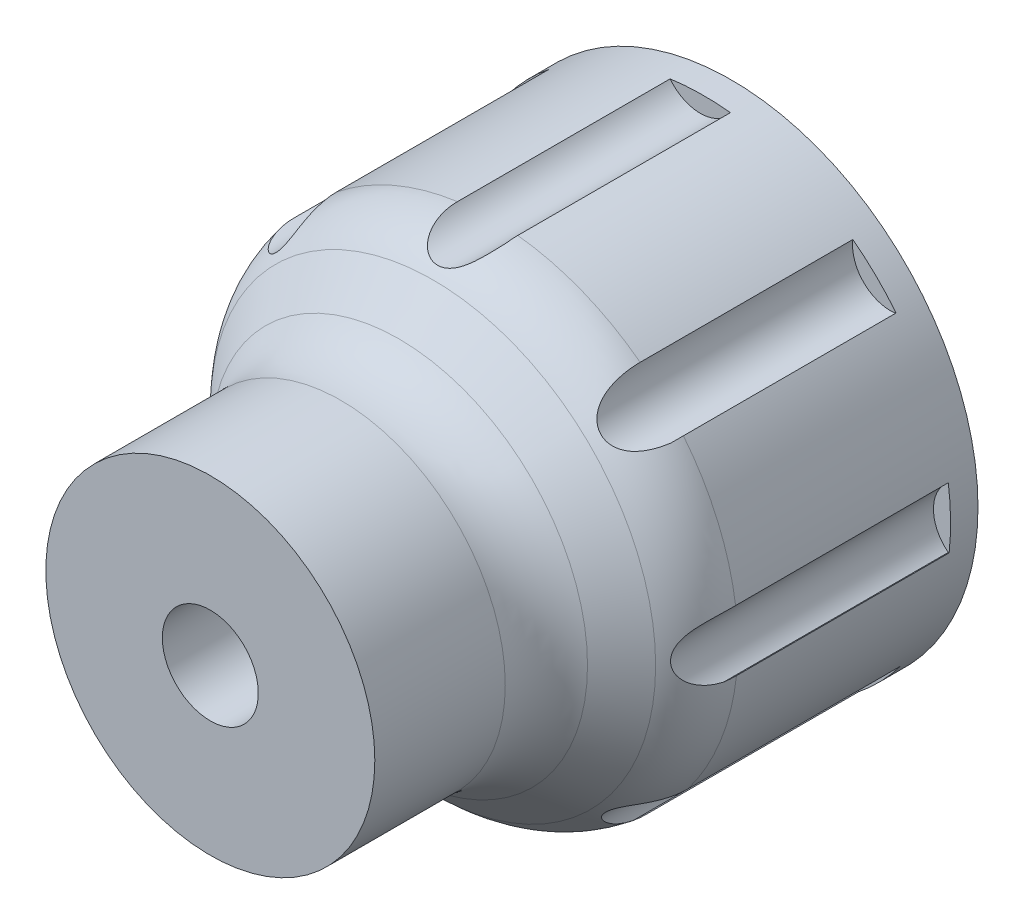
ISO-10303-21;
HEADER;
FILE_DESCRIPTION(('STEP AP214'),'2;1');
FILE_NAME('part.step','',(''),(''),'','','');
FILE_SCHEMA(('AUTOMOTIVE_DESIGN { 1 0 10303 214 1 1 1 1 }'));
ENDSEC;
DATA;
#1=APPLICATION_CONTEXT('core data for automotive mechanical design processes');
#2=APPLICATION_PROTOCOL_DEFINITION('international standard','automotive_design',2000,#1);
#3=PRODUCT_CONTEXT('',#1,'mechanical');
#4=PRODUCT('Part','Part','',(#3));
#5=PRODUCT_RELATED_PRODUCT_CATEGORY('part','',(#4));
#6=PRODUCT_DEFINITION_FORMATION('','',#4);
#7=PRODUCT_DEFINITION_CONTEXT('part definition',#1,'design');
#8=PRODUCT_DEFINITION('design','',#6,#7);
#9=PRODUCT_DEFINITION_SHAPE('','',#8);
#10=(LENGTH_UNIT() NAMED_UNIT(*) SI_UNIT(.MILLI.,.METRE.));
#11=(NAMED_UNIT(*) PLANE_ANGLE_UNIT() SI_UNIT($,.RADIAN.));
#12=(NAMED_UNIT(*) SI_UNIT($,.STERADIAN.) SOLID_ANGLE_UNIT());
#13=UNCERTAINTY_MEASURE_WITH_UNIT(LENGTH_MEASURE(1.E-05),#10,'distance_accuracy_value','');
#14=(GEOMETRIC_REPRESENTATION_CONTEXT(3) GLOBAL_UNCERTAINTY_ASSIGNED_CONTEXT((#13)) GLOBAL_UNIT_ASSIGNED_CONTEXT((#10,
#11,#12)) REPRESENTATION_CONTEXT('',''));
#15=CARTESIAN_POINT('',(0.,0.,0.));
#16=DIRECTION('',(0.,0.,1.));
#17=DIRECTION('',(1.,0.,0.));
#18=AXIS2_PLACEMENT_3D('',#15,#16,#17);
#19=CARTESIAN_POINT('',(0.,0.,8.75735931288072));
#20=DIRECTION('',(0.,0.,-1.));
#21=DIRECTION('',(-1.,0.,0.));
#22=AXIS2_PLACEMENT_3D('',#19,#20,#21);
#23=TOROIDAL_SURFACE('',#22,6.,3.);
#24=CARTESIAN_POINT('',(0.,0.,10.8786796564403));
#25=DIRECTION('',(0.,0.,1.));
#26=DIRECTION('',(1.,0.,0.));
#27=AXIS2_PLACEMENT_3D('',#24,#25,#26);
#28=CIRCLE('',#27,8.12132034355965);
#29=CARTESIAN_POINT('',(8.12132034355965,0.,10.8786796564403));
#30=VERTEX_POINT('',#29);
#31=EDGE_CURVE('E860',#30,#30,#28,.T.);
#32=ORIENTED_EDGE('',*,*,#31,.F.);
#33=EDGE_LOOP('',(#32));
#34=FACE_BOUND('',#33,.T.);
#35=CARTESIAN_POINT('',(-5.62892454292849,7.00115120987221,8.44190355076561));
#36=CARTESIAN_POINT('',(-5.63285938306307,7.00508605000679,8.49425118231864));
#37=CARTESIAN_POINT('',(-5.63581590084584,7.00804256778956,8.54672304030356));
#38=CARTESIAN_POINT('',(-5.63976335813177,7.01199002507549,8.65184185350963));
#39=CARTESIAN_POINT('',(-5.64075326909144,7.01297993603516,8.70448888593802));
#40=CARTESIAN_POINT('',(-5.64075548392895,7.01298215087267,8.90324198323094));
#41=CARTESIAN_POINT('',(-5.63314680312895,7.00537347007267,9.04950461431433));
#42=CARTESIAN_POINT('',(-5.60932559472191,6.98155226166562,9.27722831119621));
#43=CARTESIAN_POINT('',(-5.59813667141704,6.97036333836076,9.35984034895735));
#44=CARTESIAN_POINT('',(-5.53016676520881,6.90239343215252,9.76766031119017));
#45=CARTESIAN_POINT('',(-5.43698837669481,6.80921504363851,10.0809361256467));
#46=CARTESIAN_POINT('',(-5.30759434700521,6.67982101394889,10.3667998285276));
#47=B_SPLINE_CURVE_WITH_KNOTS('',3,(#35,#36,#37,#38,#39,#40,#41,#42,#43,#44,#45,#46),
.UNSPECIFIED.,.F.,.F.,(4,2,2,2,2,4),(0.,0.157863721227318,0.315809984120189,0.753877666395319,
1.00598023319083,2.01059788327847),.UNSPECIFIED.);
#48=CARTESIAN_POINT('',(-5.64075386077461,7.01298052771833,8.75735931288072));
#49=VERTEX_POINT('',#48);
#50=CARTESIAN_POINT('',(-5.618226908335,6.99045357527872,9.19213091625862));
#51=VERTEX_POINT('',#50);
#52=EDGE_CURVE('E394',#49,#51,#47,.T.);
#53=ORIENTED_EDGE('',*,*,#52,.T.);
#54=CARTESIAN_POINT('',(-5.61825285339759,6.99065357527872,9.19095399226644));
#55=CARTESIAN_POINT('',(-5.61700776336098,6.98088857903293,9.24845601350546));
#56=CARTESIAN_POINT('',(-5.61556566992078,6.96912881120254,9.3056318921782));
#57=CARTESIAN_POINT('',(-5.61267924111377,6.94143908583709,9.41907635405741));
#58=CARTESIAN_POINT('',(-5.61123490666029,6.92550128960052,9.47534301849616));
#59=CARTESIAN_POINT('',(-5.60872925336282,6.88910432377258,9.58712744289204));
#60=CARTESIAN_POINT('',(-5.6076724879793,6.86859568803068,9.64262935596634));
#61=CARTESIAN_POINT('',(-5.60656108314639,6.82300570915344,9.7516815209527));
#62=CARTESIAN_POINT('',(-5.60650555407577,6.79792844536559,9.80523346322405));
#63=CARTESIAN_POINT('',(-5.60837842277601,6.73513633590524,9.9248750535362));
#64=CARTESIAN_POINT('',(-5.61088056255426,6.69585990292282,9.99015397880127));
#65=CARTESIAN_POINT('',(-5.6208708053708,6.6094452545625,10.1146424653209));
#66=CARTESIAN_POINT('',(-5.62833953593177,6.56233811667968,10.1738745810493));
#67=CARTESIAN_POINT('',(-5.64837970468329,6.47194153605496,10.2719630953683));
#68=CARTESIAN_POINT('',(-5.65946759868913,6.43009110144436,10.312435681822));
#69=CARTESIAN_POINT('',(-5.68761417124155,6.34271524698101,10.3868860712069));
#70=CARTESIAN_POINT('',(-5.70466713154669,6.29719337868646,10.4208700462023));
#71=CARTESIAN_POINT('',(-5.74194773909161,6.21287506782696,10.4749772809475));
#72=CARTESIAN_POINT('',(-5.7609547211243,6.17444617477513,10.4965074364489));
#73=CARTESIAN_POINT('',(-5.80394419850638,6.0973546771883,10.5333316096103));
#74=CARTESIAN_POINT('',(-5.82792441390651,6.05869218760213,10.5486284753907));
#75=CARTESIAN_POINT('',(-5.88089951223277,5.98234053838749,10.5723117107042));
#76=CARTESIAN_POINT('',(-5.90992096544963,5.94465781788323,10.5806600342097));
#77=CARTESIAN_POINT('',(-5.97222820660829,5.8719969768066,10.5898452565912));
#78=CARTESIAN_POINT('',(-6.00551253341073,5.83701793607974,10.590684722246));
#79=CARTESIAN_POINT('',(-6.0719594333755,5.77408368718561,10.5850887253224));
#80=CARTESIAN_POINT('',(-6.10484973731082,5.74577818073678,10.5793175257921));
#81=CARTESIAN_POINT('',(-6.17210958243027,5.69305298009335,10.5618286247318));
#82=CARTESIAN_POINT('',(-6.20647905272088,5.66863309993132,10.5501112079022));
#83=CARTESIAN_POINT('',(-6.27622611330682,5.62352319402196,10.520955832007));
#84=CARTESIAN_POINT('',(-6.31161060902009,5.60291020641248,10.5034164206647));
#85=CARTESIAN_POINT('',(-6.38172743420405,5.56587984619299,10.4633583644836));
#86=CARTESIAN_POINT('',(-6.41645945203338,5.54946443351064,10.4408374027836));
#87=CARTESIAN_POINT('',(-6.49933045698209,5.51413089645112,10.3807314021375));
#88=CARTESIAN_POINT('',(-6.54669061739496,5.49725736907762,10.3408655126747));
#89=CARTESIAN_POINT('',(-6.63680480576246,5.46989802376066,10.2543313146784));
#90=CARTESIAN_POINT('',(-6.67954926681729,5.45942527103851,10.2076493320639));
#91=CARTESIAN_POINT('',(-6.77698487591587,5.43970097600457,10.0878892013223));
#92=CARTESIAN_POINT('',(-6.82885537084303,5.43293330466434,10.0121223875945));
#93=CARTESIAN_POINT('',(-6.92120903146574,5.42492280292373,9.8536434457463));
#94=CARTESIAN_POINT('',(-6.96166376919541,5.42369365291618,9.77091463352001));
#95=CARTESIAN_POINT('',(-7.02161336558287,5.42377673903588,9.62522350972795));
#96=CARTESIAN_POINT('',(-7.04379665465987,5.42446522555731,9.56333687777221));
#97=CARTESIAN_POINT('',(-7.0827798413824,5.42638542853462,9.43786527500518));
#98=CARTESIAN_POINT('',(-7.09957692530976,5.4276174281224,9.37427943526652));
#99=CARTESIAN_POINT('',(-7.12795866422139,5.43005715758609,9.24603436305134));
#100=CARTESIAN_POINT('',(-7.13954855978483,5.43126491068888,9.18137627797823));
#101=CARTESIAN_POINT('',(-7.15769133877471,5.43328561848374,9.0513846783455));
#102=CARTESIAN_POINT('',(-7.16424715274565,5.43409880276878,8.98605157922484));
#103=CARTESIAN_POINT('',(-7.17003313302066,5.43482847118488,8.89335075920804));
#104=CARTESIAN_POINT('',(-7.17130552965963,5.43499127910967,8.86609906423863));
#105=CARTESIAN_POINT('',(-7.17299743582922,5.43520910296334,8.81161886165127));
#106=CARTESIAN_POINT('',(-7.17341850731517,5.43526431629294,8.78439040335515));
#107=CARTESIAN_POINT('',(-7.17341682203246,5.43526365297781,8.75715931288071));
#108=B_SPLINE_CURVE_WITH_KNOTS('',3,(#54,#55,#56,#57,#58,#59,#60,#61,#62,#63,#64,#65,#66,#67,
#68,#69,#70,#71,#72,#73,#74,#75,#76,#77,#78,#79,#80,#81,#82,#83,#84,#85,#86,#87,#88,#89,#90,#91,
#92,#93,#94,#95,#96,#97,#98,#99,#100,#101,#102,#103,#104,#105,#106,#107),.UNSPECIFIED.,.F.,.F.,
(4,2,2,2,2,2,2,2,2,2,2,2,2,2,2,2,2,2,2,2,2,2,2,2,2,2,4),(0.,0.17500510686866,0.350340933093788,
0.527675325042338,0.7048521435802,0.932859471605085,1.15998261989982,1.33715324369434,
1.51415449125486,1.6574913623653,1.80076266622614,1.94481337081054,2.08881483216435,
2.21952619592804,2.35023130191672,2.48334536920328,2.61652147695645,2.80793428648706,
2.99973651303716,3.27443168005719,3.54980498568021,3.74680274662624,3.94390325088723,
4.14080494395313,4.33759192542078,4.41942677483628,4.50111134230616),.UNSPECIFIED.);
#109=CARTESIAN_POINT('',(-7.17341682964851,5.43526365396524,8.75735931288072));
#110=VERTEX_POINT('',#109);
#111=EDGE_CURVE('E391',#51,#110,#108,.T.);
#112=ORIENTED_EDGE('',*,*,#111,.T.);
#113=CARTESIAN_POINT('',(0.,0.,8.75735931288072));
#114=DIRECTION('',(0.,0.,-1.));
#115=DIRECTION('',(-1.,0.,0.));
#116=AXIS2_PLACEMENT_3D('',#113,#114,#115);
#117=CIRCLE('',#116,9.);
#118=CARTESIAN_POINT('',(-8.94754139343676,0.970310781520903,8.75735931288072));
#119=VERTEX_POINT('',#118);
#120=EDGE_CURVE('E929',#119,#110,#117,.T.);
#121=ORIENTED_EDGE('',*,*,#120,.F.);
#122=CARTESIAN_POINT('',(-8.93590358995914,0.970310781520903,9.0205805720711));
#123=CARTESIAN_POINT('',(-8.92108599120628,0.970310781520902,9.18773989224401));
#124=CARTESIAN_POINT('',(-8.89211715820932,0.970310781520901,9.35376995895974));
#125=CARTESIAN_POINT('',(-8.8066615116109,0.970310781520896,9.67873839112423));
#126=CARTESIAN_POINT('',(-8.75014098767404,0.970310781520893,9.83766780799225));
#127=CARTESIAN_POINT('',(-8.61125520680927,0.970310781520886,10.1437010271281));
#128=CARTESIAN_POINT('',(-8.52890555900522,0.970310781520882,10.2908119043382));
#129=CARTESIAN_POINT('',(-8.3407580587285,0.970310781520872,10.5691211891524));
#130=CARTESIAN_POINT('',(-8.23496602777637,0.970310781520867,10.7003235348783));
#131=CARTESIAN_POINT('',(-8.00265893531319,0.970310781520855,10.9435389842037));
#132=CARTESIAN_POINT('',(-7.87609041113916,0.970310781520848,11.0555010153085));
#133=CARTESIAN_POINT('',(-7.60605033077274,0.970310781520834,11.2567475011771));
#134=CARTESIAN_POINT('',(-7.46257772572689,0.970310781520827,11.3460305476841));
#135=CARTESIAN_POINT('',(-7.16184692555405,0.970310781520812,11.5000183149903));
#136=CARTESIAN_POINT('',(-7.00450683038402,0.970310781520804,11.5645630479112));
#137=CARTESIAN_POINT('',(-6.68129249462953,0.970310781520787,11.666601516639));
#138=CARTESIAN_POINT('',(-6.51541792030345,0.970310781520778,11.70409419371));
#139=CARTESIAN_POINT('',(-6.17811855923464,0.970310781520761,11.7513888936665));
#140=CARTESIAN_POINT('',(-6.00665540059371,0.970310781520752,11.7609170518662));
#141=CARTESIAN_POINT('',(-5.66452471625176,0.970310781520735,11.7514327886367));
#142=CARTESIAN_POINT('',(-5.49385724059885,0.970310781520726,11.7324185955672));
#143=CARTESIAN_POINT('',(-5.15584301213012,0.970310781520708,11.6661374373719));
#144=CARTESIAN_POINT('',(-4.98856618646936,0.9703107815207,11.6185139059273));
#145=CARTESIAN_POINT('',(-4.66421575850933,0.970310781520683,11.4962006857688));
#146=CARTESIAN_POINT('',(-4.50714305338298,0.970310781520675,11.4215086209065));
#147=CARTESIAN_POINT('',(-4.20568895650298,0.97031078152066,11.2461302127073));
#148=CARTESIAN_POINT('',(-4.06148377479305,0.970310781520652,11.1451407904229));
#149=CARTESIAN_POINT('',(-3.79203681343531,0.970310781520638,10.9203822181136));
#150=CARTESIAN_POINT('',(-3.66679718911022,0.970310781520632,10.7966104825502));
#151=CARTESIAN_POINT('',(-3.43915570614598,0.97031078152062,10.529629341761));
#152=CARTESIAN_POINT('',(-3.33674687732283,0.970310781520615,10.3864258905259));
#153=CARTESIAN_POINT('',(-3.15829893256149,0.970310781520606,10.08441985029));
#154=CARTESIAN_POINT('',(-3.08225399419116,0.970310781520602,9.92562071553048));
#155=CARTESIAN_POINT('',(-2.96158347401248,0.970310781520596,9.60209243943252));
#156=CARTESIAN_POINT('',(-2.91605495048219,0.970310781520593,9.43770092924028));
#157=CARTESIAN_POINT('',(-2.8548420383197,0.97031078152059,9.10347574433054));
#158=CARTESIAN_POINT('',(-2.83914478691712,0.970310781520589,8.93364444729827));
#159=CARTESIAN_POINT('',(-2.83838695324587,0.970310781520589,8.60215230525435));
#160=CARTESIAN_POINT('',(-2.85188351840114,0.97031078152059,8.44049294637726));
#161=CARTESIAN_POINT('',(-2.90595643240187,0.970310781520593,8.12177778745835));
#162=CARTESIAN_POINT('',(-2.94653425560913,0.970310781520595,7.96472223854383));
#163=CARTESIAN_POINT('',(-3.05284489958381,0.9703107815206,7.66002908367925));
#164=CARTESIAN_POINT('',(-3.1184895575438,0.970310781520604,7.51236056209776));
#165=CARTESIAN_POINT('',(-3.27256976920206,0.970310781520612,7.22944649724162));
#166=CARTESIAN_POINT('',(-3.3610098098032,0.970310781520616,7.09420340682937));
#167=CARTESIAN_POINT('',(-3.56249045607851,0.970310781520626,6.83343554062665));
#168=CARTESIAN_POINT('',(-3.67646917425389,0.970310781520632,6.70863543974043));
#169=CARTESIAN_POINT('',(-3.9230922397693,0.970310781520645,6.47908651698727));
#170=CARTESIAN_POINT('',(-4.05573985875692,0.970310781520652,6.37434121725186));
#171=CARTESIAN_POINT('',(-4.34129999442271,0.970310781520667,6.18410769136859));
#172=CARTESIAN_POINT('',(-4.49477648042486,0.970310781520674,6.09946449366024));
#173=CARTESIAN_POINT('',(-4.8137029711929,0.970310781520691,5.95695660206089));
#174=CARTESIAN_POINT('',(-4.97915363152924,0.970310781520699,5.89909337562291));
#175=CARTESIAN_POINT('',(-5.31846353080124,0.970310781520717,5.81164422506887));
#176=CARTESIAN_POINT('',(-5.49236805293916,0.970310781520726,5.78223361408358));
#177=CARTESIAN_POINT('',(-5.84265141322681,0.970310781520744,5.75335944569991));
#178=CARTESIAN_POINT('',(-6.01903015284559,0.970310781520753,5.75389469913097));
#179=CARTESIAN_POINT('',(-6.36726456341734,0.970310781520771,5.78493835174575));
#180=CARTESIAN_POINT('',(-6.53914829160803,0.97031078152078,5.81513157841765));
#181=CARTESIAN_POINT('',(-6.8752698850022,0.970310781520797,5.90434004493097));
#182=CARTESIAN_POINT('',(-7.03950825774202,0.970310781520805,5.96335336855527));
#183=CARTESIAN_POINT('',(-7.35337403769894,0.970310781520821,6.1076661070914));
#184=CARTESIAN_POINT('',(-7.50316552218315,0.970310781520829,6.19260872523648));
#185=CARTESIAN_POINT('',(-7.78614926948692,0.970310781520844,6.38668838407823));
#186=CARTESIAN_POINT('',(-7.91934317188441,0.970310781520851,6.49582303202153));
#187=CARTESIAN_POINT('',(-8.16387360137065,0.970310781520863,6.73391333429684));
#188=CARTESIAN_POINT('',(-8.27542802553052,0.970310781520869,6.86264525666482));
#189=CARTESIAN_POINT('',(-8.47518512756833,0.970310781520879,7.13716091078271));
#190=CARTESIAN_POINT('',(-8.56338283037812,0.970310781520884,7.2829482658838));
#191=CARTESIAN_POINT('',(-8.71329331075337,0.970310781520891,7.58634640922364));
#192=CARTESIAN_POINT('',(-8.77517597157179,0.970310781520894,7.74387339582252));
#193=CARTESIAN_POINT('',(-8.87142270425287,0.970310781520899,8.06697608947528));
#194=CARTESIAN_POINT('',(-8.90582116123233,0.970310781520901,8.23254146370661));
#195=CARTESIAN_POINT('',(-8.93846016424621,0.970310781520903,8.50265959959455));
#196=CARTESIAN_POINT('',(-8.94551320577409,0.970310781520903,8.60622680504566));
#197=CARTESIAN_POINT('',(-8.94881370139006,0.970310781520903,8.81353330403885));
#198=CARTESIAN_POINT('',(-8.94506117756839,0.970310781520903,8.9172725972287));
#199=CARTESIAN_POINT('',(-8.93590358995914,0.970310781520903,9.0205805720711));
#200=B_SPLINE_CURVE_WITH_KNOTS('',3,(#122,#123,#124,#125,#126,#127,#128,#129,#130,#131,#132,
#133,#134,#135,#136,#137,#138,#139,#140,#141,#142,#143,#144,#145,#146,#147,#148,#149,#150,#151,
#152,#153,#154,#155,#156,#157,#158,#159,#160,#161,#162,#163,#164,#165,#166,#167,#168,#169,#170,
#171,#172,#173,#174,#175,#176,#177,#178,#179,#180,#181,#182,#183,#184,#185,#186,#187,#188,#189,
#190,#191,#192,#193,#194,#195,#196,#197,#198,#199),.UNSPECIFIED.,.T.,.F.,(4,2,2,2,2,2,2,2,2,2,2,
2,2,2,2,2,2,2,2,2,2,2,2,2,2,2,2,2,2,2,2,2,2,2,2,2,2,2,4),(0.,0.503064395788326,1.0067458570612,
1.5101235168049,2.01337631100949,2.51794499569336,3.02254500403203,3.53035541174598,
4.03818569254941,4.55097297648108,5.0637920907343,5.58313920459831,6.10253191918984,
6.62819820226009,7.15392417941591,7.67948943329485,8.2049385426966,8.71405895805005,
9.22295979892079,9.70728559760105,10.1916377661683,10.6743018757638,11.1570610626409,
11.6618406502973,12.1667088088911,12.6900533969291,13.2134266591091,13.7400045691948,
14.26656156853,14.7875827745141,15.3085693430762,15.8226875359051,16.3367549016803,
16.8453414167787,17.354036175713,17.8593951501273,18.3641208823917,18.6750258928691,
18.985930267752),.UNSPECIFIED.);
#201=CARTESIAN_POINT('',(-8.91568347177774,0.970310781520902,9.19213091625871));
#202=VERTEX_POINT('',#201);
#203=EDGE_CURVE('E439',#119,#202,#200,.T.);
#204=ORIENTED_EDGE('',*,*,#203,.T.);
#205=CARTESIAN_POINT('',(-8.91588347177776,0.970464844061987,9.19065710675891));
#206=CARTESIAN_POINT('',(-8.90810342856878,0.964444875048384,9.24816024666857));
#207=CARTESIAN_POINT('',(-8.89877350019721,0.957153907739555,9.30533749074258));
#208=CARTESIAN_POINT('',(-8.87716305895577,0.93962543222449,9.41878520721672));
#209=CARTESIAN_POINT('',(-8.86487700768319,0.929382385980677,9.47505376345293));
#210=CARTESIAN_POINT('',(-8.83737836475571,0.905429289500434,9.58684256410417));
#211=CARTESIAN_POINT('',(-8.82213401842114,0.891681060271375,9.64234697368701));
#212=CARTESIAN_POINT('',(-8.78911996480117,0.86024364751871,9.75140509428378));
#213=CARTESIAN_POINT('',(-8.77135251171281,0.842557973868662,9.8049604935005));
#214=CARTESIAN_POINT('',(-8.72827930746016,0.796845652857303,9.92462587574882));
#215=CARTESIAN_POINT('',(-8.70227400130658,0.767307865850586,9.98992465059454));
#216=CARTESIAN_POINT('',(-8.64822695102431,0.699145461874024,10.1144526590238));
#217=CARTESIAN_POINT('',(-8.62019349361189,0.660556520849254,10.1737044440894));
#218=CARTESIAN_POINT('',(-8.57043494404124,0.582469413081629,10.2718235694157));
#219=CARTESIAN_POINT('',(-8.54867883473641,0.545038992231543,10.3123076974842));
#220=CARTESIAN_POINT('',(-8.50678861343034,0.463355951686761,10.386781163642));
#221=CARTESIAN_POINT('',(-8.48665296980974,0.419109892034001,10.4207766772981));
#222=CARTESIAN_POINT('',(-8.4533830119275,0.333128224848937,10.4749030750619));
#223=CARTESIAN_POINT('',(-8.4396454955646,0.292516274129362,10.4964412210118));
#224=CARTESIAN_POINT('',(-8.4155228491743,0.207607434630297,10.5332813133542));
#225=CARTESIAN_POINT('',(-8.40513618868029,0.163312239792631,10.5485861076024));
#226=CARTESIAN_POINT('',(-8.38859684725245,0.0718623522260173,10.5722848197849));
#227=CARTESIAN_POINT('',(-8.38246752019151,0.0246934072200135,10.5806406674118));
#228=CARTESIAN_POINT('',(-8.37513711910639,-0.0707490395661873,10.5898399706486));
#229=CARTESIAN_POINT('',(-8.37393435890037,-0.119022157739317,10.5906859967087));
#230=CARTESIAN_POINT('',(-8.37641059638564,-0.210514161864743,10.5851013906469));
#231=CARTESIAN_POINT('',(-8.37964905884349,-0.253788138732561,10.5793354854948));
#232=CARTESIAN_POINT('',(-8.38992024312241,-0.338635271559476,10.56185655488));
#233=CARTESIAN_POINT('',(-8.39695278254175,-0.38020850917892,10.5501438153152));
#234=CARTESIAN_POINT('',(-8.41436830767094,-0.4614286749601,10.5209979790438));
#235=CARTESIAN_POINT('',(-8.42481047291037,-0.501026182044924,10.5034637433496));
#236=CARTESIAN_POINT('',(-8.44820095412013,-0.576793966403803,10.4634157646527));
#237=CARTESIAN_POINT('',(-8.46115043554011,-0.612962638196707,10.4408997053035));
#238=CARTESIAN_POINT('',(-8.4947580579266,-0.696547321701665,10.3808080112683));
#239=CARTESIAN_POINT('',(-8.51631129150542,-0.741967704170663,10.3409520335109));
#240=CARTESIAN_POINT('',(-8.56067869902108,-0.825036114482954,10.2544378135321));
#241=CARTESIAN_POINT('',(-8.58349534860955,-0.862668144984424,10.2077659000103));
#242=CARTESIAN_POINT('',(-8.63843910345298,-0.945516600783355,10.0880323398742));
#243=CARTESIAN_POINT('',(-8.6703287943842,-0.986983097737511,10.0122822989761));
#244=CARTESIAN_POINT('',(-8.72996576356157,-1.05795885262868,9.8538367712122));
#245=CARTESIAN_POINT('',(-8.75770262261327,-1.08743834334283,9.77112460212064));
#246=CARTESIAN_POINT('',(-8.80015582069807,-1.12977972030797,9.62545864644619));
#247=CARTESIAN_POINT('',(-8.81633124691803,-1.14498322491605,9.56358054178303));
#248=CARTESIAN_POINT('',(-8.84526067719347,-1.17119945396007,9.43812556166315));
#249=CARTESIAN_POINT('',(-8.85801289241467,-1.18220998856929,9.37454781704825));
#250=CARTESIAN_POINT('',(-8.87981544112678,-1.20056254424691,9.24631831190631));
#251=CARTESIAN_POINT('',(-8.88886948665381,-1.20790824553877,9.18166769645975));
#252=CARTESIAN_POINT('',(-8.90313760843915,-1.21931727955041,9.0516905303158));
#253=CARTESIAN_POINT('',(-8.90835391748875,-1.22338252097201,8.98636439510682));
#254=CARTESIAN_POINT('',(-8.91297252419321,-1.22696679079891,8.89361709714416));
#255=CARTESIAN_POINT('',(-8.91399134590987,-1.22775447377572,8.86631211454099));
#256=CARTESIAN_POINT('',(-8.91534702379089,-1.22880089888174,8.81172537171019));
#257=CARTESIAN_POINT('',(-8.91568513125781,-1.22906061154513,8.78444366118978));
#258=CARTESIAN_POINT('',(-8.91568346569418,-1.22905989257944,8.75715931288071));
#259=B_SPLINE_CURVE_WITH_KNOTS('',3,(#205,#206,#207,#208,#209,#210,#211,#212,#213,#214,#215,
#216,#217,#218,#219,#220,#221,#222,#223,#224,#225,#226,#227,#228,#229,#230,#231,#232,#233,#234,
#235,#236,#237,#238,#239,#240,#241,#242,#243,#244,#245,#246,#247,#248,#249,#250,#251,#252,#253,
#254,#255,#256,#257,#258),.UNSPECIFIED.,.F.,.F.,(4,2,2,2,2,2,2,2,2,2,2,2,2,2,2,2,2,2,2,2,2,2,2,
2,2,2,4),(0.,0.17500489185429,0.350340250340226,0.52767369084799,0.704849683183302,
0.932905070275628,1.1600762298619,1.33726958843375,1.51429345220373,1.65764122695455,
1.80092343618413,1.94498555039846,2.0889983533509,2.21971272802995,2.35042081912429,
2.48353022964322,2.61670166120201,2.80809268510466,2.99987300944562,3.27452817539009,
3.54986128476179,3.74683996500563,3.94392137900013,4.14080448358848,4.33757295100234,
4.41956812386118,4.5014124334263),.UNSPECIFIED.);
#260=CARTESIAN_POINT('',(-8.91568347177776,-1.22905989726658,8.75735931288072));
#261=VERTEX_POINT('',#260);
#262=EDGE_CURVE('E446',#202,#261,#259,.T.);
#263=ORIENTED_EDGE('',*,*,#262,.T.);
#264=CARTESIAN_POINT('',(-7.01298052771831,-5.64075386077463,8.75735931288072));
#265=VERTEX_POINT('',#264);
#266=EDGE_CURVE('E868',#265,#261,#117,.T.);
#267=ORIENTED_EDGE('',*,*,#266,.F.);
#268=CARTESIAN_POINT('',(-7.00115120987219,-5.62892454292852,8.44190355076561));
#269=CARTESIAN_POINT('',(-7.00508605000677,-5.63285938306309,8.49425118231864));
#270=CARTESIAN_POINT('',(-7.00804256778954,-5.63581590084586,8.54672304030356));
#271=CARTESIAN_POINT('',(-7.01199002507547,-5.63976335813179,8.65184185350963));
#272=CARTESIAN_POINT('',(-7.01297993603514,-5.64075326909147,8.70448888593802));
#273=CARTESIAN_POINT('',(-7.01298215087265,-5.64075548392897,8.90324198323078));
#274=CARTESIAN_POINT('',(-7.00537347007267,-5.63314680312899,9.04950461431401));
#275=CARTESIAN_POINT('',(-6.98155226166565,-5.60932559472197,9.2772283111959));
#276=CARTESIAN_POINT('',(-6.97036333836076,-5.59813667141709,9.35984034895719));
#277=CARTESIAN_POINT('',(-6.9023934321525,-5.53016676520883,9.76766031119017));
#278=CARTESIAN_POINT('',(-6.80921504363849,-5.43698837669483,10.0809361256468));
#279=CARTESIAN_POINT('',(-6.67982101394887,-5.30759434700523,10.3667998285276));
#280=B_SPLINE_CURVE_WITH_KNOTS('',3,(#268,#269,#270,#271,#272,#273,#274,#275,#276,#277,#278,
#279),.UNSPECIFIED.,.F.,.F.,(4,2,2,2,2,4),(0.,0.157863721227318,0.315809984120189,
0.753877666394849,1.00598023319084,2.01059788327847),.UNSPECIFIED.);
#281=CARTESIAN_POINT('',(-6.9904535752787,-5.61822690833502,9.19213091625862));
#282=VERTEX_POINT('',#281);
#283=EDGE_CURVE('E462',#265,#282,#280,.T.);
#284=ORIENTED_EDGE('',*,*,#283,.T.);
#285=CARTESIAN_POINT('',(-6.9906535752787,-5.61825285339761,9.19095399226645));
#286=CARTESIAN_POINT('',(-6.98088857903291,-5.617007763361,9.24845601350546));
#287=CARTESIAN_POINT('',(-6.96912881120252,-5.6155656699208,9.3056318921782));
#288=CARTESIAN_POINT('',(-6.94143908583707,-5.6126792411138,9.41907635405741));
#289=CARTESIAN_POINT('',(-6.9255012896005,-5.61123490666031,9.47534301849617));
#290=CARTESIAN_POINT('',(-6.88910432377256,-5.60872925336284,9.58712744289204));
#291=CARTESIAN_POINT('',(-6.86859568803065,-5.60767248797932,9.64262935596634));
#292=CARTESIAN_POINT('',(-6.82300570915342,-5.60656108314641,9.75168152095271));
#293=CARTESIAN_POINT('',(-6.79792844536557,-5.6065055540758,9.80523346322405));
#294=CARTESIAN_POINT('',(-6.73513633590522,-5.60837842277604,9.9248750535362));
#295=CARTESIAN_POINT('',(-6.6958599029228,-5.61088056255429,9.99015397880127));
#296=CARTESIAN_POINT('',(-6.60944525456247,-5.62087080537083,10.1146424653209));
#297=CARTESIAN_POINT('',(-6.56233811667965,-5.6283395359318,10.1738745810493));
#298=CARTESIAN_POINT('',(-6.47194153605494,-5.64837970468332,10.2719630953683));
#299=CARTESIAN_POINT('',(-6.43009110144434,-5.65946759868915,10.312435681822));
#300=CARTESIAN_POINT('',(-6.34271524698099,-5.68761417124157,10.3868860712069));
#301=CARTESIAN_POINT('',(-6.29719337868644,-5.70466713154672,10.4208700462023));
#302=CARTESIAN_POINT('',(-6.21287506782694,-5.74194773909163,10.4749772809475));
#303=CARTESIAN_POINT('',(-6.17444617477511,-5.76095472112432,10.4965074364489));
#304=CARTESIAN_POINT('',(-6.09735467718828,-5.8039441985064,10.5333316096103));
#305=CARTESIAN_POINT('',(-6.05869218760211,-5.82792441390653,10.5486284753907));
#306=CARTESIAN_POINT('',(-5.98234053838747,-5.88089951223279,10.5723117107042));
#307=CARTESIAN_POINT('',(-5.94465781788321,-5.90992096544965,10.5806600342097));
#308=CARTESIAN_POINT('',(-5.87199697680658,-5.97222820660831,10.5898452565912));
#309=CARTESIAN_POINT('',(-5.83701793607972,-6.00551253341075,10.590684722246));
#310=CARTESIAN_POINT('',(-5.77408368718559,-6.07195943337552,10.5850887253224));
#311=CARTESIAN_POINT('',(-5.74577818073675,-6.10484973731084,10.5793175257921));
#312=CARTESIAN_POINT('',(-5.69305298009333,-6.17210958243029,10.5618286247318));
#313=CARTESIAN_POINT('',(-5.6686330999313,-6.2064790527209,10.5501112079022));
#314=CARTESIAN_POINT('',(-5.62352319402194,-6.27622611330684,10.520955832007));
#315=CARTESIAN_POINT('',(-5.60291020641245,-6.31161060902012,10.5034164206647));
#316=CARTESIAN_POINT('',(-5.56587984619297,-6.38172743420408,10.4633583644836));
#317=CARTESIAN_POINT('',(-5.54946443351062,-6.4164594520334,10.4408374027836));
#318=CARTESIAN_POINT('',(-5.5141308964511,-6.4993304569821,10.3807314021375));
#319=CARTESIAN_POINT('',(-5.4972573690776,-6.54669061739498,10.3408655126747));
#320=CARTESIAN_POINT('',(-5.46989802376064,-6.63680480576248,10.2543313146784));
#321=CARTESIAN_POINT('',(-5.45942527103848,-6.67954926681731,10.2076493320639));
#322=CARTESIAN_POINT('',(-5.43970097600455,-6.7769848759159,10.0878892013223));
#323=CARTESIAN_POINT('',(-5.43293330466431,-6.82885537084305,10.0121223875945));
#324=CARTESIAN_POINT('',(-5.4249228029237,-6.92120903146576,9.8536434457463));
#325=CARTESIAN_POINT('',(-5.42369365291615,-6.96166376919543,9.77091463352));
#326=CARTESIAN_POINT('',(-5.42377673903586,-7.02161336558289,9.62522350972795));
#327=CARTESIAN_POINT('',(-5.42446522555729,-7.04379665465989,9.5633368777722));
#328=CARTESIAN_POINT('',(-5.4263854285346,-7.08277984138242,9.43786527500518));
#329=CARTESIAN_POINT('',(-5.42761742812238,-7.09957692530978,9.37427943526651));
#330=CARTESIAN_POINT('',(-5.43005715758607,-7.12795866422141,9.24603436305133));
#331=CARTESIAN_POINT('',(-5.43126491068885,-7.13954855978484,9.18137627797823));
#332=CARTESIAN_POINT('',(-5.43328561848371,-7.15769133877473,9.0513846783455));
#333=CARTESIAN_POINT('',(-5.43409880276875,-7.16424715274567,8.98605157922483));
#334=CARTESIAN_POINT('',(-5.43482847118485,-7.17003313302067,8.89335075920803));
#335=CARTESIAN_POINT('',(-5.43499127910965,-7.17130552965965,8.86609906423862));
#336=CARTESIAN_POINT('',(-5.43520910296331,-7.17299743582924,8.81161886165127));
#337=CARTESIAN_POINT('',(-5.43526431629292,-7.17341850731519,8.78439040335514));
#338=CARTESIAN_POINT('',(-5.43526365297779,-7.17341682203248,8.75715931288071));
#339=B_SPLINE_CURVE_WITH_KNOTS('',3,(#285,#286,#287,#288,#289,#290,#291,#292,#293,#294,#295,
#296,#297,#298,#299,#300,#301,#302,#303,#304,#305,#306,#307,#308,#309,#310,#311,#312,#313,#314,
#315,#316,#317,#318,#319,#320,#321,#322,#323,#324,#325,#326,#327,#328,#329,#330,#331,#332,#333,
#334,#335,#336,#337,#338),.UNSPECIFIED.,.F.,.F.,(4,2,2,2,2,2,2,2,2,2,2,2,2,2,2,2,2,2,2,2,2,2,2,
2,2,2,4),(0.,0.17500510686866,0.350340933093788,0.527675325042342,0.7048521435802,
0.932859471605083,1.15998261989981,1.33715324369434,1.51415449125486,1.6574913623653,
1.80076266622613,1.94481337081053,2.08881483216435,2.21952619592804,2.35023130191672,
2.48334536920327,2.61652147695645,2.80793428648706,2.99973651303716,3.27443168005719,
3.5498049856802,3.74680274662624,3.94390325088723,4.14080494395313,4.33759192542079,
4.41942677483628,4.50111134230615),.UNSPECIFIED.);
#340=CARTESIAN_POINT('',(-5.43526365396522,-7.17341682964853,8.75735931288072));
#341=VERTEX_POINT('',#340);
#342=EDGE_CURVE('E470',#282,#341,#339,.T.);
#343=ORIENTED_EDGE('',*,*,#342,.T.);
#344=CARTESIAN_POINT('',(-0.970310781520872,-8.94754139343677,8.75735931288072));
#345=VERTEX_POINT('',#344);
#346=EDGE_CURVE('E864',#345,#341,#117,.T.);
#347=ORIENTED_EDGE('',*,*,#346,.F.);
#348=CARTESIAN_POINT('',(-0.970310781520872,-8.93590358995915,9.0205805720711));
#349=CARTESIAN_POINT('',(-0.970310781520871,-8.92108599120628,9.18773989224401));
#350=CARTESIAN_POINT('',(-0.97031078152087,-8.89211715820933,9.35376995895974));
#351=CARTESIAN_POINT('',(-0.970310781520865,-8.8066615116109,9.67873839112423));
#352=CARTESIAN_POINT('',(-0.970310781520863,-8.75014098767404,9.83766780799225));
#353=CARTESIAN_POINT('',(-0.970310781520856,-8.61125520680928,10.1437010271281));
#354=CARTESIAN_POINT('',(-0.970310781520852,-8.52890555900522,10.2908119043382));
#355=CARTESIAN_POINT('',(-0.970310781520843,-8.3407580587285,10.5691211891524));
#356=CARTESIAN_POINT('',(-0.970310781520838,-8.23496602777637,10.7003235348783));
#357=CARTESIAN_POINT('',(-0.970310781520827,-8.0026589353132,10.9435389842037));
#358=CARTESIAN_POINT('',(-0.970310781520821,-7.87609041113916,11.0555010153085));
#359=CARTESIAN_POINT('',(-0.970310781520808,-7.60605033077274,11.2567475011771));
#360=CARTESIAN_POINT('',(-0.970310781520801,-7.46257772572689,11.3460305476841));
#361=CARTESIAN_POINT('',(-0.970310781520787,-7.16184692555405,11.5000183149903));
#362=CARTESIAN_POINT('',(-0.970310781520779,-7.00450683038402,11.5645630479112));
#363=CARTESIAN_POINT('',(-0.970310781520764,-6.68129249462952,11.666601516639));
#364=CARTESIAN_POINT('',(-0.970310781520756,-6.51541792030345,11.70409419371));
#365=CARTESIAN_POINT('',(-0.970310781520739,-6.17811855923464,11.7513888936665));
#366=CARTESIAN_POINT('',(-0.970310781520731,-6.00665540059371,11.7609170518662));
#367=CARTESIAN_POINT('',(-0.970310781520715,-5.66452471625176,11.7514327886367));
#368=CARTESIAN_POINT('',(-0.970310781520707,-5.49385724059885,11.7324185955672));
#369=CARTESIAN_POINT('',(-0.97031078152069,-5.15584301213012,11.6661374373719));
#370=CARTESIAN_POINT('',(-0.970310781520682,-4.98856618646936,11.6185139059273));
#371=CARTESIAN_POINT('',(-0.970310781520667,-4.66421575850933,11.4962006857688));
#372=CARTESIAN_POINT('',(-0.970310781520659,-4.50714305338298,11.4215086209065));
#373=CARTESIAN_POINT('',(-0.970310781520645,-4.20568895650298,11.2461302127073));
#374=CARTESIAN_POINT('',(-0.970310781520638,-4.06148377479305,11.1451407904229));
#375=CARTESIAN_POINT('',(-0.970310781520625,-3.79203681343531,10.9203822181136));
#376=CARTESIAN_POINT('',(-0.970310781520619,-3.66679718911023,10.7966104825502));
#377=CARTESIAN_POINT('',(-0.970310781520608,-3.43915570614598,10.529629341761));
#378=CARTESIAN_POINT('',(-0.970310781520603,-3.33674687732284,10.3864258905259));
#379=CARTESIAN_POINT('',(-0.970310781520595,-3.15829893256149,10.0844198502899));
#380=CARTESIAN_POINT('',(-0.970310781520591,-3.08225399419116,9.92562071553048));
#381=CARTESIAN_POINT('',(-0.970310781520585,-2.96158347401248,9.60209243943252));
#382=CARTESIAN_POINT('',(-0.970310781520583,-2.91605495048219,9.43770092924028));
#383=CARTESIAN_POINT('',(-0.97031078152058,-2.8548420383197,9.10347574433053));
#384=CARTESIAN_POINT('',(-0.970310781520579,-2.83914478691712,8.93364444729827));
#385=CARTESIAN_POINT('',(-0.970310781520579,-2.83838695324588,8.60215230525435));
#386=CARTESIAN_POINT('',(-0.97031078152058,-2.85188351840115,8.44049294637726));
#387=CARTESIAN_POINT('',(-0.970310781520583,-2.90595643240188,8.12177778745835));
#388=CARTESIAN_POINT('',(-0.970310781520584,-2.94653425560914,7.96472223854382));
#389=CARTESIAN_POINT('',(-0.97031078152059,-3.05284489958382,7.66002908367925));
#390=CARTESIAN_POINT('',(-0.970310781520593,-3.1184895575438,7.51236056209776));
#391=CARTESIAN_POINT('',(-0.9703107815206,-3.27256976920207,7.22944649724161));
#392=CARTESIAN_POINT('',(-0.970310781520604,-3.3610098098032,7.09420340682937));
#393=CARTESIAN_POINT('',(-0.970310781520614,-3.56249045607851,6.83343554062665));
#394=CARTESIAN_POINT('',(-0.97031078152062,-3.6764691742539,6.70863543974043));
#395=CARTESIAN_POINT('',(-0.970310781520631,-3.92309223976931,6.47908651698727));
#396=CARTESIAN_POINT('',(-0.970310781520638,-4.05573985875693,6.37434121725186));
#397=CARTESIAN_POINT('',(-0.970310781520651,-4.34129999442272,6.18410769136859));
#398=CARTESIAN_POINT('',(-0.970310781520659,-4.49477648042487,6.09946449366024));
#399=CARTESIAN_POINT('',(-0.970310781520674,-4.8137029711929,5.95695660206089));
#400=CARTESIAN_POINT('',(-0.970310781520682,-4.97915363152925,5.89909337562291));
#401=CARTESIAN_POINT('',(-0.970310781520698,-5.31846353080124,5.81164422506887));
#402=CARTESIAN_POINT('',(-0.970310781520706,-5.49236805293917,5.78223361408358));
#403=CARTESIAN_POINT('',(-0.970310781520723,-5.84265141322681,5.75335944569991));
#404=CARTESIAN_POINT('',(-0.970310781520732,-6.0190301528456,5.75389469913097));
#405=CARTESIAN_POINT('',(-0.970310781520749,-6.36726456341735,5.78493835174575));
#406=CARTESIAN_POINT('',(-0.970310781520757,-6.53914829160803,5.81513157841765));
#407=CARTESIAN_POINT('',(-0.970310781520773,-6.87526988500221,5.90434004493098));
#408=CARTESIAN_POINT('',(-0.970310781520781,-7.03950825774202,5.96335336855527));
#409=CARTESIAN_POINT('',(-0.970310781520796,-7.35337403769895,6.1076661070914));
#410=CARTESIAN_POINT('',(-0.970310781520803,-7.50316552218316,6.19260872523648));
#411=CARTESIAN_POINT('',(-0.970310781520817,-7.78614926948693,6.38668838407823));
#412=CARTESIAN_POINT('',(-0.970310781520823,-7.91934317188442,6.49582303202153));
#413=CARTESIAN_POINT('',(-0.970310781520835,-8.16387360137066,6.73391333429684));
#414=CARTESIAN_POINT('',(-0.97031078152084,-8.27542802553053,6.86264525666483));
#415=CARTESIAN_POINT('',(-0.970310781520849,-8.47518512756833,7.13716091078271));
#416=CARTESIAN_POINT('',(-0.970310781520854,-8.56338283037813,7.2829482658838));
#417=CARTESIAN_POINT('',(-0.970310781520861,-8.71329331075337,7.58634640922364));
#418=CARTESIAN_POINT('',(-0.970310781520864,-8.7751759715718,7.74387339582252));
#419=CARTESIAN_POINT('',(-0.970310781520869,-8.87142270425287,8.06697608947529));
#420=CARTESIAN_POINT('',(-0.97031078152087,-8.90582116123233,8.23254146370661));
#421=CARTESIAN_POINT('',(-0.970310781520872,-8.93846016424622,8.50265959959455));
#422=CARTESIAN_POINT('',(-0.970310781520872,-8.94551320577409,8.60622680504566));
#423=CARTESIAN_POINT('',(-0.970310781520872,-8.94881370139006,8.81353330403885));
#424=CARTESIAN_POINT('',(-0.970310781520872,-8.94506117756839,8.9172725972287));
#425=CARTESIAN_POINT('',(-0.970310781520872,-8.93590358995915,9.0205805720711));
#426=B_SPLINE_CURVE_WITH_KNOTS('',3,(#348,#349,#350,#351,#352,#353,#354,#355,#356,#357,#358,
#359,#360,#361,#362,#363,#364,#365,#366,#367,#368,#369,#370,#371,#372,#373,#374,#375,#376,#377,
#378,#379,#380,#381,#382,#383,#384,#385,#386,#387,#388,#389,#390,#391,#392,#393,#394,#395,#396,
#397,#398,#399,#400,#401,#402,#403,#404,#405,#406,#407,#408,#409,#410,#411,#412,#413,#414,#415,
#416,#417,#418,#419,#420,#421,#422,#423,#424,#425),.UNSPECIFIED.,.T.,.F.,(4,2,2,2,2,2,2,2,2,2,2,
2,2,2,2,2,2,2,2,2,2,2,2,2,2,2,2,2,2,2,2,2,2,2,2,2,2,2,4),(0.,0.503064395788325,1.0067458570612,
1.5101235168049,2.01337631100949,2.51794499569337,3.02254500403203,3.53035541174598,
4.03818569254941,4.55097297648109,5.06379209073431,5.58313920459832,6.10253191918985,
6.62819820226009,7.15392417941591,7.67948943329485,8.2049385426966,8.71405895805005,
9.22295979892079,9.70728559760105,10.1916377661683,10.6743018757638,11.1570610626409,
11.6618406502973,12.1667088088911,12.6900533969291,13.2134266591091,13.7400045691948,
14.26656156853,14.7875827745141,15.3085693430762,15.8226875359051,16.3367549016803,
16.8453414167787,17.354036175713,17.8593951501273,18.3641208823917,18.6750258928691,
18.985930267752),.UNSPECIFIED.);
#427=CARTESIAN_POINT('',(-0.970310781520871,-8.91568347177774,9.19213091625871));
#428=VERTEX_POINT('',#427);
#429=EDGE_CURVE('E500',#345,#428,#426,.T.);
#430=ORIENTED_EDGE('',*,*,#429,.T.);
#431=CARTESIAN_POINT('',(-0.97046484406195,-8.91588347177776,9.19065710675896));
#432=CARTESIAN_POINT('',(-0.964444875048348,-8.90810342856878,9.24816024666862));
#433=CARTESIAN_POINT('',(-0.957153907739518,-8.8987735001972,9.30533749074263));
#434=CARTESIAN_POINT('',(-0.939625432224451,-8.87716305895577,9.41878520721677));
#435=CARTESIAN_POINT('',(-0.929382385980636,-8.86487700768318,9.47505376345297));
#436=CARTESIAN_POINT('',(-0.90542928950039,-8.8373783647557,9.58684256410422));
#437=CARTESIAN_POINT('',(-0.891681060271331,-8.82213401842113,9.64234697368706));
#438=CARTESIAN_POINT('',(-0.860243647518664,-8.78911996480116,9.75140509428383));
#439=CARTESIAN_POINT('',(-0.842557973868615,-8.77135251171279,9.80496049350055));
#440=CARTESIAN_POINT('',(-0.796845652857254,-8.72827930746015,9.92462587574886));
#441=CARTESIAN_POINT('',(-0.767307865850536,-8.70227400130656,9.98992465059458));
#442=CARTESIAN_POINT('',(-0.699145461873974,-8.6482269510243,10.1144526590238));
#443=CARTESIAN_POINT('',(-0.660556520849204,-8.62019349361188,10.1737044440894));
#444=CARTESIAN_POINT('',(-0.582469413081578,-8.57043494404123,10.2718235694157));
#445=CARTESIAN_POINT('',(-0.54503899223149,-8.5486788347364,10.3123076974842));
#446=CARTESIAN_POINT('',(-0.463355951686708,-8.50678861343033,10.386781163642));
#447=CARTESIAN_POINT('',(-0.419109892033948,-8.48665296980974,10.4207766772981));
#448=CARTESIAN_POINT('',(-0.333128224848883,-8.45338301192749,10.4749030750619));
#449=CARTESIAN_POINT('',(-0.292516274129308,-8.43964549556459,10.4964412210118));
#450=CARTESIAN_POINT('',(-0.207607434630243,-8.4155228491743,10.5332813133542));
#451=CARTESIAN_POINT('',(-0.163312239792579,-8.40513618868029,10.5485861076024));
#452=CARTESIAN_POINT('',(-0.0718623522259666,-8.38859684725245,10.5722848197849));
#453=CARTESIAN_POINT('',(-0.0246934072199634,-8.38246752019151,10.5806406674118));
#454=CARTESIAN_POINT('',(0.0707490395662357,-8.37513711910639,10.5898399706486));
#455=CARTESIAN_POINT('',(0.119022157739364,-8.37393435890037,10.5906859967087));
#456=CARTESIAN_POINT('',(0.210514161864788,-8.37641059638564,10.5851013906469));
#457=CARTESIAN_POINT('',(0.253788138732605,-8.37964905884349,10.5793354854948));
#458=CARTESIAN_POINT('',(0.338635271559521,-8.38992024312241,10.56185655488));
#459=CARTESIAN_POINT('',(0.380208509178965,-8.39695278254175,10.5501438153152));
#460=CARTESIAN_POINT('',(0.461428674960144,-8.41436830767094,10.5209979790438));
#461=CARTESIAN_POINT('',(0.501026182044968,-8.42481047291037,10.5034637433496));
#462=CARTESIAN_POINT('',(0.576793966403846,-8.44820095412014,10.4634157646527));
#463=CARTESIAN_POINT('',(0.612962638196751,-8.46115043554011,10.4408997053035));
#464=CARTESIAN_POINT('',(0.696547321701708,-8.49475805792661,10.3808080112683));
#465=CARTESIAN_POINT('',(0.741967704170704,-8.51631129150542,10.3409520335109));
#466=CARTESIAN_POINT('',(0.825036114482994,-8.56067869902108,10.2544378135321));
#467=CARTESIAN_POINT('',(0.862668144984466,-8.58349534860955,10.2077659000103));
#468=CARTESIAN_POINT('',(0.945516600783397,-8.63843910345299,10.0880323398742));
#469=CARTESIAN_POINT('',(0.986983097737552,-8.6703287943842,10.012282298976));
#470=CARTESIAN_POINT('',(1.05795885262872,-8.72996576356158,9.85383677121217));
#471=CARTESIAN_POINT('',(1.08743834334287,-8.75770262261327,9.77112460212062));
#472=CARTESIAN_POINT('',(1.12977972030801,-8.80015582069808,9.62545864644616));
#473=CARTESIAN_POINT('',(1.14498322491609,-8.81633124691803,9.56358054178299));
#474=CARTESIAN_POINT('',(1.17119945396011,-8.84526067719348,9.43812556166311));
#475=CARTESIAN_POINT('',(1.18220998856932,-8.85801289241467,9.37454781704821));
#476=CARTESIAN_POINT('',(1.20056254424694,-8.87981544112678,9.24631831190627));
#477=CARTESIAN_POINT('',(1.20790824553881,-8.8888694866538,9.18166769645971));
#478=CARTESIAN_POINT('',(1.21931727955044,-8.90313760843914,9.05169053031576));
#479=CARTESIAN_POINT('',(1.22338252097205,-8.90835391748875,8.98636439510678));
#480=CARTESIAN_POINT('',(1.22696679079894,-8.9129725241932,8.89361709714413));
#481=CARTESIAN_POINT('',(1.22775447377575,-8.91399134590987,8.86631211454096));
#482=CARTESIAN_POINT('',(1.22880089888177,-8.91534702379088,8.81172537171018));
#483=CARTESIAN_POINT('',(1.22906061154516,-8.9156851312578,8.78444366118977));
#484=CARTESIAN_POINT('',(1.22905989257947,-8.91568346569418,8.75715931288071));
#485=B_SPLINE_CURVE_WITH_KNOTS('',3,(#431,#432,#433,#434,#435,#436,#437,#438,#439,#440,#441,
#442,#443,#444,#445,#446,#447,#448,#449,#450,#451,#452,#453,#454,#455,#456,#457,#458,#459,#460,
#461,#462,#463,#464,#465,#466,#467,#468,#469,#470,#471,#472,#473,#474,#475,#476,#477,#478,#479,
#480,#481,#482,#483,#484),.UNSPECIFIED.,.F.,.F.,(4,2,2,2,2,2,2,2,2,2,2,2,2,2,2,2,2,2,2,2,2,2,2,
2,2,2,4),(0.,0.17500489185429,0.350340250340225,0.527673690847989,0.704849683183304,
0.93290507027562,1.16007622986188,1.33726958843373,1.51429345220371,1.65764122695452,
1.8009234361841,1.94498555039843,2.08899835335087,2.21971272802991,2.35042081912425,
2.48353022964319,2.61670166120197,2.80809268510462,2.99987300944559,3.27452817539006,
3.54986128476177,3.74683996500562,3.94392137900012,4.14080448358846,4.33757295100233,
4.41956812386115,4.50141243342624),.UNSPECIFIED.);
#486=CARTESIAN_POINT('',(1.22905989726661,-8.91568347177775,8.75735931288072));
#487=VERTEX_POINT('',#486);
#488=EDGE_CURVE('E507',#428,#487,#485,.T.);
#489=ORIENTED_EDGE('',*,*,#488,.T.);
#490=CARTESIAN_POINT('',(5.64075386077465,-7.01298052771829,8.75735931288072));
#491=VERTEX_POINT('',#490);
#492=EDGE_CURVE('E863',#491,#487,#117,.T.);
#493=ORIENTED_EDGE('',*,*,#492,.F.);
#494=CARTESIAN_POINT('',(5.62892454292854,-7.00115120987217,8.44190355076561));
#495=CARTESIAN_POINT('',(5.63285938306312,-7.00508605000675,8.49425118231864));
#496=CARTESIAN_POINT('',(5.63581590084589,-7.00804256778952,8.54672304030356));
#497=CARTESIAN_POINT('',(5.63976335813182,-7.01199002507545,8.65184185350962));
#498=CARTESIAN_POINT('',(5.64075326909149,-7.01297993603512,8.70448888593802));
#499=CARTESIAN_POINT('',(5.640755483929,-7.01298215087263,8.90324198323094));
#500=CARTESIAN_POINT('',(5.633146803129,-7.00537347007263,9.04950461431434));
#501=CARTESIAN_POINT('',(5.60932559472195,-6.98155226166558,9.27722831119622));
#502=CARTESIAN_POINT('',(5.59813667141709,-6.97036333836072,9.35984034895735));
#503=CARTESIAN_POINT('',(5.53016676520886,-6.90239343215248,9.76766031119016));
#504=CARTESIAN_POINT('',(5.43698837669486,-6.80921504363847,10.0809361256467));
#505=CARTESIAN_POINT('',(5.30759434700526,-6.67982101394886,10.3667998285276));
#506=B_SPLINE_CURVE_WITH_KNOTS('',3,(#494,#495,#496,#497,#498,#499,#500,#501,#502,#503,#504,
#505),.UNSPECIFIED.,.F.,.F.,(4,2,2,2,2,4),(0.,0.157863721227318,0.31580998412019,
0.753877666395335,1.00598023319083,2.01059788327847),.UNSPECIFIED.);
#507=CARTESIAN_POINT('',(5.61822690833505,-6.99045357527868,9.19213091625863));
#508=VERTEX_POINT('',#507);
#509=EDGE_CURVE('E523',#491,#508,#506,.T.);
#510=ORIENTED_EDGE('',*,*,#509,.T.);
#511=CARTESIAN_POINT('',(5.61825285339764,-6.99065357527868,9.19095399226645));
#512=CARTESIAN_POINT('',(5.61700776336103,-6.98088857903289,9.24845601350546));
#513=CARTESIAN_POINT('',(5.61556566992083,-6.9691288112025,9.3056318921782));
#514=CARTESIAN_POINT('',(5.61267924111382,-6.94143908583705,9.41907635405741));
#515=CARTESIAN_POINT('',(5.61123490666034,-6.92550128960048,9.47534301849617));
#516=CARTESIAN_POINT('',(5.60872925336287,-6.88910432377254,9.58712744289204));
#517=CARTESIAN_POINT('',(5.60767248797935,-6.86859568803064,9.64262935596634));
#518=CARTESIAN_POINT('',(5.60656108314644,-6.8230057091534,9.75168152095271));
#519=CARTESIAN_POINT('',(5.60650555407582,-6.79792844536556,9.80523346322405));
#520=CARTESIAN_POINT('',(5.60837842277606,-6.7351363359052,9.9248750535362));
#521=CARTESIAN_POINT('',(5.61088056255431,-6.69585990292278,9.99015397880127));
#522=CARTESIAN_POINT('',(5.62087080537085,-6.60944525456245,10.1146424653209));
#523=CARTESIAN_POINT('',(5.62833953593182,-6.56233811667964,10.1738745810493));
#524=CARTESIAN_POINT('',(5.64837970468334,-6.47194153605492,10.2719630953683));
#525=CARTESIAN_POINT('',(5.65946759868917,-6.43009110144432,10.312435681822));
#526=CARTESIAN_POINT('',(5.68761417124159,-6.34271524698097,10.3868860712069));
#527=CARTESIAN_POINT('',(5.70466713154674,-6.29719337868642,10.4208700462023));
#528=CARTESIAN_POINT('',(5.74194773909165,-6.21287506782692,10.4749772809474));
#529=CARTESIAN_POINT('',(5.76095472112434,-6.17444617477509,10.4965074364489));
#530=CARTESIAN_POINT('',(5.80394419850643,-6.09735467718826,10.5333316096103));
#531=CARTESIAN_POINT('',(5.82792441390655,-6.05869218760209,10.5486284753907));
#532=CARTESIAN_POINT('',(5.88089951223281,-5.98234053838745,10.5723117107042));
#533=CARTESIAN_POINT('',(5.90992096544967,-5.94465781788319,10.5806600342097));
#534=CARTESIAN_POINT('',(5.97222820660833,-5.87199697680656,10.5898452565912));
#535=CARTESIAN_POINT('',(6.00551253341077,-5.8370179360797,10.590684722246));
#536=CARTESIAN_POINT('',(6.07195943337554,-5.77408368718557,10.5850887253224));
#537=CARTESIAN_POINT('',(6.10484973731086,-5.74577818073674,10.5793175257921));
#538=CARTESIAN_POINT('',(6.17210958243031,-5.69305298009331,10.5618286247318));
#539=CARTESIAN_POINT('',(6.20647905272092,-5.66863309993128,10.5501112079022));
#540=CARTESIAN_POINT('',(6.27622611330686,-5.62352319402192,10.520955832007));
#541=CARTESIAN_POINT('',(6.31161060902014,-5.60291020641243,10.5034164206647));
#542=CARTESIAN_POINT('',(6.38172743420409,-5.56587984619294,10.4633583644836));
#543=CARTESIAN_POINT('',(6.41645945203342,-5.54946443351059,10.4408374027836));
#544=CARTESIAN_POINT('',(6.49933045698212,-5.51413089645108,10.3807314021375));
#545=CARTESIAN_POINT('',(6.546690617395,-5.49725736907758,10.3408655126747));
#546=CARTESIAN_POINT('',(6.6368048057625,-5.46989802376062,10.2543313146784));
#547=CARTESIAN_POINT('',(6.67954926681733,-5.45942527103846,10.2076493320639));
#548=CARTESIAN_POINT('',(6.77698487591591,-5.43970097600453,10.0878892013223));
#549=CARTESIAN_POINT('',(6.82885537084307,-5.43293330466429,10.0121223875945));
#550=CARTESIAN_POINT('',(6.92120903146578,-5.42492280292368,9.8536434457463));
#551=CARTESIAN_POINT('',(6.96166376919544,-5.42369365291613,9.77091463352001));
#552=CARTESIAN_POINT('',(7.0216133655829,-5.42377673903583,9.62522350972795));
#553=CARTESIAN_POINT('',(7.04379665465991,-5.42446522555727,9.56333687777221));
#554=CARTESIAN_POINT('',(7.08277984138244,-5.42638542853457,9.43786527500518));
#555=CARTESIAN_POINT('',(7.0995769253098,-5.42761742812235,9.37427943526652));
#556=CARTESIAN_POINT('',(7.12795866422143,-5.43005715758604,9.24603436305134));
#557=CARTESIAN_POINT('',(7.13954855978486,-5.43126491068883,9.18137627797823));
#558=CARTESIAN_POINT('',(7.15769133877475,-5.43328561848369,9.0513846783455));
#559=CARTESIAN_POINT('',(7.16424715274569,-5.43409880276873,8.98605157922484));
#560=CARTESIAN_POINT('',(7.17003313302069,-5.43482847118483,8.89335075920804));
#561=CARTESIAN_POINT('',(7.17130552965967,-5.43499127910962,8.86609906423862));
#562=CARTESIAN_POINT('',(7.17299743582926,-5.43520910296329,8.81161886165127));
#563=CARTESIAN_POINT('',(7.17341850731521,-5.43526431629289,8.78439040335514));
#564=CARTESIAN_POINT('',(7.1734168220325,-5.43526365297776,8.75715931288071));
#565=B_SPLINE_CURVE_WITH_KNOTS('',3,(#511,#512,#513,#514,#515,#516,#517,#518,#519,#520,#521,
#522,#523,#524,#525,#526,#527,#528,#529,#530,#531,#532,#533,#534,#535,#536,#537,#538,#539,#540,
#541,#542,#543,#544,#545,#546,#547,#548,#549,#550,#551,#552,#553,#554,#555,#556,#557,#558,#559,
#560,#561,#562,#563,#564),.UNSPECIFIED.,.F.,.F.,(4,2,2,2,2,2,2,2,2,2,2,2,2,2,2,2,2,2,2,2,2,2,2,
2,2,2,4),(0.,0.175005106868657,0.350340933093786,0.52767532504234,0.704852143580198,
0.932859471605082,1.15998261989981,1.33715324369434,1.51415449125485,1.6574913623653,
1.80076266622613,1.94481337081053,2.08881483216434,2.21952619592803,2.35023130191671,
2.48334536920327,2.61652147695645,2.80793428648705,2.99973651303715,3.27443168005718,
3.5498049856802,3.74680274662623,3.94390325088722,4.14080494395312,4.33759192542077,
4.41942677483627,4.50111134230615),.UNSPECIFIED.);
#566=CARTESIAN_POINT('',(7.17341682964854,-5.43526365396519,8.75735931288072));
#567=VERTEX_POINT('',#566);
#568=EDGE_CURVE('E531',#508,#567,#565,.T.);
#569=ORIENTED_EDGE('',*,*,#568,.T.);
#570=CARTESIAN_POINT('',(8.94754139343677,-0.970310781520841,8.75735931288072));
#571=VERTEX_POINT('',#570);
#572=EDGE_CURVE('E942',#571,#567,#117,.T.);
#573=ORIENTED_EDGE('',*,*,#572,.F.);
#574=CARTESIAN_POINT('',(8.93590358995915,-0.97031078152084,9.0205805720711));
#575=CARTESIAN_POINT('',(8.92108599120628,-0.97031078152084,9.18773989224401));
#576=CARTESIAN_POINT('',(8.89211715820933,-0.970310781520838,9.35376995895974));
#577=CARTESIAN_POINT('',(8.80666151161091,-0.970310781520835,9.67873839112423));
#578=CARTESIAN_POINT('',(8.75014098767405,-0.970310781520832,9.83766780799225));
#579=CARTESIAN_POINT('',(8.61125520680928,-0.970310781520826,10.1437010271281));
#580=CARTESIAN_POINT('',(8.52890555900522,-0.970310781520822,10.2908119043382));
#581=CARTESIAN_POINT('',(8.34075805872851,-0.970310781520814,10.5691211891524));
#582=CARTESIAN_POINT('',(8.23496602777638,-0.970310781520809,10.7003235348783));
#583=CARTESIAN_POINT('',(8.0026589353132,-0.970310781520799,10.9435389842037));
#584=CARTESIAN_POINT('',(7.87609041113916,-0.970310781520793,11.0555010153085));
#585=CARTESIAN_POINT('',(7.60605033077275,-0.970310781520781,11.2567475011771));
#586=CARTESIAN_POINT('',(7.46257772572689,-0.970310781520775,11.3460305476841));
#587=CARTESIAN_POINT('',(7.16184692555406,-0.970310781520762,11.5000183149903));
#588=CARTESIAN_POINT('',(7.00450683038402,-0.970310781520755,11.5645630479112));
#589=CARTESIAN_POINT('',(6.68129249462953,-0.97031078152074,11.666601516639));
#590=CARTESIAN_POINT('',(6.51541792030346,-0.970310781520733,11.70409419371));
#591=CARTESIAN_POINT('',(6.17811855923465,-0.970310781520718,11.7513888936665));
#592=CARTESIAN_POINT('',(6.00665540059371,-0.97031078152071,11.7609170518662));
#593=CARTESIAN_POINT('',(5.66452471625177,-0.970310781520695,11.7514327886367));
#594=CARTESIAN_POINT('',(5.49385724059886,-0.970310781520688,11.7324185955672));
#595=CARTESIAN_POINT('',(5.15584301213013,-0.970310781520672,11.6661374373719));
#596=CARTESIAN_POINT('',(4.98856618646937,-0.970310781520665,11.6185139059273));
#597=CARTESIAN_POINT('',(4.66421575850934,-0.970310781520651,11.4962006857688));
#598=CARTESIAN_POINT('',(4.50714305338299,-0.970310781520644,11.4215086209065));
#599=CARTESIAN_POINT('',(4.20568895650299,-0.97031078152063,11.2461302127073));
#600=CARTESIAN_POINT('',(4.06148377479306,-0.970310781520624,11.1451407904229));
#601=CARTESIAN_POINT('',(3.79203681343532,-0.970310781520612,10.9203822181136));
#602=CARTESIAN_POINT('',(3.66679718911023,-0.970310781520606,10.7966104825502));
#603=CARTESIAN_POINT('',(3.43915570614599,-0.970310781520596,10.529629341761));
#604=CARTESIAN_POINT('',(3.33674687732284,-0.970310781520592,10.3864258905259));
#605=CARTESIAN_POINT('',(3.15829893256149,-0.970310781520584,10.08441985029));
#606=CARTESIAN_POINT('',(3.08225399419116,-0.97031078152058,9.92562071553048));
#607=CARTESIAN_POINT('',(2.96158347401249,-0.970310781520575,9.60209243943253));
#608=CARTESIAN_POINT('',(2.91605495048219,-0.970310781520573,9.43770092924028));
#609=CARTESIAN_POINT('',(2.8548420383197,-0.97031078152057,9.10347574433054));
#610=CARTESIAN_POINT('',(2.83914478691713,-0.970310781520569,8.93364444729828));
#611=CARTESIAN_POINT('',(2.83838695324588,-0.970310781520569,8.60215230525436));
#612=CARTESIAN_POINT('',(2.85188351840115,-0.97031078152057,8.44049294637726));
#613=CARTESIAN_POINT('',(2.90595643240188,-0.970310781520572,8.12177778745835));
#614=CARTESIAN_POINT('',(2.94653425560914,-0.970310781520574,7.96472223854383));
#615=CARTESIAN_POINT('',(3.05284489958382,-0.970310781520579,7.66002908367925));
#616=CARTESIAN_POINT('',(3.1184895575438,-0.970310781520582,7.51236056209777));
#617=CARTESIAN_POINT('',(3.27256976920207,-0.970310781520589,7.22944649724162));
#618=CARTESIAN_POINT('',(3.3610098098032,-0.970310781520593,7.09420340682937));
#619=CARTESIAN_POINT('',(3.56249045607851,-0.970310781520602,6.83343554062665));
#620=CARTESIAN_POINT('',(3.6764691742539,-0.970310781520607,6.70863543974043));
#621=CARTESIAN_POINT('',(3.92309223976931,-0.970310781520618,6.47908651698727));
#622=CARTESIAN_POINT('',(4.05573985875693,-0.970310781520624,6.37434121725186));
#623=CARTESIAN_POINT('',(4.34129999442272,-0.970310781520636,6.18410769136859));
#624=CARTESIAN_POINT('',(4.49477648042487,-0.970310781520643,6.09946449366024));
#625=CARTESIAN_POINT('',(4.8137029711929,-0.970310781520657,5.95695660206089));
#626=CARTESIAN_POINT('',(4.97915363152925,-0.970310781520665,5.89909337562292));
#627=CARTESIAN_POINT('',(5.31846353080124,-0.97031078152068,5.81164422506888));
#628=CARTESIAN_POINT('',(5.49236805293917,-0.970310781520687,5.78223361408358));
#629=CARTESIAN_POINT('',(5.84265141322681,-0.970310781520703,5.75335944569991));
#630=CARTESIAN_POINT('',(6.0190301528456,-0.970310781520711,5.75389469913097));
#631=CARTESIAN_POINT('',(6.36726456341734,-0.970310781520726,5.78493835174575));
#632=CARTESIAN_POINT('',(6.53914829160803,-0.970310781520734,5.81513157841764));
#633=CARTESIAN_POINT('',(6.87526988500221,-0.970310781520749,5.90434004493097));
#634=CARTESIAN_POINT('',(7.03950825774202,-0.970310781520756,5.96335336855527));
#635=CARTESIAN_POINT('',(7.35337403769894,-0.97031078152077,6.1076661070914));
#636=CARTESIAN_POINT('',(7.50316552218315,-0.970310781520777,6.19260872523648));
#637=CARTESIAN_POINT('',(7.78614926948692,-0.970310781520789,6.38668838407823));
#638=CARTESIAN_POINT('',(7.91934317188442,-0.970310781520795,6.49582303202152));
#639=CARTESIAN_POINT('',(8.16387360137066,-0.970310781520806,6.73391333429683));
#640=CARTESIAN_POINT('',(8.27542802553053,-0.970310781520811,6.86264525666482));
#641=CARTESIAN_POINT('',(8.47518512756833,-0.97031078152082,7.13716091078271));
#642=CARTESIAN_POINT('',(8.56338283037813,-0.970310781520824,7.2829482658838));
#643=CARTESIAN_POINT('',(8.71329331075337,-0.97031078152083,7.58634640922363));
#644=CARTESIAN_POINT('',(8.7751759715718,-0.970310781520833,7.74387339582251));
#645=CARTESIAN_POINT('',(8.87142270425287,-0.970310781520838,8.06697608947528));
#646=CARTESIAN_POINT('',(8.90582116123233,-0.970310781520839,8.23254146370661));
#647=CARTESIAN_POINT('',(8.93846016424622,-0.97031078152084,8.50265959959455));
#648=CARTESIAN_POINT('',(8.94551320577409,-0.970310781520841,8.60622680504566));
#649=CARTESIAN_POINT('',(8.94881370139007,-0.970310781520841,8.81353330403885));
#650=CARTESIAN_POINT('',(8.9450611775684,-0.970310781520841,8.9172725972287));
#651=CARTESIAN_POINT('',(8.93590358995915,-0.97031078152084,9.0205805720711));
#652=B_SPLINE_CURVE_WITH_KNOTS('',3,(#574,#575,#576,#577,#578,#579,#580,#581,#582,#583,#584,
#585,#586,#587,#588,#589,#590,#591,#592,#593,#594,#595,#596,#597,#598,#599,#600,#601,#602,#603,
#604,#605,#606,#607,#608,#609,#610,#611,#612,#613,#614,#615,#616,#617,#618,#619,#620,#621,#622,
#623,#624,#625,#626,#627,#628,#629,#630,#631,#632,#633,#634,#635,#636,#637,#638,#639,#640,#641,
#642,#643,#644,#645,#646,#647,#648,#649,#650,#651),.UNSPECIFIED.,.T.,.F.,(4,2,2,2,2,2,2,2,2,2,2,
2,2,2,2,2,2,2,2,2,2,2,2,2,2,2,2,2,2,2,2,2,2,2,2,2,2,2,4),(0.,0.503064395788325,1.0067458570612,
1.51012351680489,2.01337631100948,2.51794499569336,3.02254500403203,3.53035541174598,
4.03818569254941,4.55097297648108,5.0637920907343,5.58313920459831,6.10253191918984,
6.62819820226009,7.1539241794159,7.67948943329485,8.2049385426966,8.71405895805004,
9.22295979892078,9.70728559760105,10.1916377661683,10.6743018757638,11.1570610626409,
11.6618406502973,12.1667088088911,12.6900533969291,13.2134266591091,13.7400045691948,
14.2665615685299,14.7875827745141,15.3085693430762,15.8226875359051,16.3367549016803,
16.8453414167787,17.354036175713,17.8593951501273,18.3641208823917,18.6750258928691,
18.985930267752),.UNSPECIFIED.);
#653=CARTESIAN_POINT('',(8.91568347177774,-0.970310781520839,9.19213091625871));
#654=VERTEX_POINT('',#653);
#655=EDGE_CURVE('E561',#571,#654,#652,.T.);
#656=ORIENTED_EDGE('',*,*,#655,.T.);
#657=CARTESIAN_POINT('',(8.91588347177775,-0.970464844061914,9.19065710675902));
#658=CARTESIAN_POINT('',(8.90810342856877,-0.96444487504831,9.24816024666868));
#659=CARTESIAN_POINT('',(8.89877350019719,-0.957153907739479,9.30533749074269));
#660=CARTESIAN_POINT('',(8.87716305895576,-0.939625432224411,9.41878520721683));
#661=CARTESIAN_POINT('',(8.86487700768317,-0.929382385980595,9.47505376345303));
#662=CARTESIAN_POINT('',(8.83737836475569,-0.905429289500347,9.58684256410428));
#663=CARTESIAN_POINT('',(8.82213401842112,-0.891681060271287,9.64234697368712));
#664=CARTESIAN_POINT('',(8.78911996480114,-0.860243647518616,9.75140509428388));
#665=CARTESIAN_POINT('',(8.77135251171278,-0.842557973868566,9.80496049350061));
#666=CARTESIAN_POINT('',(8.72827930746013,-0.796845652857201,9.92462587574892));
#667=CARTESIAN_POINT('',(8.70227400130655,-0.767307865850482,9.98992465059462));
#668=CARTESIAN_POINT('',(8.64822695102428,-0.699145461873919,10.1144526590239));
#669=CARTESIAN_POINT('',(8.62019349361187,-0.660556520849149,10.1737044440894));
#670=CARTESIAN_POINT('',(8.57043494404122,-0.582469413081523,10.2718235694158));
#671=CARTESIAN_POINT('',(8.54867883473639,-0.545038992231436,10.3123076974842));
#672=CARTESIAN_POINT('',(8.50678861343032,-0.463355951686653,10.386781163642));
#673=CARTESIAN_POINT('',(8.48665296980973,-0.419109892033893,10.4207766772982));
#674=CARTESIAN_POINT('',(8.45338301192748,-0.333128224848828,10.4749030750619));
#675=CARTESIAN_POINT('',(8.43964549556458,-0.292516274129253,10.4964412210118));
#676=CARTESIAN_POINT('',(8.41552284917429,-0.207607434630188,10.5332813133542));
#677=CARTESIAN_POINT('',(8.40513618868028,-0.163312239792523,10.5485861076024));
#678=CARTESIAN_POINT('',(8.38859684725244,-0.0718623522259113,10.5722848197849));
#679=CARTESIAN_POINT('',(8.3824675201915,-0.0246934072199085,10.5806406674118));
#680=CARTESIAN_POINT('',(8.37513711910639,0.0707490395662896,10.5898399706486));
#681=CARTESIAN_POINT('',(8.37393435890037,0.119022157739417,10.5906859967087));
#682=CARTESIAN_POINT('',(8.37641059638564,0.210514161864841,10.5851013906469));
#683=CARTESIAN_POINT('',(8.37964905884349,0.253788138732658,10.5793354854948));
#684=CARTESIAN_POINT('',(8.38992024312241,0.338635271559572,10.56185655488));
#685=CARTESIAN_POINT('',(8.39695278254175,0.380208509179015,10.5501438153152));
#686=CARTESIAN_POINT('',(8.41436830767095,0.461428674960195,10.5209979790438));
#687=CARTESIAN_POINT('',(8.42481047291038,0.501026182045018,10.5034637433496));
#688=CARTESIAN_POINT('',(8.44820095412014,0.576793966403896,10.4634157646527));
#689=CARTESIAN_POINT('',(8.46115043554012,0.612962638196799,10.4408997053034));
#690=CARTESIAN_POINT('',(8.49475805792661,0.696547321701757,10.3808080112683));
#691=CARTESIAN_POINT('',(8.51631129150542,0.741967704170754,10.3409520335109));
#692=CARTESIAN_POINT('',(8.56067869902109,0.825036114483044,10.2544378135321));
#693=CARTESIAN_POINT('',(8.58349534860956,0.862668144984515,10.2077659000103));
#694=CARTESIAN_POINT('',(8.638439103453,0.945516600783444,10.0880323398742));
#695=CARTESIAN_POINT('',(8.67032879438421,0.986983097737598,10.012282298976));
#696=CARTESIAN_POINT('',(8.72996576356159,1.05795885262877,9.85383677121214));
#697=CARTESIAN_POINT('',(8.75770262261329,1.08743834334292,9.77112460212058));
#698=CARTESIAN_POINT('',(8.80015582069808,1.12977972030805,9.62545864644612));
#699=CARTESIAN_POINT('',(8.81633124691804,1.14498322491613,9.56358054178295));
#700=CARTESIAN_POINT('',(8.84526067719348,1.17119945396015,9.43812556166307));
#701=CARTESIAN_POINT('',(8.85801289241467,1.18220998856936,9.37454781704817));
#702=CARTESIAN_POINT('',(8.87981544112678,1.20056254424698,9.24631831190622));
#703=CARTESIAN_POINT('',(8.88886948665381,1.20790824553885,9.18166769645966));
#704=CARTESIAN_POINT('',(8.90313760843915,1.21931727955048,9.05169053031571));
#705=CARTESIAN_POINT('',(8.90835391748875,1.22338252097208,8.98636439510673));
#706=CARTESIAN_POINT('',(8.9129725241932,1.22696679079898,8.89361709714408));
#707=CARTESIAN_POINT('',(8.91399134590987,1.22775447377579,8.86631211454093));
#708=CARTESIAN_POINT('',(8.91534702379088,1.2288008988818,8.81172537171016));
#709=CARTESIAN_POINT('',(8.9156851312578,1.22906061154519,8.78444366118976));
#710=CARTESIAN_POINT('',(8.91568346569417,1.22905989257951,8.75715931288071));
#711=B_SPLINE_CURVE_WITH_KNOTS('',3,(#657,#658,#659,#660,#661,#662,#663,#664,#665,#666,#667,
#668,#669,#670,#671,#672,#673,#674,#675,#676,#677,#678,#679,#680,#681,#682,#683,#684,#685,#686,
#687,#688,#689,#690,#691,#692,#693,#694,#695,#696,#697,#698,#699,#700,#701,#702,#703,#704,#705,
#706,#707,#708,#709,#710),.UNSPECIFIED.,.F.,.F.,(4,2,2,2,2,2,2,2,2,2,2,2,2,2,2,2,2,2,2,2,2,2,2,
2,2,2,4),(0.,0.175004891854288,0.350340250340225,0.527673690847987,0.704849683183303,
0.93290507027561,1.16007622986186,1.3372695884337,1.51429345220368,1.65764122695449,
1.80092343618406,1.94498555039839,2.08899835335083,2.21971272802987,2.35042081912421,
2.48353022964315,2.61670166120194,2.80809268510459,2.99987300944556,3.27452817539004,
3.54986128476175,3.7468399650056,3.9439213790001,4.14080448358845,4.33757295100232,
4.41956812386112,4.50141243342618),.UNSPECIFIED.);
#712=CARTESIAN_POINT('',(8.91568347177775,1.22905989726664,8.75735931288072));
#713=VERTEX_POINT('',#712);
#714=EDGE_CURVE('E568',#654,#713,#711,.T.);
#715=ORIENTED_EDGE('',*,*,#714,.T.);
#716=CARTESIAN_POINT('',(7.01298052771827,5.64075386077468,8.75735931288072));
#717=VERTEX_POINT('',#716);
#718=EDGE_CURVE('E937',#717,#713,#117,.T.);
#719=ORIENTED_EDGE('',*,*,#718,.F.);
#720=CARTESIAN_POINT('',(7.00115120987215,5.62892454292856,8.44190355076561));
#721=CARTESIAN_POINT('',(7.00508605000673,5.63285938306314,8.49425118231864));
#722=CARTESIAN_POINT('',(7.0080425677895,5.63581590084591,8.54672304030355));
#723=CARTESIAN_POINT('',(7.01199002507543,5.63976335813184,8.65184185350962));
#724=CARTESIAN_POINT('',(7.0129799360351,5.64075326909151,8.70448888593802));
#725=CARTESIAN_POINT('',(7.01298215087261,5.64075548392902,8.90324198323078));
#726=CARTESIAN_POINT('',(7.00537347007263,5.63314680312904,9.04950461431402));
#727=CARTESIAN_POINT('',(6.98155226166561,5.60932559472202,9.2772283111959));
#728=CARTESIAN_POINT('',(6.97036333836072,5.59813667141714,9.3598403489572));
#729=CARTESIAN_POINT('',(6.90239343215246,5.53016676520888,9.76766031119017));
#730=CARTESIAN_POINT('',(6.80921504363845,5.43698837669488,10.0809361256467));
#731=CARTESIAN_POINT('',(6.67982101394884,5.30759434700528,10.3667998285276));
#732=B_SPLINE_CURVE_WITH_KNOTS('',3,(#720,#721,#722,#723,#724,#725,#726,#727,#728,#729,#730,
#731),.UNSPECIFIED.,.F.,.F.,(4,2,2,2,2,4),(0.,0.15786372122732,0.315809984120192,
0.753877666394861,1.00598023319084,2.01059788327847),.UNSPECIFIED.);
#733=CARTESIAN_POINT('',(6.99045357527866,5.61822690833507,9.19213091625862));
#734=VERTEX_POINT('',#733);
#735=EDGE_CURVE('E584',#717,#734,#732,.T.);
#736=ORIENTED_EDGE('',*,*,#735,.T.);
#737=CARTESIAN_POINT('',(6.99065357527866,5.61825285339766,9.19095399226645));
#738=CARTESIAN_POINT('',(6.98088857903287,5.61700776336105,9.24845601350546));
#739=CARTESIAN_POINT('',(6.96912881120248,5.61556566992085,9.3056318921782));
#740=CARTESIAN_POINT('',(6.94143908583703,5.61267924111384,9.41907635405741));
#741=CARTESIAN_POINT('',(6.92550128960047,5.61123490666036,9.47534301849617));
#742=CARTESIAN_POINT('',(6.88910432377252,5.60872925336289,9.58712744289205));
#743=CARTESIAN_POINT('',(6.86859568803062,5.60767248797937,9.64262935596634));
#744=CARTESIAN_POINT('',(6.82300570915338,5.60656108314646,9.75168152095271));
#745=CARTESIAN_POINT('',(6.79792844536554,5.60650555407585,9.80523346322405));
#746=CARTESIAN_POINT('',(6.73513633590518,5.60837842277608,9.9248750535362));
#747=CARTESIAN_POINT('',(6.69585990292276,5.61088056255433,9.99015397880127));
#748=CARTESIAN_POINT('',(6.60944525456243,5.62087080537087,10.1146424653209));
#749=CARTESIAN_POINT('',(6.56233811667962,5.62833953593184,10.1738745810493));
#750=CARTESIAN_POINT('',(6.4719415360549,5.64837970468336,10.2719630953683));
#751=CARTESIAN_POINT('',(6.4300911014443,5.65946759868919,10.312435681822));
#752=CARTESIAN_POINT('',(6.34271524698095,5.68761417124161,10.3868860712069));
#753=CARTESIAN_POINT('',(6.2971933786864,5.70466713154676,10.4208700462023));
#754=CARTESIAN_POINT('',(6.2128750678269,5.74194773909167,10.4749772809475));
#755=CARTESIAN_POINT('',(6.17444617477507,5.76095472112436,10.4965074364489));
#756=CARTESIAN_POINT('',(6.09735467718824,5.80394419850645,10.5333316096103));
#757=CARTESIAN_POINT('',(6.05869218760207,5.82792441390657,10.5486284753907));
#758=CARTESIAN_POINT('',(5.98234053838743,5.88089951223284,10.5723117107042));
#759=CARTESIAN_POINT('',(5.94465781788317,5.90992096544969,10.5806600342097));
#760=CARTESIAN_POINT('',(5.87199697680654,5.97222820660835,10.5898452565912));
#761=CARTESIAN_POINT('',(5.83701793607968,6.00551253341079,10.590684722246));
#762=CARTESIAN_POINT('',(5.77408368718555,6.07195943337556,10.5850887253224));
#763=CARTESIAN_POINT('',(5.74577818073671,6.10484973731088,10.5793175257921));
#764=CARTESIAN_POINT('',(5.69305298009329,6.17210958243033,10.5618286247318));
#765=CARTESIAN_POINT('',(5.66863309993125,6.20647905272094,10.5501112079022));
#766=CARTESIAN_POINT('',(5.6235231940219,6.27622611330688,10.520955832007));
#767=CARTESIAN_POINT('',(5.60291020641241,6.31161060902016,10.5034164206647));
#768=CARTESIAN_POINT('',(5.56587984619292,6.38172743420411,10.4633583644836));
#769=CARTESIAN_POINT('',(5.54946443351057,6.41645945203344,10.4408374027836));
#770=CARTESIAN_POINT('',(5.51413089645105,6.49933045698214,10.3807314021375));
#771=CARTESIAN_POINT('',(5.49725736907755,6.54669061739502,10.3408655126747));
#772=CARTESIAN_POINT('',(5.4698980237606,6.63680480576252,10.2543313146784));
#773=CARTESIAN_POINT('',(5.45942527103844,6.67954926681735,10.2076493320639));
#774=CARTESIAN_POINT('',(5.4397009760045,6.77698487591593,10.0878892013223));
#775=CARTESIAN_POINT('',(5.43293330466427,6.82885537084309,10.0121223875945));
#776=CARTESIAN_POINT('',(5.42492280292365,6.9212090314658,9.8536434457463));
#777=CARTESIAN_POINT('',(5.42369365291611,6.96166376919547,9.77091463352));
#778=CARTESIAN_POINT('',(5.42377673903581,7.02161336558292,9.62522350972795));
#779=CARTESIAN_POINT('',(5.42446522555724,7.04379665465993,9.5633368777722));
#780=CARTESIAN_POINT('',(5.42638542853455,7.08277984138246,9.43786527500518));
#781=CARTESIAN_POINT('',(5.42761742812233,7.09957692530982,9.37427943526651));
#782=CARTESIAN_POINT('',(5.43005715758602,7.12795866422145,9.24603436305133));
#783=CARTESIAN_POINT('',(5.4312649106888,7.13954855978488,9.18137627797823));
#784=CARTESIAN_POINT('',(5.43328561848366,7.15769133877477,9.0513846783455));
#785=CARTESIAN_POINT('',(5.4340988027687,7.16424715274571,8.98605157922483));
#786=CARTESIAN_POINT('',(5.4348284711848,7.17003313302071,8.89335075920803));
#787=CARTESIAN_POINT('',(5.4349912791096,7.17130552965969,8.86609906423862));
#788=CARTESIAN_POINT('',(5.43520910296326,7.17299743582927,8.81161886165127));
#789=CARTESIAN_POINT('',(5.43526431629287,7.17341850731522,8.78439040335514));
#790=CARTESIAN_POINT('',(5.43526365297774,7.17341682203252,8.75715931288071));
#791=B_SPLINE_CURVE_WITH_KNOTS('',3,(#737,#738,#739,#740,#741,#742,#743,#744,#745,#746,#747,
#748,#749,#750,#751,#752,#753,#754,#755,#756,#757,#758,#759,#760,#761,#762,#763,#764,#765,#766,
#767,#768,#769,#770,#771,#772,#773,#774,#775,#776,#777,#778,#779,#780,#781,#782,#783,#784,#785,
#786,#787,#788,#789,#790),.UNSPECIFIED.,.F.,.F.,(4,2,2,2,2,2,2,2,2,2,2,2,2,2,2,2,2,2,2,2,2,2,2,
2,2,2,4),(0.,0.17500510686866,0.350340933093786,0.527675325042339,0.704852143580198,
0.932859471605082,1.15998261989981,1.33715324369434,1.51415449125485,1.6574913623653,
1.80076266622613,1.94481337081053,2.08881483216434,2.21952619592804,2.35023130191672,
2.48334536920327,2.61652147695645,2.80793428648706,2.99973651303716,3.27443168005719,
3.5498049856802,3.74680274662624,3.94390325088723,4.14080494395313,4.33759192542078,
4.41942677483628,4.50111134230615),.UNSPECIFIED.);
#792=CARTESIAN_POINT('',(5.43526365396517,7.17341682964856,8.75735931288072));
#793=VERTEX_POINT('',#792);
#794=EDGE_CURVE('E592',#734,#793,#791,.T.);
#795=ORIENTED_EDGE('',*,*,#794,.T.);
#796=CARTESIAN_POINT('',(0.97031078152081,8.94754139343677,8.75735931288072));
#797=VERTEX_POINT('',#796);
#798=EDGE_CURVE('E870',#797,#793,#117,.T.);
#799=ORIENTED_EDGE('',*,*,#798,.F.);
#800=CARTESIAN_POINT('',(0.970310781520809,8.93590358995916,9.0205805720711));
#801=CARTESIAN_POINT('',(0.970310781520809,8.92108599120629,9.18773989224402));
#802=CARTESIAN_POINT('',(0.970310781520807,8.89211715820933,9.35376995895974));
#803=CARTESIAN_POINT('',(0.970310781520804,8.80666151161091,9.67873839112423));
#804=CARTESIAN_POINT('',(0.970310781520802,8.75014098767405,9.83766780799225));
#805=CARTESIAN_POINT('',(0.970310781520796,8.61125520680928,10.1437010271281));
#806=CARTESIAN_POINT('',(0.970310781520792,8.52890555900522,10.2908119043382));
#807=CARTESIAN_POINT('',(0.970310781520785,8.34075805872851,10.5691211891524));
#808=CARTESIAN_POINT('',(0.970310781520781,8.23496602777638,10.7003235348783));
#809=CARTESIAN_POINT('',(0.970310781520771,8.0026589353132,10.9435389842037));
#810=CARTESIAN_POINT('',(0.970310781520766,7.87609041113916,11.0555010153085));
#811=CARTESIAN_POINT('',(0.970310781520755,7.60605033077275,11.2567475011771));
#812=CARTESIAN_POINT('',(0.970310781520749,7.46257772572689,11.3460305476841));
#813=CARTESIAN_POINT('',(0.970310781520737,7.16184692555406,11.5000183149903));
#814=CARTESIAN_POINT('',(0.97031078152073,7.00450683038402,11.5645630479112));
#815=CARTESIAN_POINT('',(0.970310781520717,6.68129249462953,11.666601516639));
#816=CARTESIAN_POINT('',(0.97031078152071,6.51541792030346,11.70409419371));
#817=CARTESIAN_POINT('',(0.970310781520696,6.17811855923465,11.7513888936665));
#818=CARTESIAN_POINT('',(0.970310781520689,6.00665540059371,11.7609170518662));
#819=CARTESIAN_POINT('',(0.970310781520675,5.66452471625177,11.7514327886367));
#820=CARTESIAN_POINT('',(0.970310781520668,5.49385724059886,11.7324185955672));
#821=CARTESIAN_POINT('',(0.970310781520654,5.15584301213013,11.6661374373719));
#822=CARTESIAN_POINT('',(0.970310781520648,4.98856618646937,11.6185139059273));
#823=CARTESIAN_POINT('',(0.970310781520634,4.66421575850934,11.4962006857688));
#824=CARTESIAN_POINT('',(0.970310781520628,4.50714305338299,11.4215086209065));
#825=CARTESIAN_POINT('',(0.970310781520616,4.20568895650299,11.2461302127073));
#826=CARTESIAN_POINT('',(0.97031078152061,4.06148377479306,11.1451407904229));
#827=CARTESIAN_POINT('',(0.970310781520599,3.79203681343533,10.9203822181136));
#828=CARTESIAN_POINT('',(0.970310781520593,3.66679718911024,10.7966104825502));
#829=CARTESIAN_POINT('',(0.970310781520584,3.43915570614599,10.529629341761));
#830=CARTESIAN_POINT('',(0.97031078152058,3.33674687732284,10.3864258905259));
#831=CARTESIAN_POINT('',(0.970310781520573,3.1582989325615,10.08441985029));
#832=CARTESIAN_POINT('',(0.97031078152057,3.08225399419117,9.92562071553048));
#833=CARTESIAN_POINT('',(0.970310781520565,2.96158347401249,9.60209243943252));
#834=CARTESIAN_POINT('',(0.970310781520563,2.9160549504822,9.43770092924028));
#835=CARTESIAN_POINT('',(0.97031078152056,2.85484203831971,9.10347574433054));
#836=CARTESIAN_POINT('',(0.97031078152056,2.83914478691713,8.93364444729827));
#837=CARTESIAN_POINT('',(0.97031078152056,2.83838695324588,8.60215230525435));
#838=CARTESIAN_POINT('',(0.97031078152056,2.85188351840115,8.44049294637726));
#839=CARTESIAN_POINT('',(0.970310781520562,2.90595643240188,8.12177778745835));
#840=CARTESIAN_POINT('',(0.970310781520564,2.94653425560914,7.96472223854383));
#841=CARTESIAN_POINT('',(0.970310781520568,3.05284489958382,7.66002908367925));
#842=CARTESIAN_POINT('',(0.970310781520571,3.11848955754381,7.51236056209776));
#843=CARTESIAN_POINT('',(0.970310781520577,3.27256976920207,7.22944649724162));
#844=CARTESIAN_POINT('',(0.970310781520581,3.36100980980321,7.09420340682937));
#845=CARTESIAN_POINT('',(0.970310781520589,3.56249045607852,6.83343554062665));
#846=CARTESIAN_POINT('',(0.970310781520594,3.6764691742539,6.70863543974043));
#847=CARTESIAN_POINT('',(0.970310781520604,3.92309223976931,6.47908651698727));
#848=CARTESIAN_POINT('',(0.970310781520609,4.05573985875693,6.37434121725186));
#849=CARTESIAN_POINT('',(0.970310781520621,4.34129999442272,6.18410769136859));
#850=CARTESIAN_POINT('',(0.970310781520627,4.49477648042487,6.09946449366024));
#851=CARTESIAN_POINT('',(0.97031078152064,4.81370297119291,5.95695660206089));
#852=CARTESIAN_POINT('',(0.970310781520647,4.97915363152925,5.89909337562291));
#853=CARTESIAN_POINT('',(0.970310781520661,5.31846353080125,5.81164422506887));
#854=CARTESIAN_POINT('',(0.970310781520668,5.49236805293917,5.78223361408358));
#855=CARTESIAN_POINT('',(0.970310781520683,5.84265141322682,5.75335944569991));
#856=CARTESIAN_POINT('',(0.97031078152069,6.01903015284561,5.75389469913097));
#857=CARTESIAN_POINT('',(0.970310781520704,6.36726456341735,5.78493835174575));
#858=CARTESIAN_POINT('',(0.970310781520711,6.53914829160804,5.81513157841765));
#859=CARTESIAN_POINT('',(0.970310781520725,6.87526988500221,5.90434004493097));
#860=CARTESIAN_POINT('',(0.970310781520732,7.03950825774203,5.96335336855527));
#861=CARTESIAN_POINT('',(0.970310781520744,7.35337403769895,6.1076661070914));
#862=CARTESIAN_POINT('',(0.970310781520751,7.50316552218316,6.19260872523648));
#863=CARTESIAN_POINT('',(0.970310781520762,7.78614926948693,6.38668838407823));
#864=CARTESIAN_POINT('',(0.970310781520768,7.91934317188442,6.49582303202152));
#865=CARTESIAN_POINT('',(0.970310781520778,8.16387360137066,6.73391333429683));
#866=CARTESIAN_POINT('',(0.970310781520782,8.27542802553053,6.86264525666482));
#867=CARTESIAN_POINT('',(0.97031078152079,8.47518512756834,7.13716091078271));
#868=CARTESIAN_POINT('',(0.970310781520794,8.56338283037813,7.2829482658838));
#869=CARTESIAN_POINT('',(0.9703107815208,8.71329331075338,7.58634640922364));
#870=CARTESIAN_POINT('',(0.970310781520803,8.7751759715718,7.74387339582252));
#871=CARTESIAN_POINT('',(0.970310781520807,8.87142270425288,8.06697608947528));
#872=CARTESIAN_POINT('',(0.970310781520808,8.90582116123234,8.23254146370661));
#873=CARTESIAN_POINT('',(0.970310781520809,8.93846016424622,8.50265959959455));
#874=CARTESIAN_POINT('',(0.97031078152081,8.9455132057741,8.60622680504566));
#875=CARTESIAN_POINT('',(0.97031078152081,8.94881370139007,8.81353330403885));
#876=CARTESIAN_POINT('',(0.97031078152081,8.9450611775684,8.9172725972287));
#877=CARTESIAN_POINT('',(0.970310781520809,8.93590358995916,9.0205805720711));
#878=B_SPLINE_CURVE_WITH_KNOTS('',3,(#800,#801,#802,#803,#804,#805,#806,#807,#808,#809,#810,
#811,#812,#813,#814,#815,#816,#817,#818,#819,#820,#821,#822,#823,#824,#825,#826,#827,#828,#829,
#830,#831,#832,#833,#834,#835,#836,#837,#838,#839,#840,#841,#842,#843,#844,#845,#846,#847,#848,
#849,#850,#851,#852,#853,#854,#855,#856,#857,#858,#859,#860,#861,#862,#863,#864,#865,#866,#867,
#868,#869,#870,#871,#872,#873,#874,#875,#876,#877),.UNSPECIFIED.,.T.,.F.,(4,2,2,2,2,2,2,2,2,2,2,
2,2,2,2,2,2,2,2,2,2,2,2,2,2,2,2,2,2,2,2,2,2,2,2,2,2,2,4),(0.,0.503064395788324,1.0067458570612,
1.51012351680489,2.01337631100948,2.51794499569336,3.02254500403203,3.53035541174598,
4.03818569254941,4.55097297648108,5.0637920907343,5.58313920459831,6.10253191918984,
6.62819820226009,7.1539241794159,7.67948943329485,8.2049385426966,8.71405895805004,
9.22295979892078,9.70728559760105,10.1916377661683,10.6743018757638,11.1570610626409,
11.6618406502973,12.1667088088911,12.6900533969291,13.2134266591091,13.7400045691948,
14.26656156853,14.7875827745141,15.3085693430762,15.8226875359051,16.3367549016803,
16.8453414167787,17.354036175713,17.8593951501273,18.3641208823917,18.6750258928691,
18.985930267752),.UNSPECIFIED.);
#879=CARTESIAN_POINT('',(0.970310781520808,8.91568347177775,9.19213091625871));
#880=VERTEX_POINT('',#879);
#881=EDGE_CURVE('E622',#797,#880,#878,.T.);
#882=ORIENTED_EDGE('',*,*,#881,.T.);
#883=CARTESIAN_POINT('',(0.970464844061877,8.91588347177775,9.19065710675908));
#884=CARTESIAN_POINT('',(0.964444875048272,8.90810342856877,9.24816024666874));
#885=CARTESIAN_POINT('',(0.957153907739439,8.89877350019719,9.30533749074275));
#886=CARTESIAN_POINT('',(0.939625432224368,8.87716305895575,9.41878520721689));
#887=CARTESIAN_POINT('',(0.929382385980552,8.86487700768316,9.47505376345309));
#888=CARTESIAN_POINT('',(0.905429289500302,8.83737836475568,9.58684256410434));
#889=CARTESIAN_POINT('',(0.891681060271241,8.8221340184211,9.64234697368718));
#890=CARTESIAN_POINT('',(0.860243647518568,8.78911996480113,9.75140509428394));
#891=CARTESIAN_POINT('',(0.842557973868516,8.77135251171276,9.80496049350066));
#892=CARTESIAN_POINT('',(0.796845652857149,8.72827930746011,9.92462587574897));
#893=CARTESIAN_POINT('',(0.76730786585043,8.70227400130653,9.98992465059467));
#894=CARTESIAN_POINT('',(0.699145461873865,8.64822695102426,10.1144526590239));
#895=CARTESIAN_POINT('',(0.660556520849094,8.62019349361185,10.1737044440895));
#896=CARTESIAN_POINT('',(0.582469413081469,8.5704349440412,10.2718235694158));
#897=CARTESIAN_POINT('',(0.545038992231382,8.54867883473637,10.3123076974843));
#898=CARTESIAN_POINT('',(0.463355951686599,8.50678861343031,10.3867811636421));
#899=CARTESIAN_POINT('',(0.419109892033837,8.48665296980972,10.4207766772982));
#900=CARTESIAN_POINT('',(0.333128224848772,8.45338301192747,10.474903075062));
#901=CARTESIAN_POINT('',(0.292516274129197,8.43964549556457,10.4964412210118));
#902=CARTESIAN_POINT('',(0.207607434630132,8.41552284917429,10.5332813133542));
#903=CARTESIAN_POINT('',(0.163312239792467,8.40513618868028,10.5485861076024));
#904=CARTESIAN_POINT('',(0.0718623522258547,8.38859684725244,10.5722848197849));
#905=CARTESIAN_POINT('',(0.0246934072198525,8.3824675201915,10.5806406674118));
#906=CARTESIAN_POINT('',(-0.0707490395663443,8.37513711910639,10.5898399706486));
#907=CARTESIAN_POINT('',(-0.119022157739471,8.37393435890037,10.5906859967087));
#908=CARTESIAN_POINT('',(-0.210514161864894,8.37641059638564,10.5851013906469));
#909=CARTESIAN_POINT('',(-0.25378813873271,8.37964905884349,10.5793354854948));
#910=CARTESIAN_POINT('',(-0.338635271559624,8.38992024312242,10.56185655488));
#911=CARTESIAN_POINT('',(-0.380208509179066,8.39695278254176,10.5501438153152));
#912=CARTESIAN_POINT('',(-0.461428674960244,8.41436830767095,10.5209979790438));
#913=CARTESIAN_POINT('',(-0.501026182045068,8.42481047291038,10.5034637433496));
#914=CARTESIAN_POINT('',(-0.576793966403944,8.44820095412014,10.4634157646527));
#915=CARTESIAN_POINT('',(-0.612962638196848,8.46115043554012,10.4408997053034));
#916=CARTESIAN_POINT('',(-0.696547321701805,8.49475805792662,10.3808080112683));
#917=CARTESIAN_POINT('',(-0.741967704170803,8.51631129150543,10.3409520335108));
#918=CARTESIAN_POINT('',(-0.825036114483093,8.5606786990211,10.2544378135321));
#919=CARTESIAN_POINT('',(-0.862668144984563,8.58349534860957,10.2077659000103));
#920=CARTESIAN_POINT('',(-0.945516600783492,8.638439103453,10.0880323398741));
#921=CARTESIAN_POINT('',(-0.986983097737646,8.67032879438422,10.012282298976));
#922=CARTESIAN_POINT('',(-1.05795885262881,8.7299657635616,9.8538367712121));
#923=CARTESIAN_POINT('',(-1.08743834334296,8.75770262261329,9.77112460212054));
#924=CARTESIAN_POINT('',(-1.12977972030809,8.80015582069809,9.62545864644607));
#925=CARTESIAN_POINT('',(-1.14498322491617,8.81633124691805,9.5635805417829));
#926=CARTESIAN_POINT('',(-1.17119945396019,8.84526067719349,9.43812556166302));
#927=CARTESIAN_POINT('',(-1.1822099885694,8.85801289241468,9.37454781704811));
#928=CARTESIAN_POINT('',(-1.20056254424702,8.87981544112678,9.24631831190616));
#929=CARTESIAN_POINT('',(-1.20790824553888,8.88886948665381,9.1816676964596));
#930=CARTESIAN_POINT('',(-1.21931727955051,8.90313760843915,9.05169053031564));
#931=CARTESIAN_POINT('',(-1.22338252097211,8.90835391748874,8.98636439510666));
#932=CARTESIAN_POINT('',(-1.22696679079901,8.9129725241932,8.89361709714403));
#933=CARTESIAN_POINT('',(-1.22775447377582,8.91399134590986,8.86631211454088));
#934=CARTESIAN_POINT('',(-1.22880089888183,8.91534702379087,8.81172537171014));
#935=CARTESIAN_POINT('',(-1.22906061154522,8.9156851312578,8.78444366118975));
#936=CARTESIAN_POINT('',(-1.22905989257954,8.91568346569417,8.75715931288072));
#937=B_SPLINE_CURVE_WITH_KNOTS('',3,(#883,#884,#885,#886,#887,#888,#889,#890,#891,#892,#893,
#894,#895,#896,#897,#898,#899,#900,#901,#902,#903,#904,#905,#906,#907,#908,#909,#910,#911,#912,
#913,#914,#915,#916,#917,#918,#919,#920,#921,#922,#923,#924,#925,#926,#927,#928,#929,#930,#931,
#932,#933,#934,#935,#936),.UNSPECIFIED.,.F.,.F.,(4,2,2,2,2,2,2,2,2,2,2,2,2,2,2,2,2,2,2,2,2,2,2,
2,2,2,4),(0.,0.175004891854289,0.350340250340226,0.527673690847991,0.704849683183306,
0.932905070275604,1.16007622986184,1.33726958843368,1.51429345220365,1.65764122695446,
1.80092343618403,1.94498555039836,2.0889983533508,2.21971272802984,2.35042081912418,
2.48353022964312,2.6167016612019,2.80809268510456,2.99987300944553,3.27452817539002,
3.54986128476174,3.7468399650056,3.9439213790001,4.14080448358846,4.33757295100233,
4.41956812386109,4.50141243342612),.UNSPECIFIED.);
#938=CARTESIAN_POINT('',(-1.22905989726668,8.91568347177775,8.75735931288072));
#939=VERTEX_POINT('',#938);
#940=EDGE_CURVE('E629',#880,#939,#937,.T.);
#941=ORIENTED_EDGE('',*,*,#940,.T.);
#942=EDGE_CURVE('E869',#49,#939,#117,.T.);
#943=ORIENTED_EDGE('',*,*,#942,.F.);
#944=EDGE_LOOP('',(#53,#112,#121,#204,#263,#267,#284,#343,#347,#430,#489,#493,#510,#569,#573,
#656,#715,#719,#736,#795,#799,#882,#941,#943));
#945=FACE_BOUND('',#944,.T.);
#946=ADVANCED_FACE('F32',(#34,#945),#23,.T.);
#947=CARTESIAN_POINT('',(0.,0.,10.));
#948=DIRECTION('',(0.,0.,-1.));
#949=DIRECTION('',(-1.,0.,0.));
#950=AXIS2_PLACEMENT_3D('',#947,#948,#949);
#951=CYLINDRICAL_SURFACE('',#950,9.);
#952=CARTESIAN_POINT('',(0.,0.,0.));
#953=DIRECTION('',(0.,0.,1.));
#954=DIRECTION('',(1.,0.,0.));
#955=AXIS2_PLACEMENT_3D('',#952,#953,#954);
#956=CIRCLE('',#955,9.);
#957=CARTESIAN_POINT('',(9.,0.,0.));
#958=VERTEX_POINT('',#957);
#959=EDGE_CURVE('E854',#958,#958,#956,.T.);
#960=ORIENTED_EDGE('',*,*,#959,.T.);
#961=EDGE_LOOP('',(#960));
#962=FACE_BOUND('',#961,.T.);
#963=DIRECTION('',(0.,0.,-1.));
#964=VECTOR('',#963,1.);
#965=CARTESIAN_POINT('',(-5.64075386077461,7.01298052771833,10.));
#966=LINE('',#965,#964);
#967=CARTESIAN_POINT('',(-5.64075386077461,7.01298052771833,1.));
#968=VERTEX_POINT('',#967);
#969=EDGE_CURVE('E11',#49,#968,#966,.T.);
#970=ORIENTED_EDGE('',*,*,#969,.F.);
#971=ORIENTED_EDGE('',*,*,#942,.T.);
#972=DIRECTION('',(0.,0.,-1.));
#973=VECTOR('',#972,1.);
#974=CARTESIAN_POINT('',(-1.22905989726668,8.91568347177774,10.));
#975=LINE('',#974,#973);
#976=CARTESIAN_POINT('',(-1.22905989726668,8.91568347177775,1.));
#977=VERTEX_POINT('',#976);
#978=EDGE_CURVE('E878',#977,#939,#975,.F.);
#979=ORIENTED_EDGE('',*,*,#978,.F.);
#980=CARTESIAN_POINT('',(0.,0.,1.));
#981=DIRECTION('',(0.,0.,1.));
#982=DIRECTION('',(1.,0.,0.));
#983=AXIS2_PLACEMENT_3D('',#980,#981,#982);
#984=CIRCLE('',#983,9.);
#985=CARTESIAN_POINT('',(0.97031078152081,8.94754139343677,1.));
#986=VERTEX_POINT('',#985);
#987=EDGE_CURVE('E876',#986,#977,#984,.T.);
#988=ORIENTED_EDGE('',*,*,#987,.F.);
#989=DIRECTION('',(0.,0.,-1.));
#990=VECTOR('',#989,1.);
#991=CARTESIAN_POINT('',(0.97031078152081,8.94754139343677,10.));
#992=LINE('',#991,#990);
#993=EDGE_CURVE('E881',#797,#986,#992,.T.);
#994=ORIENTED_EDGE('',*,*,#993,.F.);
#995=ORIENTED_EDGE('',*,*,#798,.T.);
#996=DIRECTION('',(0.,0.,-1.));
#997=VECTOR('',#996,1.);
#998=CARTESIAN_POINT('',(5.43526365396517,7.17341682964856,10.));
#999=LINE('',#998,#997);
#1000=CARTESIAN_POINT('',(5.43526365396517,7.17341682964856,1.));
#1001=VERTEX_POINT('',#1000);
#1002=EDGE_CURVE('E886',#1001,#793,#999,.F.);
#1003=ORIENTED_EDGE('',*,*,#1002,.F.);
#1004=CARTESIAN_POINT('',(0.,0.,1.));
#1005=DIRECTION('',(0.,0.,1.));
#1006=DIRECTION('',(1.,0.,0.));
#1007=AXIS2_PLACEMENT_3D('',#1004,#1005,#1006);
#1008=CIRCLE('',#1007,9.);
#1009=CARTESIAN_POINT('',(7.01298052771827,5.64075386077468,1.));
#1010=VERTEX_POINT('',#1009);
#1011=EDGE_CURVE('E884',#1010,#1001,#1008,.T.);
#1012=ORIENTED_EDGE('',*,*,#1011,.F.);
#1013=DIRECTION('',(0.,0.,-1.));
#1014=VECTOR('',#1013,1.);
#1015=CARTESIAN_POINT('',(7.01298052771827,5.64075386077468,10.));
#1016=LINE('',#1015,#1014);
#1017=EDGE_CURVE('E888',#717,#1010,#1016,.T.);
#1018=ORIENTED_EDGE('',*,*,#1017,.F.);
#1019=ORIENTED_EDGE('',*,*,#718,.T.);
#1020=DIRECTION('',(0.,0.,-1.));
#1021=VECTOR('',#1020,1.);
#1022=CARTESIAN_POINT('',(8.91568347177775,1.22905989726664,10.));
#1023=LINE('',#1022,#1021);
#1024=CARTESIAN_POINT('',(8.91568347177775,1.22905989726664,1.));
#1025=VERTEX_POINT('',#1024);
#1026=EDGE_CURVE('E893',#1025,#713,#1023,.F.);
#1027=ORIENTED_EDGE('',*,*,#1026,.F.);
#1028=CARTESIAN_POINT('',(0.,0.,1.));
#1029=DIRECTION('',(0.,0.,1.));
#1030=DIRECTION('',(1.,0.,0.));
#1031=AXIS2_PLACEMENT_3D('',#1028,#1029,#1030);
#1032=CIRCLE('',#1031,9.);
#1033=CARTESIAN_POINT('',(8.94754139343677,-0.970310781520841,1.));
#1034=VERTEX_POINT('',#1033);
#1035=EDGE_CURVE('E891',#1034,#1025,#1032,.T.);
#1036=ORIENTED_EDGE('',*,*,#1035,.F.);
#1037=DIRECTION('',(0.,0.,-1.));
#1038=VECTOR('',#1037,1.);
#1039=CARTESIAN_POINT('',(8.94754139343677,-0.970310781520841,10.));
#1040=LINE('',#1039,#1038);
#1041=EDGE_CURVE('E895',#571,#1034,#1040,.T.);
#1042=ORIENTED_EDGE('',*,*,#1041,.F.);
#1043=ORIENTED_EDGE('',*,*,#572,.T.);
#1044=DIRECTION('',(0.,0.,-1.));
#1045=VECTOR('',#1044,1.);
#1046=CARTESIAN_POINT('',(7.17341682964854,-5.43526365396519,10.));
#1047=LINE('',#1046,#1045);
#1048=CARTESIAN_POINT('',(7.17341682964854,-5.43526365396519,1.));
#1049=VERTEX_POINT('',#1048);
#1050=EDGE_CURVE('E900',#1049,#567,#1047,.F.);
#1051=ORIENTED_EDGE('',*,*,#1050,.F.);
#1052=CARTESIAN_POINT('',(0.,0.,1.));
#1053=DIRECTION('',(0.,0.,1.));
#1054=DIRECTION('',(1.,0.,0.));
#1055=AXIS2_PLACEMENT_3D('',#1052,#1053,#1054);
#1056=CIRCLE('',#1055,9.);
#1057=CARTESIAN_POINT('',(5.64075386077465,-7.01298052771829,1.));
#1058=VERTEX_POINT('',#1057);
#1059=EDGE_CURVE('E898',#1058,#1049,#1056,.T.);
#1060=ORIENTED_EDGE('',*,*,#1059,.F.);
#1061=DIRECTION('',(0.,0.,-1.));
#1062=VECTOR('',#1061,1.);
#1063=CARTESIAN_POINT('',(5.64075386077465,-7.01298052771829,10.));
#1064=LINE('',#1063,#1062);
#1065=EDGE_CURVE('E902',#491,#1058,#1064,.T.);
#1066=ORIENTED_EDGE('',*,*,#1065,.F.);
#1067=ORIENTED_EDGE('',*,*,#492,.T.);
#1068=DIRECTION('',(0.,0.,-1.));
#1069=VECTOR('',#1068,1.);
#1070=CARTESIAN_POINT('',(1.22905989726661,-8.91568347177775,10.));
#1071=LINE('',#1070,#1069);
#1072=CARTESIAN_POINT('',(1.22905989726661,-8.91568347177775,1.));
#1073=VERTEX_POINT('',#1072);
#1074=EDGE_CURVE('E907',#1073,#487,#1071,.F.);
#1075=ORIENTED_EDGE('',*,*,#1074,.F.);
#1076=CARTESIAN_POINT('',(0.,0.,1.));
#1077=DIRECTION('',(0.,0.,1.));
#1078=DIRECTION('',(1.,0.,0.));
#1079=AXIS2_PLACEMENT_3D('',#1076,#1077,#1078);
#1080=CIRCLE('',#1079,9.);
#1081=CARTESIAN_POINT('',(-0.970310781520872,-8.94754139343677,1.));
#1082=VERTEX_POINT('',#1081);
#1083=EDGE_CURVE('E905',#1082,#1073,#1080,.T.);
#1084=ORIENTED_EDGE('',*,*,#1083,.F.);
#1085=DIRECTION('',(0.,0.,-1.));
#1086=VECTOR('',#1085,1.);
#1087=CARTESIAN_POINT('',(-0.970310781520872,-8.94754139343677,10.));
#1088=LINE('',#1087,#1086);
#1089=EDGE_CURVE('E909',#345,#1082,#1088,.T.);
#1090=ORIENTED_EDGE('',*,*,#1089,.F.);
#1091=ORIENTED_EDGE('',*,*,#346,.T.);
#1092=DIRECTION('',(0.,0.,-1.));
#1093=VECTOR('',#1092,1.);
#1094=CARTESIAN_POINT('',(-5.43526365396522,-7.17341682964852,10.));
#1095=LINE('',#1094,#1093);
#1096=CARTESIAN_POINT('',(-5.43526365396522,-7.17341682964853,1.));
#1097=VERTEX_POINT('',#1096);
#1098=EDGE_CURVE('E914',#1097,#341,#1095,.F.);
#1099=ORIENTED_EDGE('',*,*,#1098,.F.);
#1100=CARTESIAN_POINT('',(0.,0.,1.));
#1101=DIRECTION('',(0.,0.,1.));
#1102=DIRECTION('',(1.,0.,0.));
#1103=AXIS2_PLACEMENT_3D('',#1100,#1101,#1102);
#1104=CIRCLE('',#1103,9.);
#1105=CARTESIAN_POINT('',(-7.01298052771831,-5.64075386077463,1.));
#1106=VERTEX_POINT('',#1105);
#1107=EDGE_CURVE('E912',#1106,#1097,#1104,.T.);
#1108=ORIENTED_EDGE('',*,*,#1107,.F.);
#1109=DIRECTION('',(0.,0.,-1.));
#1110=VECTOR('',#1109,1.);
#1111=CARTESIAN_POINT('',(-7.01298052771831,-5.64075386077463,10.));
#1112=LINE('',#1111,#1110);
#1113=EDGE_CURVE('E916',#265,#1106,#1112,.T.);
#1114=ORIENTED_EDGE('',*,*,#1113,.F.);
#1115=ORIENTED_EDGE('',*,*,#266,.T.);
#1116=DIRECTION('',(0.,0.,-1.));
#1117=VECTOR('',#1116,1.);
#1118=CARTESIAN_POINT('',(-8.91568347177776,-1.22905989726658,10.));
#1119=LINE('',#1118,#1117);
#1120=CARTESIAN_POINT('',(-8.91568347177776,-1.22905989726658,1.));
#1121=VERTEX_POINT('',#1120);
#1122=EDGE_CURVE('E921',#1121,#261,#1119,.F.);
#1123=ORIENTED_EDGE('',*,*,#1122,.F.);
#1124=CARTESIAN_POINT('',(0.,0.,1.));
#1125=DIRECTION('',(0.,0.,1.));
#1126=DIRECTION('',(1.,0.,0.));
#1127=AXIS2_PLACEMENT_3D('',#1124,#1125,#1126);
#1128=CIRCLE('',#1127,9.);
#1129=CARTESIAN_POINT('',(-8.94754139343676,0.970310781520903,1.));
#1130=VERTEX_POINT('',#1129);
#1131=EDGE_CURVE('E919',#1130,#1121,#1128,.T.);
#1132=ORIENTED_EDGE('',*,*,#1131,.F.);
#1133=DIRECTION('',(0.,0.,-1.));
#1134=VECTOR('',#1133,1.);
#1135=CARTESIAN_POINT('',(-8.94754139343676,0.970310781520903,10.));
#1136=LINE('',#1135,#1134);
#1137=EDGE_CURVE('E923',#119,#1130,#1136,.T.);
#1138=ORIENTED_EDGE('',*,*,#1137,.F.);
#1139=ORIENTED_EDGE('',*,*,#120,.T.);
#1140=DIRECTION('',(0.,0.,-1.));
#1141=VECTOR('',#1140,1.);
#1142=CARTESIAN_POINT('',(-7.1734168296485,5.43526365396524,10.));
#1143=LINE('',#1142,#1141);
#1144=CARTESIAN_POINT('',(-7.17341682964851,5.43526365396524,1.));
#1145=VERTEX_POINT('',#1144);
#1146=EDGE_CURVE('E40',#1145,#110,#1143,.F.);
#1147=ORIENTED_EDGE('',*,*,#1146,.F.);
#1148=CARTESIAN_POINT('',(0.,0.,1.));
#1149=DIRECTION('',(0.,0.,1.));
#1150=DIRECTION('',(1.,0.,0.));
#1151=AXIS2_PLACEMENT_3D('',#1148,#1149,#1150);
#1152=CIRCLE('',#1151,9.);
#1153=EDGE_CURVE('E401',#968,#1145,#1152,.T.);
#1154=ORIENTED_EDGE('',*,*,#1153,.F.);
#1155=EDGE_LOOP('',(#970,#971,#979,#988,#994,#995,#1003,#1012,#1018,#1019,#1027,#1036,#1042,
#1043,#1051,#1060,#1066,#1067,#1075,#1084,#1090,#1091,#1099,#1108,#1114,#1115,#1123,#1132,#1138,
#1139,#1147,#1154));
#1156=FACE_BOUND('',#1155,.T.);
#1157=ADVANCED_FACE('F34',(#962,#1156),#951,.T.);
#1158=CARTESIAN_POINT('',(0.,0.,9.));
#1159=DIRECTION('',(0.,0.,-1.));
#1160=DIRECTION('',(-1.,0.,0.));
#1161=AXIS2_PLACEMENT_3D('',#1158,#1159,#1160);
#1162=CYLINDRICAL_SURFACE('',#1161,8.);
#1163=CARTESIAN_POINT('',(0.,0.,0.));
#1164=DIRECTION('',(0.,0.,-1.));
#1165=DIRECTION('',(-1.,0.,0.));
#1166=AXIS2_PLACEMENT_3D('',#1163,#1164,#1165);
#1167=CIRCLE('',#1166,8.);
#1168=CARTESIAN_POINT('',(-8.,0.,0.));
#1169=VERTEX_POINT('',#1168);
#1170=EDGE_CURVE('E836',#1169,#1169,#1167,.T.);
#1171=ORIENTED_EDGE('',*,*,#1170,.T.);
#1172=EDGE_LOOP('',(#1171));
#1173=FACE_BOUND('',#1172,.T.);
#1174=DIRECTION('',(0.,0.,-1.));
#1175=VECTOR('',#1174,1.);
#1176=CARTESIAN_POINT('',(5.99934828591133,-5.29224150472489,9.));
#1177=LINE('',#1176,#1175);
#1178=CARTESIAN_POINT('',(5.99934828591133,-5.29224150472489,9.));
#1179=VERTEX_POINT('',#1178);
#1180=CARTESIAN_POINT('',(5.99934828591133,-5.29224150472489,4.));
#1181=VERTEX_POINT('',#1180);
#1182=EDGE_CURVE('E660',#1179,#1181,#1177,.T.);
#1183=ORIENTED_EDGE('',*,*,#1182,.F.);
#1184=CARTESIAN_POINT('',(0.,0.,9.));
#1185=DIRECTION('',(0.,0.,-1.));
#1186=DIRECTION('',(-1.,0.,0.));
#1187=AXIS2_PLACEMENT_3D('',#1184,#1185,#1186);
#1188=CIRCLE('',#1187,8.);
#1189=CARTESIAN_POINT('',(7.98435971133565,-0.500000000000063,9.));
#1190=VERTEX_POINT('',#1189);
#1191=EDGE_CURVE('E1036',#1190,#1179,#1188,.T.);
#1192=ORIENTED_EDGE('',*,*,#1191,.F.);
#1193=DIRECTION('',(0.,0.,-1.));
#1194=VECTOR('',#1193,1.);
#1195=CARTESIAN_POINT('',(7.98435971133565,-0.500000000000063,9.));
#1196=LINE('',#1195,#1194);
#1197=CARTESIAN_POINT('',(7.98435971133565,-0.500000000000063,4.));
#1198=VERTEX_POINT('',#1197);
#1199=EDGE_CURVE('E682',#1198,#1190,#1196,.F.);
#1200=ORIENTED_EDGE('',*,*,#1199,.F.);
#1201=CARTESIAN_POINT('',(0.,0.,4.));
#1202=DIRECTION('',(0.,0.,1.));
#1203=DIRECTION('',(1.,0.,0.));
#1204=AXIS2_PLACEMENT_3D('',#1201,#1202,#1203);
#1205=CIRCLE('',#1204,8.);
#1206=CARTESIAN_POINT('',(7.98435971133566,0.499999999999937,4.));
#1207=VERTEX_POINT('',#1206);
#1208=EDGE_CURVE('E680',#1207,#1198,#1205,.F.);
#1209=ORIENTED_EDGE('',*,*,#1208,.F.);
#1210=DIRECTION('',(0.,0.,-1.));
#1211=VECTOR('',#1210,1.);
#1212=CARTESIAN_POINT('',(7.98435971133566,0.499999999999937,9.));
#1213=LINE('',#1212,#1211);
#1214=CARTESIAN_POINT('',(7.98435971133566,0.499999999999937,9.));
#1215=VERTEX_POINT('',#1214);
#1216=EDGE_CURVE('E684',#1215,#1207,#1213,.T.);
#1217=ORIENTED_EDGE('',*,*,#1216,.F.);
#1218=CARTESIAN_POINT('',(5.99934828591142,5.29224150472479,9.));
#1219=VERTEX_POINT('',#1218);
#1220=EDGE_CURVE('E1045',#1219,#1215,#1188,.T.);
#1221=ORIENTED_EDGE('',*,*,#1220,.F.);
#1222=DIRECTION('',(0.,0.,-1.));
#1223=VECTOR('',#1222,1.);
#1224=CARTESIAN_POINT('',(5.99934828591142,5.29224150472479,9.));
#1225=LINE('',#1224,#1223);
#1226=CARTESIAN_POINT('',(5.99934828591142,5.29224150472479,4.));
#1227=VERTEX_POINT('',#1226);
#1228=EDGE_CURVE('E706',#1227,#1219,#1225,.F.);
#1229=ORIENTED_EDGE('',*,*,#1228,.F.);
#1230=CARTESIAN_POINT('',(0.,0.,4.));
#1231=DIRECTION('',(0.,0.,1.));
#1232=DIRECTION('',(1.,0.,0.));
#1233=AXIS2_PLACEMENT_3D('',#1230,#1231,#1232);
#1234=CIRCLE('',#1233,8.);
#1235=CARTESIAN_POINT('',(5.29224150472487,5.99934828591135,4.));
#1236=VERTEX_POINT('',#1235);
#1237=EDGE_CURVE('E704',#1236,#1227,#1234,.F.);
#1238=ORIENTED_EDGE('',*,*,#1237,.F.);
#1239=DIRECTION('',(0.,0.,-1.));
#1240=VECTOR('',#1239,1.);
#1241=CARTESIAN_POINT('',(5.29224150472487,5.99934828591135,9.));
#1242=LINE('',#1241,#1240);
#1243=CARTESIAN_POINT('',(5.29224150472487,5.99934828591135,9.));
#1244=VERTEX_POINT('',#1243);
#1245=EDGE_CURVE('E708',#1244,#1236,#1242,.T.);
#1246=ORIENTED_EDGE('',*,*,#1245,.F.);
#1247=CARTESIAN_POINT('',(0.500000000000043,7.98435971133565,9.));
#1248=VERTEX_POINT('',#1247);
#1249=EDGE_CURVE('E1047',#1248,#1244,#1188,.T.);
#1250=ORIENTED_EDGE('',*,*,#1249,.F.);
#1251=DIRECTION('',(0.,0.,-1.));
#1252=VECTOR('',#1251,1.);
#1253=CARTESIAN_POINT('',(0.500000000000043,7.98435971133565,9.));
#1254=LINE('',#1253,#1252);
#1255=CARTESIAN_POINT('',(0.500000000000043,7.98435971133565,4.));
#1256=VERTEX_POINT('',#1255);
#1257=EDGE_CURVE('E730',#1256,#1248,#1254,.F.);
#1258=ORIENTED_EDGE('',*,*,#1257,.F.);
#1259=CARTESIAN_POINT('',(0.,0.,4.));
#1260=DIRECTION('',(0.,0.,1.));
#1261=DIRECTION('',(1.,0.,0.));
#1262=AXIS2_PLACEMENT_3D('',#1259,#1260,#1261);
#1263=CIRCLE('',#1262,8.);
#1264=CARTESIAN_POINT('',(-0.499999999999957,7.98435971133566,4.));
#1265=VERTEX_POINT('',#1264);
#1266=EDGE_CURVE('E728',#1265,#1256,#1263,.F.);
#1267=ORIENTED_EDGE('',*,*,#1266,.F.);
#1268=DIRECTION('',(0.,0.,-1.));
#1269=VECTOR('',#1268,1.);
#1270=CARTESIAN_POINT('',(-0.499999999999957,7.98435971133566,9.));
#1271=LINE('',#1270,#1269);
#1272=CARTESIAN_POINT('',(-0.499999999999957,7.98435971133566,9.));
#1273=VERTEX_POINT('',#1272);
#1274=EDGE_CURVE('E732',#1273,#1265,#1271,.T.);
#1275=ORIENTED_EDGE('',*,*,#1274,.F.);
#1276=CARTESIAN_POINT('',(-5.29224150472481,5.9993482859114,9.));
#1277=VERTEX_POINT('',#1276);
#1278=EDGE_CURVE('E1656',#1277,#1273,#1188,.T.);
#1279=ORIENTED_EDGE('',*,*,#1278,.F.);
#1280=DIRECTION('',(0.,0.,-1.));
#1281=VECTOR('',#1280,1.);
#1282=CARTESIAN_POINT('',(-5.29224150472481,5.9993482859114,9.));
#1283=LINE('',#1282,#1281);
#1284=CARTESIAN_POINT('',(-5.29224150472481,5.9993482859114,4.));
#1285=VERTEX_POINT('',#1284);
#1286=EDGE_CURVE('E754',#1285,#1277,#1283,.F.);
#1287=ORIENTED_EDGE('',*,*,#1286,.F.);
#1288=CARTESIAN_POINT('',(0.,0.,4.));
#1289=DIRECTION('',(0.,0.,1.));
#1290=DIRECTION('',(1.,0.,0.));
#1291=AXIS2_PLACEMENT_3D('',#1288,#1289,#1290);
#1292=CIRCLE('',#1291,8.);
#1293=CARTESIAN_POINT('',(-5.99934828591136,5.29224150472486,4.));
#1294=VERTEX_POINT('',#1293);
#1295=EDGE_CURVE('E752',#1294,#1285,#1292,.F.);
#1296=ORIENTED_EDGE('',*,*,#1295,.F.);
#1297=DIRECTION('',(0.,0.,-1.));
#1298=VECTOR('',#1297,1.);
#1299=CARTESIAN_POINT('',(-5.99934828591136,5.29224150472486,9.));
#1300=LINE('',#1299,#1298);
#1301=CARTESIAN_POINT('',(-5.99934828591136,5.29224150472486,9.));
#1302=VERTEX_POINT('',#1301);
#1303=EDGE_CURVE('E756',#1302,#1294,#1300,.T.);
#1304=ORIENTED_EDGE('',*,*,#1303,.F.);
#1305=CARTESIAN_POINT('',(-7.98435971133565,0.500000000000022,9.));
#1306=VERTEX_POINT('',#1305);
#1307=EDGE_CURVE('E1653',#1306,#1302,#1188,.T.);
#1308=ORIENTED_EDGE('',*,*,#1307,.F.);
#1309=DIRECTION('',(0.,0.,-1.));
#1310=VECTOR('',#1309,1.);
#1311=CARTESIAN_POINT('',(-7.98435971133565,0.500000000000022,9.));
#1312=LINE('',#1311,#1310);
#1313=CARTESIAN_POINT('',(-7.98435971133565,0.500000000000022,4.));
#1314=VERTEX_POINT('',#1313);
#1315=EDGE_CURVE('E778',#1314,#1306,#1312,.F.);
#1316=ORIENTED_EDGE('',*,*,#1315,.F.);
#1317=CARTESIAN_POINT('',(0.,0.,4.));
#1318=DIRECTION('',(0.,0.,1.));
#1319=DIRECTION('',(1.,0.,0.));
#1320=AXIS2_PLACEMENT_3D('',#1317,#1318,#1319);
#1321=CIRCLE('',#1320,8.);
#1322=CARTESIAN_POINT('',(-7.98435971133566,-0.499999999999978,4.));
#1323=VERTEX_POINT('',#1322);
#1324=EDGE_CURVE('E776',#1323,#1314,#1321,.F.);
#1325=ORIENTED_EDGE('',*,*,#1324,.F.);
#1326=DIRECTION('',(0.,0.,-1.));
#1327=VECTOR('',#1326,1.);
#1328=CARTESIAN_POINT('',(-7.98435971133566,-0.499999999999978,9.));
#1329=LINE('',#1328,#1327);
#1330=CARTESIAN_POINT('',(-7.98435971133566,-0.499999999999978,9.));
#1331=VERTEX_POINT('',#1330);
#1332=EDGE_CURVE('E780',#1331,#1323,#1329,.T.);
#1333=ORIENTED_EDGE('',*,*,#1332,.F.);
#1334=CARTESIAN_POINT('',(-5.99934828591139,-5.29224150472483,9.));
#1335=VERTEX_POINT('',#1334);
#1336=EDGE_CURVE('E845',#1335,#1331,#1188,.T.);
#1337=ORIENTED_EDGE('',*,*,#1336,.F.);
#1338=DIRECTION('',(0.,0.,-1.));
#1339=VECTOR('',#1338,1.);
#1340=CARTESIAN_POINT('',(-5.99934828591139,-5.29224150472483,9.));
#1341=LINE('',#1340,#1339);
#1342=CARTESIAN_POINT('',(-5.99934828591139,-5.29224150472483,4.));
#1343=VERTEX_POINT('',#1342);
#1344=EDGE_CURVE('E802',#1343,#1335,#1341,.F.);
#1345=ORIENTED_EDGE('',*,*,#1344,.F.);
#1346=CARTESIAN_POINT('',(0.,0.,4.));
#1347=DIRECTION('',(0.,0.,1.));
#1348=DIRECTION('',(1.,0.,0.));
#1349=AXIS2_PLACEMENT_3D('',#1346,#1347,#1348);
#1350=CIRCLE('',#1349,8.);
#1351=CARTESIAN_POINT('',(-5.29224150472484,-5.99934828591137,4.));
#1352=VERTEX_POINT('',#1351);
#1353=EDGE_CURVE('E800',#1352,#1343,#1350,.F.);
#1354=ORIENTED_EDGE('',*,*,#1353,.F.);
#1355=DIRECTION('',(0.,0.,-1.));
#1356=VECTOR('',#1355,1.);
#1357=CARTESIAN_POINT('',(-5.29224150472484,-5.99934828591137,9.));
#1358=LINE('',#1357,#1356);
#1359=CARTESIAN_POINT('',(-5.29224150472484,-5.99934828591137,9.));
#1360=VERTEX_POINT('',#1359);
#1361=EDGE_CURVE('E804',#1360,#1352,#1358,.T.);
#1362=ORIENTED_EDGE('',*,*,#1361,.F.);
#1363=CARTESIAN_POINT('',(-0.500000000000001,-7.98435971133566,9.));
#1364=VERTEX_POINT('',#1363);
#1365=EDGE_CURVE('E841',#1364,#1360,#1188,.T.);
#1366=ORIENTED_EDGE('',*,*,#1365,.F.);
#1367=DIRECTION('',(0.,0.,-1.));
#1368=VECTOR('',#1367,1.);
#1369=CARTESIAN_POINT('',(-0.500000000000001,-7.98435971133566,9.));
#1370=LINE('',#1369,#1368);
#1371=CARTESIAN_POINT('',(-0.500000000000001,-7.98435971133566,4.));
#1372=VERTEX_POINT('',#1371);
#1373=EDGE_CURVE('E825',#1372,#1364,#1370,.F.);
#1374=ORIENTED_EDGE('',*,*,#1373,.F.);
#1375=CARTESIAN_POINT('',(0.,0.,4.));
#1376=DIRECTION('',(0.,0.,1.));
#1377=DIRECTION('',(1.,0.,0.));
#1378=AXIS2_PLACEMENT_3D('',#1375,#1376,#1377);
#1379=CIRCLE('',#1378,8.);
#1380=CARTESIAN_POINT('',(0.499999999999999,-7.98435971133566,4.));
#1381=VERTEX_POINT('',#1380);
#1382=EDGE_CURVE('E823',#1381,#1372,#1379,.F.);
#1383=ORIENTED_EDGE('',*,*,#1382,.F.);
#1384=DIRECTION('',(0.,0.,-1.));
#1385=VECTOR('',#1384,1.);
#1386=CARTESIAN_POINT('',(0.499999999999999,-7.98435971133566,9.));
#1387=LINE('',#1386,#1385);
#1388=CARTESIAN_POINT('',(0.499999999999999,-7.98435971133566,9.));
#1389=VERTEX_POINT('',#1388);
#1390=EDGE_CURVE('E827',#1389,#1381,#1387,.T.);
#1391=ORIENTED_EDGE('',*,*,#1390,.F.);
#1392=CARTESIAN_POINT('',(5.29224150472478,-5.99934828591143,9.));
#1393=VERTEX_POINT('',#1392);
#1394=EDGE_CURVE('E840',#1393,#1389,#1188,.T.);
#1395=ORIENTED_EDGE('',*,*,#1394,.F.);
#1396=DIRECTION('',(0.,0.,-1.));
#1397=VECTOR('',#1396,1.);
#1398=CARTESIAN_POINT('',(5.29224150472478,-5.99934828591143,9.));
#1399=LINE('',#1398,#1397);
#1400=CARTESIAN_POINT('',(5.29224150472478,-5.99934828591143,4.));
#1401=VERTEX_POINT('',#1400);
#1402=EDGE_CURVE('E658',#1401,#1393,#1399,.F.);
#1403=ORIENTED_EDGE('',*,*,#1402,.F.);
#1404=CARTESIAN_POINT('',(0.,0.,4.));
#1405=DIRECTION('',(0.,0.,1.));
#1406=DIRECTION('',(1.,0.,0.));
#1407=AXIS2_PLACEMENT_3D('',#1404,#1405,#1406);
#1408=CIRCLE('',#1407,8.);
#1409=EDGE_CURVE('E656',#1181,#1401,#1408,.F.);
#1410=ORIENTED_EDGE('',*,*,#1409,.F.);
#1411=EDGE_LOOP('',(#1183,#1192,#1200,#1209,#1217,#1221,#1229,#1238,#1246,#1250,#1258,#1267,
#1275,#1279,#1287,#1296,#1304,#1308,#1316,#1325,#1333,#1337,#1345,#1354,#1362,#1366,#1374,#1383,
#1391,#1395,#1403,#1410));
#1412=FACE_BOUND('',#1411,.T.);
#1413=ADVANCED_FACE('F987',(#1173,#1412),#1162,.F.);
#1414=CARTESIAN_POINT('',(0.,0.,9.));
#1415=DIRECTION('',(0.,0.,-1.));
#1416=DIRECTION('',(-1.,0.,0.));
#1417=AXIS2_PLACEMENT_3D('',#1414,#1415,#1416);
#1418=PLANE('',#1417);
#1419=ORIENTED_EDGE('',*,*,#1191,.T.);
#1420=DIRECTION('',(0.707106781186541,-0.707106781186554,0.));
#1421=VECTOR('',#1420,1.);
#1422=CARTESIAN_POINT('',(3.15979643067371,-2.45268964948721,9.));
#1423=LINE('',#1422,#1421);
#1424=CARTESIAN_POINT('',(3.15979643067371,-2.45268964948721,9.));
#1425=VERTEX_POINT('',#1424);
#1426=EDGE_CURVE('E638',#1425,#1179,#1423,.T.);
#1427=ORIENTED_EDGE('',*,*,#1426,.F.);
#1428=CARTESIAN_POINT('',(0.,0.,9.));
#1429=DIRECTION('',(0.,0.,-1.));
#1430=DIRECTION('',(-1.,0.,0.));
#1431=AXIS2_PLACEMENT_3D('',#1428,#1429,#1430);
#1432=CIRCLE('',#1431,4.);
#1433=CARTESIAN_POINT('',(3.96862696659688,-0.500000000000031,9.));
#1434=VERTEX_POINT('',#1433);
#1435=EDGE_CURVE('E1108',#1434,#1425,#1432,.T.);
#1436=ORIENTED_EDGE('',*,*,#1435,.F.);
#1437=DIRECTION('',(-1.,0.,0.));
#1438=VECTOR('',#1437,1.);
#1439=CARTESIAN_POINT('',(3.96862696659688,-0.500000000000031,9.));
#1440=LINE('',#1439,#1438);
#1441=EDGE_CURVE('E664',#1190,#1434,#1440,.T.);
#1442=ORIENTED_EDGE('',*,*,#1441,.F.);
#1443=EDGE_LOOP('',(#1419,#1427,#1436,#1442));
#1444=FACE_BOUND('',#1443,.T.);
#1445=ADVANCED_FACE('F1029',(#1444),#1418,.T.);
#1446=CARTESIAN_POINT('',(2.45268964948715,-3.15979643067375,9.));
#1447=VERTEX_POINT('',#1446);
#1448=CARTESIAN_POINT('',(0.5,-3.96862696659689,9.));
#1449=VERTEX_POINT('',#1448);
#1450=EDGE_CURVE('E832',#1447,#1449,#1432,.T.);
#1451=ORIENTED_EDGE('',*,*,#1450,.F.);
#1452=DIRECTION('',(-0.707106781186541,0.707106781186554,0.));
#1453=VECTOR('',#1452,1.);
#1454=CARTESIAN_POINT('',(2.45268964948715,-3.15979643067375,9.));
#1455=LINE('',#1454,#1453);
#1456=EDGE_CURVE('E640',#1393,#1447,#1455,.T.);
#1457=ORIENTED_EDGE('',*,*,#1456,.F.);
#1458=ORIENTED_EDGE('',*,*,#1394,.T.);
#1459=DIRECTION('',(0.,-1.,0.));
#1460=VECTOR('',#1459,1.);
#1461=CARTESIAN_POINT('',(0.5,-3.96862696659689,9.));
#1462=LINE('',#1461,#1460);
#1463=EDGE_CURVE('E806',#1449,#1389,#1462,.T.);
#1464=ORIENTED_EDGE('',*,*,#1463,.F.);
#1465=EDGE_LOOP('',(#1451,#1457,#1458,#1464));
#1466=FACE_BOUND('',#1465,.T.);
#1467=ADVANCED_FACE('F1053',(#1466),#1418,.T.);
#1468=CARTESIAN_POINT('',(0.,0.,9.));
#1469=DIRECTION('',(0.,0.,-1.));
#1470=DIRECTION('',(-1.,0.,0.));
#1471=AXIS2_PLACEMENT_3D('',#1468,#1469,#1470);
#1472=CYLINDRICAL_SURFACE('',#1471,4.);
#1473=CARTESIAN_POINT('',(0.,0.,0.));
#1474=DIRECTION('',(0.,0.,-1.));
#1475=DIRECTION('',(-1.,0.,0.));
#1476=AXIS2_PLACEMENT_3D('',#1473,#1474,#1475);
#1477=CIRCLE('',#1476,4.);
#1478=CARTESIAN_POINT('',(-4.,0.,0.));
#1479=VERTEX_POINT('',#1478);
#1480=EDGE_CURVE('E829',#1479,#1479,#1477,.T.);
#1481=ORIENTED_EDGE('',*,*,#1480,.F.);
#1482=EDGE_LOOP('',(#1481));
#1483=FACE_BOUND('',#1482,.T.);
#1484=CARTESIAN_POINT('',(0.,0.,4.));
#1485=DIRECTION('',(0.,0.,1.));
#1486=DIRECTION('',(1.,0.,0.));
#1487=AXIS2_PLACEMENT_3D('',#1484,#1485,#1486);
#1488=CIRCLE('',#1487,4.);
#1489=CARTESIAN_POINT('',(3.15979643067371,-2.45268964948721,4.));
#1490=VERTEX_POINT('',#1489);
#1491=CARTESIAN_POINT('',(2.45268964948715,-3.15979643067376,4.));
#1492=VERTEX_POINT('',#1491);
#1493=EDGE_CURVE('E653',#1490,#1492,#1488,.F.);
#1494=ORIENTED_EDGE('',*,*,#1493,.T.);
#1495=DIRECTION('',(0.,0.,1.));
#1496=VECTOR('',#1495,1.);
#1497=CARTESIAN_POINT('',(2.45268964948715,-3.15979643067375,4.));
#1498=LINE('',#1497,#1496);
#1499=EDGE_CURVE('E650',#1492,#1447,#1498,.T.);
#1500=ORIENTED_EDGE('',*,*,#1499,.T.);
#1501=ORIENTED_EDGE('',*,*,#1450,.T.);
#1502=DIRECTION('',(0.,0.,1.));
#1503=VECTOR('',#1502,1.);
#1504=CARTESIAN_POINT('',(0.5,-3.96862696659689,4.));
#1505=LINE('',#1504,#1503);
#1506=CARTESIAN_POINT('',(0.5,-3.96862696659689,4.));
#1507=VERTEX_POINT('',#1506);
#1508=EDGE_CURVE('E817',#1507,#1449,#1505,.T.);
#1509=ORIENTED_EDGE('',*,*,#1508,.F.);
#1510=CARTESIAN_POINT('',(0.,0.,4.));
#1511=DIRECTION('',(0.,0.,1.));
#1512=DIRECTION('',(1.,0.,0.));
#1513=AXIS2_PLACEMENT_3D('',#1510,#1511,#1512);
#1514=CIRCLE('',#1513,4.);
#1515=CARTESIAN_POINT('',(-0.499999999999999,-3.96862696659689,4.));
#1516=VERTEX_POINT('',#1515);
#1517=EDGE_CURVE('E873',#1507,#1516,#1514,.F.);
#1518=ORIENTED_EDGE('',*,*,#1517,.T.);
#1519=DIRECTION('',(0.,0.,1.));
#1520=VECTOR('',#1519,1.);
#1521=CARTESIAN_POINT('',(-0.5,-3.96862696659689,4.));
#1522=LINE('',#1521,#1520);
#1523=CARTESIAN_POINT('',(-0.5,-3.96862696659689,9.));
#1524=VERTEX_POINT('',#1523);
#1525=EDGE_CURVE('E820',#1516,#1524,#1522,.T.);
#1526=ORIENTED_EDGE('',*,*,#1525,.T.);
#1527=CARTESIAN_POINT('',(-2.45268964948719,-3.15979643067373,9.));
#1528=VERTEX_POINT('',#1527);
#1529=EDGE_CURVE('E833',#1524,#1528,#1432,.T.);
#1530=ORIENTED_EDGE('',*,*,#1529,.T.);
#1531=DIRECTION('',(0.,0.,1.));
#1532=VECTOR('',#1531,1.);
#1533=CARTESIAN_POINT('',(-2.45268964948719,-3.15979643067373,4.));
#1534=LINE('',#1533,#1532);
#1535=CARTESIAN_POINT('',(-2.45268964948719,-3.15979643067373,4.));
#1536=VERTEX_POINT('',#1535);
#1537=EDGE_CURVE('E792',#1536,#1528,#1534,.T.);
#1538=ORIENTED_EDGE('',*,*,#1537,.F.);
#1539=CARTESIAN_POINT('',(0.,0.,4.));
#1540=DIRECTION('',(0.,0.,1.));
#1541=DIRECTION('',(1.,0.,0.));
#1542=AXIS2_PLACEMENT_3D('',#1539,#1540,#1541);
#1543=CIRCLE('',#1542,4.);
#1544=CARTESIAN_POINT('',(-3.15979643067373,-2.45268964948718,4.));
#1545=VERTEX_POINT('',#1544);
#1546=EDGE_CURVE('E797',#1536,#1545,#1543,.F.);
#1547=ORIENTED_EDGE('',*,*,#1546,.T.);
#1548=DIRECTION('',(0.,0.,1.));
#1549=VECTOR('',#1548,1.);
#1550=CARTESIAN_POINT('',(-3.15979643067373,-2.45268964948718,4.));
#1551=LINE('',#1550,#1549);
#1552=CARTESIAN_POINT('',(-3.15979643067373,-2.45268964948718,9.));
#1553=VERTEX_POINT('',#1552);
#1554=EDGE_CURVE('E794',#1545,#1553,#1551,.T.);
#1555=ORIENTED_EDGE('',*,*,#1554,.T.);
#1556=CARTESIAN_POINT('',(-3.96862696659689,-0.499999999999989,9.));
#1557=VERTEX_POINT('',#1556);
#1558=EDGE_CURVE('E837',#1553,#1557,#1432,.T.);
#1559=ORIENTED_EDGE('',*,*,#1558,.T.);
#1560=DIRECTION('',(0.,0.,1.));
#1561=VECTOR('',#1560,1.);
#1562=CARTESIAN_POINT('',(-3.96862696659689,-0.499999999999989,4.));
#1563=LINE('',#1562,#1561);
#1564=CARTESIAN_POINT('',(-3.96862696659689,-0.499999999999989,4.));
#1565=VERTEX_POINT('',#1564);
#1566=EDGE_CURVE('E768',#1565,#1557,#1563,.T.);
#1567=ORIENTED_EDGE('',*,*,#1566,.F.);
#1568=CARTESIAN_POINT('',(0.,0.,4.));
#1569=DIRECTION('',(0.,0.,1.));
#1570=DIRECTION('',(1.,0.,0.));
#1571=AXIS2_PLACEMENT_3D('',#1568,#1569,#1570);
#1572=CIRCLE('',#1571,4.);
#1573=CARTESIAN_POINT('',(-3.96862696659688,0.500000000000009,4.));
#1574=VERTEX_POINT('',#1573);
#1575=EDGE_CURVE('E773',#1565,#1574,#1572,.F.);
#1576=ORIENTED_EDGE('',*,*,#1575,.T.);
#1577=DIRECTION('',(0.,0.,1.));
#1578=VECTOR('',#1577,1.);
#1579=CARTESIAN_POINT('',(-3.96862696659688,0.500000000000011,4.));
#1580=LINE('',#1579,#1578);
#1581=CARTESIAN_POINT('',(-3.96862696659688,0.500000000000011,9.));
#1582=VERTEX_POINT('',#1581);
#1583=EDGE_CURVE('E770',#1574,#1582,#1580,.T.);
#1584=ORIENTED_EDGE('',*,*,#1583,.T.);
#1585=CARTESIAN_POINT('',(-3.15979643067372,2.4526896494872,9.));
#1586=VERTEX_POINT('',#1585);
#1587=EDGE_CURVE('E1094',#1582,#1586,#1432,.T.);
#1588=ORIENTED_EDGE('',*,*,#1587,.T.);
#1589=DIRECTION('',(0.,0.,1.));
#1590=VECTOR('',#1589,1.);
#1591=CARTESIAN_POINT('',(-3.15979643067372,2.4526896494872,4.));
#1592=LINE('',#1591,#1590);
#1593=CARTESIAN_POINT('',(-3.15979643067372,2.4526896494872,4.));
#1594=VERTEX_POINT('',#1593);
#1595=EDGE_CURVE('E744',#1594,#1586,#1592,.T.);
#1596=ORIENTED_EDGE('',*,*,#1595,.F.);
#1597=CARTESIAN_POINT('',(0.,0.,4.));
#1598=DIRECTION('',(0.,0.,1.));
#1599=DIRECTION('',(1.,0.,0.));
#1600=AXIS2_PLACEMENT_3D('',#1597,#1598,#1599);
#1601=CIRCLE('',#1600,4.);
#1602=CARTESIAN_POINT('',(-2.45268964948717,3.15979643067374,4.));
#1603=VERTEX_POINT('',#1602);
#1604=EDGE_CURVE('E749',#1594,#1603,#1601,.F.);
#1605=ORIENTED_EDGE('',*,*,#1604,.T.);
#1606=DIRECTION('',(0.,0.,1.));
#1607=VECTOR('',#1606,1.);
#1608=CARTESIAN_POINT('',(-2.45268964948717,3.15979643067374,4.));
#1609=LINE('',#1608,#1607);
#1610=CARTESIAN_POINT('',(-2.45268964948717,3.15979643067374,9.));
#1611=VERTEX_POINT('',#1610);
#1612=EDGE_CURVE('E746',#1603,#1611,#1609,.T.);
#1613=ORIENTED_EDGE('',*,*,#1612,.T.);
#1614=CARTESIAN_POINT('',(-0.499999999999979,3.96862696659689,9.));
#1615=VERTEX_POINT('',#1614);
#1616=EDGE_CURVE('E1096',#1611,#1615,#1432,.T.);
#1617=ORIENTED_EDGE('',*,*,#1616,.T.);
#1618=DIRECTION('',(0.,0.,1.));
#1619=VECTOR('',#1618,1.);
#1620=CARTESIAN_POINT('',(-0.499999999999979,3.96862696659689,4.));
#1621=LINE('',#1620,#1619);
#1622=CARTESIAN_POINT('',(-0.499999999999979,3.96862696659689,4.));
#1623=VERTEX_POINT('',#1622);
#1624=EDGE_CURVE('E720',#1623,#1615,#1621,.T.);
#1625=ORIENTED_EDGE('',*,*,#1624,.F.);
#1626=CARTESIAN_POINT('',(0.,0.,4.));
#1627=DIRECTION('',(0.,0.,1.));
#1628=DIRECTION('',(1.,0.,0.));
#1629=AXIS2_PLACEMENT_3D('',#1626,#1627,#1628);
#1630=CIRCLE('',#1629,4.);
#1631=CARTESIAN_POINT('',(0.500000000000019,3.96862696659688,4.));
#1632=VERTEX_POINT('',#1631);
#1633=EDGE_CURVE('E725',#1623,#1632,#1630,.F.);
#1634=ORIENTED_EDGE('',*,*,#1633,.T.);
#1635=DIRECTION('',(0.,0.,1.));
#1636=VECTOR('',#1635,1.);
#1637=CARTESIAN_POINT('',(0.500000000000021,3.96862696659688,4.));
#1638=LINE('',#1637,#1636);
#1639=CARTESIAN_POINT('',(0.500000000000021,3.96862696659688,9.));
#1640=VERTEX_POINT('',#1639);
#1641=EDGE_CURVE('E722',#1632,#1640,#1638,.T.);
#1642=ORIENTED_EDGE('',*,*,#1641,.T.);
#1643=CARTESIAN_POINT('',(2.4526896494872,3.15979643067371,9.));
#1644=VERTEX_POINT('',#1643);
#1645=EDGE_CURVE('E1100',#1640,#1644,#1432,.T.);
#1646=ORIENTED_EDGE('',*,*,#1645,.T.);
#1647=DIRECTION('',(0.,0.,1.));
#1648=VECTOR('',#1647,1.);
#1649=CARTESIAN_POINT('',(2.4526896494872,3.15979643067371,4.));
#1650=LINE('',#1649,#1648);
#1651=CARTESIAN_POINT('',(2.4526896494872,3.15979643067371,4.));
#1652=VERTEX_POINT('',#1651);
#1653=EDGE_CURVE('E696',#1652,#1644,#1650,.T.);
#1654=ORIENTED_EDGE('',*,*,#1653,.F.);
#1655=CARTESIAN_POINT('',(0.,0.,4.));
#1656=DIRECTION('',(0.,0.,1.));
#1657=DIRECTION('',(1.,0.,0.));
#1658=AXIS2_PLACEMENT_3D('',#1655,#1656,#1657);
#1659=CIRCLE('',#1658,4.);
#1660=CARTESIAN_POINT('',(3.15979643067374,2.45268964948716,4.));
#1661=VERTEX_POINT('',#1660);
#1662=EDGE_CURVE('E701',#1652,#1661,#1659,.F.);
#1663=ORIENTED_EDGE('',*,*,#1662,.T.);
#1664=DIRECTION('',(0.,0.,1.));
#1665=VECTOR('',#1664,1.);
#1666=CARTESIAN_POINT('',(3.15979643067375,2.45268964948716,4.));
#1667=LINE('',#1666,#1665);
#1668=CARTESIAN_POINT('',(3.15979643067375,2.45268964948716,9.));
#1669=VERTEX_POINT('',#1668);
#1670=EDGE_CURVE('E698',#1661,#1669,#1667,.T.);
#1671=ORIENTED_EDGE('',*,*,#1670,.T.);
#1672=CARTESIAN_POINT('',(3.96862696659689,0.499999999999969,9.));
#1673=VERTEX_POINT('',#1672);
#1674=EDGE_CURVE('E1104',#1669,#1673,#1432,.T.);
#1675=ORIENTED_EDGE('',*,*,#1674,.T.);
#1676=DIRECTION('',(0.,0.,1.));
#1677=VECTOR('',#1676,1.);
#1678=CARTESIAN_POINT('',(3.96862696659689,0.499999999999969,4.));
#1679=LINE('',#1678,#1677);
#1680=CARTESIAN_POINT('',(3.96862696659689,0.499999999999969,4.));
#1681=VERTEX_POINT('',#1680);
#1682=EDGE_CURVE('E672',#1681,#1673,#1679,.T.);
#1683=ORIENTED_EDGE('',*,*,#1682,.F.);
#1684=CARTESIAN_POINT('',(0.,0.,4.));
#1685=DIRECTION('',(0.,0.,1.));
#1686=DIRECTION('',(1.,0.,0.));
#1687=AXIS2_PLACEMENT_3D('',#1684,#1685,#1686);
#1688=CIRCLE('',#1687,4.);
#1689=CARTESIAN_POINT('',(3.96862696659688,-0.50000000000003,4.));
#1690=VERTEX_POINT('',#1689);
#1691=EDGE_CURVE('E677',#1681,#1690,#1688,.F.);
#1692=ORIENTED_EDGE('',*,*,#1691,.T.);
#1693=DIRECTION('',(0.,0.,1.));
#1694=VECTOR('',#1693,1.);
#1695=CARTESIAN_POINT('',(3.96862696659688,-0.500000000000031,4.));
#1696=LINE('',#1695,#1694);
#1697=EDGE_CURVE('E674',#1690,#1434,#1696,.T.);
#1698=ORIENTED_EDGE('',*,*,#1697,.T.);
#1699=ORIENTED_EDGE('',*,*,#1435,.T.);
#1700=DIRECTION('',(0.,0.,1.));
#1701=VECTOR('',#1700,1.);
#1702=CARTESIAN_POINT('',(3.15979643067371,-2.45268964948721,4.));
#1703=LINE('',#1702,#1701);
#1704=EDGE_CURVE('E648',#1490,#1425,#1703,.T.);
#1705=ORIENTED_EDGE('',*,*,#1704,.F.);
#1706=EDGE_LOOP('',(#1494,#1500,#1501,#1509,#1518,#1526,#1530,#1538,#1547,#1555,#1559,#1567,
#1576,#1584,#1588,#1596,#1605,#1613,#1617,#1625,#1634,#1642,#1646,#1654,#1663,#1671,#1675,#1683,
#1692,#1698,#1699,#1705));
#1707=FACE_BOUND('',#1706,.T.);
#1708=ADVANCED_FACE('F1070',(#1483,#1707),#1472,.T.);
#1709=ORIENTED_EDGE('',*,*,#1220,.T.);
#1710=DIRECTION('',(1.,0.,0.));
#1711=VECTOR('',#1710,1.);
#1712=CARTESIAN_POINT('',(3.96862696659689,0.499999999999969,9.));
#1713=LINE('',#1712,#1711);
#1714=EDGE_CURVE('E662',#1673,#1215,#1713,.T.);
#1715=ORIENTED_EDGE('',*,*,#1714,.F.);
#1716=ORIENTED_EDGE('',*,*,#1674,.F.);
#1717=DIRECTION('',(-0.707106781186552,-0.707106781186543,0.));
#1718=VECTOR('',#1717,1.);
#1719=CARTESIAN_POINT('',(3.15979643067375,2.45268964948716,9.));
#1720=LINE('',#1719,#1718);
#1721=EDGE_CURVE('E688',#1219,#1669,#1720,.T.);
#1722=ORIENTED_EDGE('',*,*,#1721,.F.);
#1723=EDGE_LOOP('',(#1709,#1715,#1716,#1722));
#1724=FACE_BOUND('',#1723,.T.);
#1725=ADVANCED_FACE('F1199',(#1724),#1418,.T.);
#1726=ORIENTED_EDGE('',*,*,#1249,.T.);
#1727=DIRECTION('',(0.707106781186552,0.707106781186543,0.));
#1728=VECTOR('',#1727,1.);
#1729=CARTESIAN_POINT('',(2.4526896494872,3.15979643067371,9.));
#1730=LINE('',#1729,#1728);
#1731=EDGE_CURVE('E686',#1644,#1244,#1730,.T.);
#1732=ORIENTED_EDGE('',*,*,#1731,.F.);
#1733=ORIENTED_EDGE('',*,*,#1645,.F.);
#1734=DIRECTION('',(0.,-1.,0.));
#1735=VECTOR('',#1734,1.);
#1736=CARTESIAN_POINT('',(0.500000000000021,3.96862696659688,9.));
#1737=LINE('',#1736,#1735);
#1738=EDGE_CURVE('E712',#1248,#1640,#1737,.T.);
#1739=ORIENTED_EDGE('',*,*,#1738,.F.);
#1740=EDGE_LOOP('',(#1726,#1732,#1733,#1739));
#1741=FACE_BOUND('',#1740,.T.);
#1742=ADVANCED_FACE('F1525',(#1741),#1418,.T.);
#1743=ORIENTED_EDGE('',*,*,#1278,.T.);
#1744=DIRECTION('',(0.,1.,0.));
#1745=VECTOR('',#1744,1.);
#1746=CARTESIAN_POINT('',(-0.499999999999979,3.96862696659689,9.));
#1747=LINE('',#1746,#1745);
#1748=EDGE_CURVE('E710',#1615,#1273,#1747,.T.);
#1749=ORIENTED_EDGE('',*,*,#1748,.F.);
#1750=ORIENTED_EDGE('',*,*,#1616,.F.);
#1751=DIRECTION('',(0.707106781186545,-0.70710678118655,0.));
#1752=VECTOR('',#1751,1.);
#1753=CARTESIAN_POINT('',(-2.45268964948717,3.15979643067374,9.));
#1754=LINE('',#1753,#1752);
#1755=EDGE_CURVE('E736',#1277,#1611,#1754,.T.);
#1756=ORIENTED_EDGE('',*,*,#1755,.F.);
#1757=EDGE_LOOP('',(#1743,#1749,#1750,#1756));
#1758=FACE_BOUND('',#1757,.T.);
#1759=ADVANCED_FACE('F1532',(#1758),#1418,.T.);
#1760=ORIENTED_EDGE('',*,*,#1307,.T.);
#1761=DIRECTION('',(-0.707106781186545,0.70710678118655,0.));
#1762=VECTOR('',#1761,1.);
#1763=CARTESIAN_POINT('',(-3.15979643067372,2.4526896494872,9.));
#1764=LINE('',#1763,#1762);
#1765=EDGE_CURVE('E734',#1586,#1302,#1764,.T.);
#1766=ORIENTED_EDGE('',*,*,#1765,.F.);
#1767=ORIENTED_EDGE('',*,*,#1587,.F.);
#1768=DIRECTION('',(1.,0.,0.));
#1769=VECTOR('',#1768,1.);
#1770=CARTESIAN_POINT('',(-3.96862696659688,0.500000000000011,9.));
#1771=LINE('',#1770,#1769);
#1772=EDGE_CURVE('E760',#1306,#1582,#1771,.T.);
#1773=ORIENTED_EDGE('',*,*,#1772,.F.);
#1774=EDGE_LOOP('',(#1760,#1766,#1767,#1773));
#1775=FACE_BOUND('',#1774,.T.);
#1776=ADVANCED_FACE('F1539',(#1775),#1418,.T.);
#1777=ORIENTED_EDGE('',*,*,#1336,.T.);
#1778=DIRECTION('',(-1.,0.,0.));
#1779=VECTOR('',#1778,1.);
#1780=CARTESIAN_POINT('',(-3.96862696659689,-0.499999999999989,9.));
#1781=LINE('',#1780,#1779);
#1782=EDGE_CURVE('E758',#1557,#1331,#1781,.T.);
#1783=ORIENTED_EDGE('',*,*,#1782,.F.);
#1784=ORIENTED_EDGE('',*,*,#1558,.F.);
#1785=DIRECTION('',(0.707106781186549,0.707106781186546,0.));
#1786=VECTOR('',#1785,1.);
#1787=CARTESIAN_POINT('',(-3.15979643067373,-2.45268964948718,9.));
#1788=LINE('',#1787,#1786);
#1789=EDGE_CURVE('E784',#1335,#1553,#1788,.T.);
#1790=ORIENTED_EDGE('',*,*,#1789,.F.);
#1791=EDGE_LOOP('',(#1777,#1783,#1784,#1790));
#1792=FACE_BOUND('',#1791,.T.);
#1793=ADVANCED_FACE('F1093',(#1792),#1418,.T.);
#1794=ORIENTED_EDGE('',*,*,#1365,.T.);
#1795=DIRECTION('',(-0.707106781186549,-0.707106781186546,0.));
#1796=VECTOR('',#1795,1.);
#1797=CARTESIAN_POINT('',(-2.45268964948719,-3.15979643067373,9.));
#1798=LINE('',#1797,#1796);
#1799=EDGE_CURVE('E782',#1528,#1360,#1798,.T.);
#1800=ORIENTED_EDGE('',*,*,#1799,.F.);
#1801=ORIENTED_EDGE('',*,*,#1529,.F.);
#1802=DIRECTION('',(0.,1.,0.));
#1803=VECTOR('',#1802,1.);
#1804=CARTESIAN_POINT('',(-0.5,-3.96862696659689,9.));
#1805=LINE('',#1804,#1803);
#1806=EDGE_CURVE('E809',#1364,#1524,#1805,.T.);
#1807=ORIENTED_EDGE('',*,*,#1806,.F.);
#1808=EDGE_LOOP('',(#1794,#1800,#1801,#1807));
#1809=FACE_BOUND('',#1808,.T.);
#1810=ADVANCED_FACE('F1021',(#1809),#1418,.T.);
#1811=CARTESIAN_POINT('',(0.,0.,0.));
#1812=DIRECTION('',(0.,0.,1.));
#1813=DIRECTION('',(1.,0.,0.));
#1814=AXIS2_PLACEMENT_3D('',#1811,#1812,#1813);
#1815=PLANE('',#1814);
#1816=CARTESIAN_POINT('',(0.,0.,0.));
#1817=DIRECTION('',(0.,0.,-1.));
#1818=DIRECTION('',(-1.,0.,0.));
#1819=AXIS2_PLACEMENT_3D('',#1816,#1817,#1818);
#1820=CIRCLE('',#1819,1.75);
#1821=CARTESIAN_POINT('',(-1.75,0.,0.));
#1822=VERTEX_POINT('',#1821);
#1823=EDGE_CURVE('E844',#1822,#1822,#1820,.T.);
#1824=ORIENTED_EDGE('',*,*,#1823,.F.);
#1825=EDGE_LOOP('',(#1824));
#1826=FACE_BOUND('',#1825,.T.);
#1827=ORIENTED_EDGE('',*,*,#1480,.T.);
#1828=EDGE_LOOP('',(#1827));
#1829=FACE_BOUND('',#1828,.T.);
#1830=ADVANCED_FACE('F1016',(#1826,#1829),#1815,.F.);
#1831=ORIENTED_EDGE('',*,*,#1170,.F.);
#1832=EDGE_LOOP('',(#1831));
#1833=FACE_BOUND('',#1832,.T.);
#1834=ORIENTED_EDGE('',*,*,#959,.F.);
#1835=EDGE_LOOP('',(#1834));
#1836=FACE_BOUND('',#1835,.T.);
#1837=ADVANCED_FACE('F1006',(#1833,#1836),#1815,.F.);
#1838=CARTESIAN_POINT('',(0.,0.,19.));
#1839=DIRECTION('',(0.,0.,-1.));
#1840=DIRECTION('',(-1.,0.,0.));
#1841=AXIS2_PLACEMENT_3D('',#1838,#1839,#1840);
#1842=CYLINDRICAL_SURFACE('',#1841,6.);
#1843=CARTESIAN_POINT('',(0.,0.,14.2426406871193));
#1844=DIRECTION('',(0.,0.,1.));
#1845=DIRECTION('',(1.,0.,0.));
#1846=AXIS2_PLACEMENT_3D('',#1843,#1844,#1845);
#1847=CIRCLE('',#1846,6.);
#1848=CARTESIAN_POINT('',(6.,0.,14.2426406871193));
#1849=VERTEX_POINT('',#1848);
#1850=EDGE_CURVE('E867',#1849,#1849,#1847,.T.);
#1851=ORIENTED_EDGE('',*,*,#1850,.T.);
#1852=EDGE_LOOP('',(#1851));
#1853=FACE_BOUND('',#1852,.T.);
#1854=CARTESIAN_POINT('',(0.,0.,19.));
#1855=DIRECTION('',(0.,0.,1.));
#1856=DIRECTION('',(1.,0.,0.));
#1857=AXIS2_PLACEMENT_3D('',#1854,#1855,#1856);
#1858=CIRCLE('',#1857,6.);
#1859=CARTESIAN_POINT('',(6.,0.,19.));
#1860=VERTEX_POINT('',#1859);
#1861=EDGE_CURVE('E851',#1860,#1860,#1858,.T.);
#1862=ORIENTED_EDGE('',*,*,#1861,.F.);
#1863=EDGE_LOOP('',(#1862));
#1864=FACE_BOUND('',#1863,.T.);
#1865=ADVANCED_FACE('F1003',(#1853,#1864),#1842,.T.);
#1866=CARTESIAN_POINT('',(0.,0.,19.));
#1867=DIRECTION('',(0.,0.,1.));
#1868=DIRECTION('',(1.,0.,0.));
#1869=AXIS2_PLACEMENT_3D('',#1866,#1867,#1868);
#1870=PLANE('',#1869);
#1871=CARTESIAN_POINT('',(0.,0.,19.));
#1872=DIRECTION('',(0.,0.,-1.));
#1873=DIRECTION('',(-1.,0.,0.));
#1874=AXIS2_PLACEMENT_3D('',#1871,#1872,#1873);
#1875=CIRCLE('',#1874,1.75);
#1876=CARTESIAN_POINT('',(-1.75,0.,19.));
#1877=VERTEX_POINT('',#1876);
#1878=EDGE_CURVE('E848',#1877,#1877,#1875,.T.);
#1879=ORIENTED_EDGE('',*,*,#1878,.T.);
#1880=EDGE_LOOP('',(#1879));
#1881=FACE_BOUND('',#1880,.T.);
#1882=ORIENTED_EDGE('',*,*,#1861,.T.);
#1883=EDGE_LOOP('',(#1882));
#1884=FACE_BOUND('',#1883,.T.);
#1885=ADVANCED_FACE('F995',(#1881,#1884),#1870,.T.);
#1886=CARTESIAN_POINT('',(0.,0.,13.));
#1887=DIRECTION('',(0.,0.,-1.));
#1888=DIRECTION('',(-1.,0.,0.));
#1889=AXIS2_PLACEMENT_3D('',#1886,#1887,#1888);
#1890=CONICAL_SURFACE('',#1889,6.,0.785398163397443);
#1891=ORIENTED_EDGE('',*,*,#31,.T.);
#1892=EDGE_LOOP('',(#1891));
#1893=FACE_BOUND('',#1892,.T.);
#1894=CARTESIAN_POINT('',(0.,0.,12.1213203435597));
#1895=DIRECTION('',(0.,0.,-1.));
#1896=DIRECTION('',(-1.,0.,0.));
#1897=AXIS2_PLACEMENT_3D('',#1894,#1895,#1896);
#1898=CIRCLE('',#1897,6.87867965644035);
#1899=CARTESIAN_POINT('',(-6.87867965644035,0.,12.1213203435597));
#1900=VERTEX_POINT('',#1899);
#1901=EDGE_CURVE('E857',#1900,#1900,#1898,.T.);
#1902=ORIENTED_EDGE('',*,*,#1901,.T.);
#1903=EDGE_LOOP('',(#1902));
#1904=FACE_BOUND('',#1903,.T.);
#1905=ADVANCED_FACE('F991',(#1893,#1904),#1890,.T.);
#1906=CARTESIAN_POINT('',(0.,0.,14.2426406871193));
#1907=DIRECTION('',(0.,0.,1.));
#1908=DIRECTION('',(1.,0.,0.));
#1909=AXIS2_PLACEMENT_3D('',#1906,#1907,#1908);
#1910=TOROIDAL_SURFACE('',#1909,9.,3.);
#1911=ORIENTED_EDGE('',*,*,#1901,.F.);
#1912=EDGE_LOOP('',(#1911));
#1913=FACE_BOUND('',#1912,.T.);
#1914=ORIENTED_EDGE('',*,*,#1850,.F.);
#1915=EDGE_LOOP('',(#1914));
#1916=FACE_BOUND('',#1915,.T.);
#1917=ADVANCED_FACE('F994',(#1913,#1916),#1910,.F.);
#1918=CARTESIAN_POINT('',(0.,0.,19.));
#1919=DIRECTION('',(0.,0.,-1.));
#1920=DIRECTION('',(-1.,0.,0.));
#1921=AXIS2_PLACEMENT_3D('',#1918,#1919,#1920);
#1922=CYLINDRICAL_SURFACE('',#1921,1.75);
#1923=ORIENTED_EDGE('',*,*,#1878,.F.);
#1924=EDGE_LOOP('',(#1923));
#1925=FACE_BOUND('',#1924,.T.);
#1926=ORIENTED_EDGE('',*,*,#1823,.T.);
#1927=EDGE_LOOP('',(#1926));
#1928=FACE_BOUND('',#1927,.T.);
#1929=ADVANCED_FACE('F1000',(#1925,#1928),#1922,.F.);
#1930=CARTESIAN_POINT('',(0.499999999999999,-8.98610037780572,4.));
#1931=DIRECTION('',(0.,0.,1.));
#1932=DIRECTION('',(1.,0.,0.));
#1933=AXIS2_PLACEMENT_3D('',#1930,#1931,#1932);
#1934=PLANE('',#1933);
#1935=DIRECTION('',(0.,-1.,0.));
#1936=VECTOR('',#1935,1.);
#1937=CARTESIAN_POINT('',(0.5,-3.96862696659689,4.));
#1938=LINE('',#1937,#1936);
#1939=EDGE_CURVE('E811',#1507,#1381,#1938,.T.);
#1940=ORIENTED_EDGE('',*,*,#1939,.T.);
#1941=ORIENTED_EDGE('',*,*,#1382,.T.);
#1942=DIRECTION('',(0.,1.,0.));
#1943=VECTOR('',#1942,1.);
#1944=CARTESIAN_POINT('',(-0.5,-3.96862696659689,4.));
#1945=LINE('',#1944,#1943);
#1946=EDGE_CURVE('E814',#1372,#1516,#1945,.T.);
#1947=ORIENTED_EDGE('',*,*,#1946,.T.);
#1948=ORIENTED_EDGE('',*,*,#1517,.F.);
#1949=EDGE_LOOP('',(#1940,#1941,#1947,#1948));
#1950=FACE_BOUND('',#1949,.T.);
#1951=ADVANCED_FACE('F1064',(#1950),#1934,.F.);
#1952=CARTESIAN_POINT('',(0.5,-3.96862696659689,4.));
#1953=DIRECTION('',(-1.,0.,0.));
#1954=DIRECTION('',(0.,-1.,0.));
#1955=AXIS2_PLACEMENT_3D('',#1952,#1953,#1954);
#1956=PLANE('',#1955);
#1957=ORIENTED_EDGE('',*,*,#1463,.T.);
#1958=ORIENTED_EDGE('',*,*,#1390,.T.);
#1959=ORIENTED_EDGE('',*,*,#1939,.F.);
#1960=ORIENTED_EDGE('',*,*,#1508,.T.);
#1961=EDGE_LOOP('',(#1957,#1958,#1959,#1960));
#1962=FACE_BOUND('',#1961,.T.);
#1963=ADVANCED_FACE('F1056',(#1962),#1956,.F.);
#1964=CARTESIAN_POINT('',(-0.5,-3.96862696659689,4.));
#1965=DIRECTION('',(1.,0.,0.));
#1966=DIRECTION('',(0.,1.,0.));
#1967=AXIS2_PLACEMENT_3D('',#1964,#1965,#1966);
#1968=PLANE('',#1967);
#1969=ORIENTED_EDGE('',*,*,#1946,.F.);
#1970=ORIENTED_EDGE('',*,*,#1373,.T.);
#1971=ORIENTED_EDGE('',*,*,#1806,.T.);
#1972=ORIENTED_EDGE('',*,*,#1525,.F.);
#1973=EDGE_LOOP('',(#1969,#1970,#1971,#1972));
#1974=FACE_BOUND('',#1973,.T.);
#1975=ADVANCED_FACE('F1066',(#1974),#1968,.F.);
#1976=CARTESIAN_POINT('',(-6.00057912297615,-6.70768590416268,4.));
#1977=DIRECTION('',(0.,0.,1.));
#1978=DIRECTION('',(0.707106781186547,-0.707106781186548,0.));
#1979=AXIS2_PLACEMENT_3D('',#1976,#1977,#1978);
#1980=PLANE('',#1979);
#1981=DIRECTION('',(-0.707106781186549,-0.707106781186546,0.));
#1982=VECTOR('',#1981,1.);
#1983=CARTESIAN_POINT('',(-2.45268964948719,-3.15979643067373,4.));
#1984=LINE('',#1983,#1982);
#1985=EDGE_CURVE('E786',#1536,#1352,#1984,.T.);
#1986=ORIENTED_EDGE('',*,*,#1985,.T.);
#1987=ORIENTED_EDGE('',*,*,#1353,.T.);
#1988=DIRECTION('',(0.707106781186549,0.707106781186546,0.));
#1989=VECTOR('',#1988,1.);
#1990=CARTESIAN_POINT('',(-3.15979643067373,-2.45268964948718,4.));
#1991=LINE('',#1990,#1989);
#1992=EDGE_CURVE('E789',#1343,#1545,#1991,.T.);
#1993=ORIENTED_EDGE('',*,*,#1992,.T.);
#1994=ORIENTED_EDGE('',*,*,#1546,.F.);
#1995=EDGE_LOOP('',(#1986,#1987,#1993,#1994));
#1996=FACE_BOUND('',#1995,.T.);
#1997=ADVANCED_FACE('F1083',(#1996),#1980,.F.);
#1998=CARTESIAN_POINT('',(-2.45268964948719,-3.15979643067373,4.));
#1999=DIRECTION('',(-0.707106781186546,0.707106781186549,0.));
#2000=DIRECTION('',(-0.707106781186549,-0.707106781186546,0.));
#2001=AXIS2_PLACEMENT_3D('',#1998,#1999,#2000);
#2002=PLANE('',#2001);
#2003=ORIENTED_EDGE('',*,*,#1799,.T.);
#2004=ORIENTED_EDGE('',*,*,#1361,.T.);
#2005=ORIENTED_EDGE('',*,*,#1985,.F.);
#2006=ORIENTED_EDGE('',*,*,#1537,.T.);
#2007=EDGE_LOOP('',(#2003,#2004,#2005,#2006));
#2008=FACE_BOUND('',#2007,.T.);
#2009=ADVANCED_FACE('F1076',(#2008),#2002,.F.);
#2010=CARTESIAN_POINT('',(-3.15979643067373,-2.45268964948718,4.));
#2011=DIRECTION('',(0.707106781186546,-0.707106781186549,0.));
#2012=DIRECTION('',(0.707106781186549,0.707106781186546,0.));
#2013=AXIS2_PLACEMENT_3D('',#2010,#2011,#2012);
#2014=PLANE('',#2013);
#2015=ORIENTED_EDGE('',*,*,#1992,.F.);
#2016=ORIENTED_EDGE('',*,*,#1344,.T.);
#2017=ORIENTED_EDGE('',*,*,#1789,.T.);
#2018=ORIENTED_EDGE('',*,*,#1554,.F.);
#2019=EDGE_LOOP('',(#2015,#2016,#2017,#2018));
#2020=FACE_BOUND('',#2019,.T.);
#2021=ADVANCED_FACE('F1085',(#2020),#2014,.F.);
#2022=CARTESIAN_POINT('',(-8.98610037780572,-0.499999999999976,4.));
#2023=DIRECTION('',(0.,0.,1.));
#2024=DIRECTION('',(0.,-1.,0.));
#2025=AXIS2_PLACEMENT_3D('',#2022,#2023,#2024);
#2026=PLANE('',#2025);
#2027=DIRECTION('',(-1.,0.,0.));
#2028=VECTOR('',#2027,1.);
#2029=CARTESIAN_POINT('',(-3.96862696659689,-0.499999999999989,4.));
#2030=LINE('',#2029,#2028);
#2031=EDGE_CURVE('E762',#1565,#1323,#2030,.T.);
#2032=ORIENTED_EDGE('',*,*,#2031,.T.);
#2033=ORIENTED_EDGE('',*,*,#1324,.T.);
#2034=DIRECTION('',(1.,0.,0.));
#2035=VECTOR('',#2034,1.);
#2036=CARTESIAN_POINT('',(-3.96862696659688,0.500000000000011,4.));
#2037=LINE('',#2036,#2035);
#2038=EDGE_CURVE('E765',#1314,#1574,#2037,.T.);
#2039=ORIENTED_EDGE('',*,*,#2038,.T.);
#2040=ORIENTED_EDGE('',*,*,#1575,.F.);
#2041=EDGE_LOOP('',(#2032,#2033,#2039,#2040));
#2042=FACE_BOUND('',#2041,.T.);
#2043=ADVANCED_FACE('F1174',(#2042),#2026,.F.);
#2044=CARTESIAN_POINT('',(-3.96862696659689,-0.499999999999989,4.));
#2045=DIRECTION('',(0.,1.,0.));
#2046=DIRECTION('',(-1.,0.,0.));
#2047=AXIS2_PLACEMENT_3D('',#2044,#2045,#2046);
#2048=PLANE('',#2047);
#2049=ORIENTED_EDGE('',*,*,#1782,.T.);
#2050=ORIENTED_EDGE('',*,*,#1332,.T.);
#2051=ORIENTED_EDGE('',*,*,#2031,.F.);
#2052=ORIENTED_EDGE('',*,*,#1566,.T.);
#2053=EDGE_LOOP('',(#2049,#2050,#2051,#2052));
#2054=FACE_BOUND('',#2053,.T.);
#2055=ADVANCED_FACE('F1177',(#2054),#2048,.F.);
#2056=CARTESIAN_POINT('',(-3.96862696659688,0.500000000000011,4.));
#2057=DIRECTION('',(0.,-1.,0.));
#2058=DIRECTION('',(1.,0.,0.));
#2059=AXIS2_PLACEMENT_3D('',#2056,#2057,#2058);
#2060=PLANE('',#2059);
#2061=ORIENTED_EDGE('',*,*,#2038,.F.);
#2062=ORIENTED_EDGE('',*,*,#1315,.T.);
#2063=ORIENTED_EDGE('',*,*,#1772,.T.);
#2064=ORIENTED_EDGE('',*,*,#1583,.F.);
#2065=EDGE_LOOP('',(#2061,#2062,#2063,#2064));
#2066=FACE_BOUND('',#2065,.T.);
#2067=ADVANCED_FACE('F1166',(#2066),#2060,.F.);
#2068=CARTESIAN_POINT('',(-6.70768590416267,6.00057912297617,4.));
#2069=DIRECTION('',(0.,0.,1.));
#2070=DIRECTION('',(-0.70710678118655,-0.707106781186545,0.));
#2071=AXIS2_PLACEMENT_3D('',#2068,#2069,#2070);
#2072=PLANE('',#2071);
#2073=DIRECTION('',(-0.707106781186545,0.70710678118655,0.));
#2074=VECTOR('',#2073,1.);
#2075=CARTESIAN_POINT('',(-3.15979643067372,2.4526896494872,4.));
#2076=LINE('',#2075,#2074);
#2077=EDGE_CURVE('E738',#1594,#1294,#2076,.T.);
#2078=ORIENTED_EDGE('',*,*,#2077,.T.);
#2079=ORIENTED_EDGE('',*,*,#1295,.T.);
#2080=DIRECTION('',(0.707106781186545,-0.70710678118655,0.));
#2081=VECTOR('',#2080,1.);
#2082=CARTESIAN_POINT('',(-2.45268964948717,3.15979643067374,4.));
#2083=LINE('',#2082,#2081);
#2084=EDGE_CURVE('E741',#1285,#1603,#2083,.T.);
#2085=ORIENTED_EDGE('',*,*,#2084,.T.);
#2086=ORIENTED_EDGE('',*,*,#1604,.F.);
#2087=EDGE_LOOP('',(#2078,#2079,#2085,#2086));
#2088=FACE_BOUND('',#2087,.T.);
#2089=ADVANCED_FACE('F1162',(#2088),#2072,.F.);
#2090=CARTESIAN_POINT('',(-3.15979643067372,2.4526896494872,4.));
#2091=DIRECTION('',(0.70710678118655,0.707106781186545,0.));
#2092=DIRECTION('',(-0.707106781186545,0.70710678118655,0.));
#2093=AXIS2_PLACEMENT_3D('',#2090,#2091,#2092);
#2094=PLANE('',#2093);
#2095=ORIENTED_EDGE('',*,*,#1765,.T.);
#2096=ORIENTED_EDGE('',*,*,#1303,.T.);
#2097=ORIENTED_EDGE('',*,*,#2077,.F.);
#2098=ORIENTED_EDGE('',*,*,#1595,.T.);
#2099=EDGE_LOOP('',(#2095,#2096,#2097,#2098));
#2100=FACE_BOUND('',#2099,.T.);
#2101=ADVANCED_FACE('F1165',(#2100),#2094,.F.);
#2102=CARTESIAN_POINT('',(-2.45268964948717,3.15979643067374,4.));
#2103=DIRECTION('',(-0.70710678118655,-0.707106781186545,0.));
#2104=DIRECTION('',(0.707106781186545,-0.70710678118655,0.));
#2105=AXIS2_PLACEMENT_3D('',#2102,#2103,#2104);
#2106=PLANE('',#2105);
#2107=ORIENTED_EDGE('',*,*,#2084,.F.);
#2108=ORIENTED_EDGE('',*,*,#1286,.T.);
#2109=ORIENTED_EDGE('',*,*,#1755,.T.);
#2110=ORIENTED_EDGE('',*,*,#1612,.F.);
#2111=EDGE_LOOP('',(#2107,#2108,#2109,#2110));
#2112=FACE_BOUND('',#2111,.T.);
#2113=ADVANCED_FACE('F1154',(#2112),#2106,.F.);
#2114=CARTESIAN_POINT('',(-0.499999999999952,8.98610037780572,4.));
#2115=DIRECTION('',(0.,0.,1.));
#2116=DIRECTION('',(-1.,0.,0.));
#2117=AXIS2_PLACEMENT_3D('',#2114,#2115,#2116);
#2118=PLANE('',#2117);
#2119=DIRECTION('',(0.,1.,0.));
#2120=VECTOR('',#2119,1.);
#2121=CARTESIAN_POINT('',(-0.499999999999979,3.96862696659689,4.));
#2122=LINE('',#2121,#2120);
#2123=EDGE_CURVE('E714',#1623,#1265,#2122,.T.);
#2124=ORIENTED_EDGE('',*,*,#2123,.T.);
#2125=ORIENTED_EDGE('',*,*,#1266,.T.);
#2126=DIRECTION('',(0.,-1.,0.));
#2127=VECTOR('',#2126,1.);
#2128=CARTESIAN_POINT('',(0.500000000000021,3.96862696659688,4.));
#2129=LINE('',#2128,#2127);
#2130=EDGE_CURVE('E717',#1256,#1632,#2129,.T.);
#2131=ORIENTED_EDGE('',*,*,#2130,.T.);
#2132=ORIENTED_EDGE('',*,*,#1633,.F.);
#2133=EDGE_LOOP('',(#2124,#2125,#2131,#2132));
#2134=FACE_BOUND('',#2133,.T.);
#2135=ADVANCED_FACE('F1150',(#2134),#2118,.F.);
#2136=CARTESIAN_POINT('',(-0.499999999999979,3.96862696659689,4.));
#2137=DIRECTION('',(1.,0.,0.));
#2138=DIRECTION('',(0.,1.,0.));
#2139=AXIS2_PLACEMENT_3D('',#2136,#2137,#2138);
#2140=PLANE('',#2139);
#2141=ORIENTED_EDGE('',*,*,#1748,.T.);
#2142=ORIENTED_EDGE('',*,*,#1274,.T.);
#2143=ORIENTED_EDGE('',*,*,#2123,.F.);
#2144=ORIENTED_EDGE('',*,*,#1624,.T.);
#2145=EDGE_LOOP('',(#2141,#2142,#2143,#2144));
#2146=FACE_BOUND('',#2145,.T.);
#2147=ADVANCED_FACE('F1153',(#2146),#2140,.F.);
#2148=CARTESIAN_POINT('',(0.500000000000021,3.96862696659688,4.));
#2149=DIRECTION('',(-1.,0.,0.));
#2150=DIRECTION('',(0.,-1.,0.));
#2151=AXIS2_PLACEMENT_3D('',#2148,#2149,#2150);
#2152=PLANE('',#2151);
#2153=ORIENTED_EDGE('',*,*,#2130,.F.);
#2154=ORIENTED_EDGE('',*,*,#1257,.T.);
#2155=ORIENTED_EDGE('',*,*,#1738,.T.);
#2156=ORIENTED_EDGE('',*,*,#1641,.F.);
#2157=EDGE_LOOP('',(#2153,#2154,#2155,#2156));
#2158=FACE_BOUND('',#2157,.T.);
#2159=ADVANCED_FACE('F1142',(#2158),#2152,.F.);
#2160=CARTESIAN_POINT('',(6.00057912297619,6.70768590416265,4.));
#2161=DIRECTION('',(0.,0.,1.));
#2162=DIRECTION('',(-0.707106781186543,0.707106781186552,0.));
#2163=AXIS2_PLACEMENT_3D('',#2160,#2161,#2162);
#2164=PLANE('',#2163);
#2165=DIRECTION('',(0.707106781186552,0.707106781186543,0.));
#2166=VECTOR('',#2165,1.);
#2167=CARTESIAN_POINT('',(2.4526896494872,3.15979643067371,4.));
#2168=LINE('',#2167,#2166);
#2169=EDGE_CURVE('E690',#1652,#1236,#2168,.T.);
#2170=ORIENTED_EDGE('',*,*,#2169,.T.);
#2171=ORIENTED_EDGE('',*,*,#1237,.T.);
#2172=DIRECTION('',(-0.707106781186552,-0.707106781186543,0.));
#2173=VECTOR('',#2172,1.);
#2174=CARTESIAN_POINT('',(3.15979643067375,2.45268964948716,4.));
#2175=LINE('',#2174,#2173);
#2176=EDGE_CURVE('E693',#1227,#1661,#2175,.T.);
#2177=ORIENTED_EDGE('',*,*,#2176,.T.);
#2178=ORIENTED_EDGE('',*,*,#1662,.F.);
#2179=EDGE_LOOP('',(#2170,#2171,#2177,#2178));
#2180=FACE_BOUND('',#2179,.T.);
#2181=ADVANCED_FACE('F1138',(#2180),#2164,.F.);
#2182=CARTESIAN_POINT('',(2.4526896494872,3.15979643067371,4.));
#2183=DIRECTION('',(0.707106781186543,-0.707106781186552,0.));
#2184=DIRECTION('',(0.707106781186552,0.707106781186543,0.));
#2185=AXIS2_PLACEMENT_3D('',#2182,#2183,#2184);
#2186=PLANE('',#2185);
#2187=ORIENTED_EDGE('',*,*,#1731,.T.);
#2188=ORIENTED_EDGE('',*,*,#1245,.T.);
#2189=ORIENTED_EDGE('',*,*,#2169,.F.);
#2190=ORIENTED_EDGE('',*,*,#1653,.T.);
#2191=EDGE_LOOP('',(#2187,#2188,#2189,#2190));
#2192=FACE_BOUND('',#2191,.T.);
#2193=ADVANCED_FACE('F1141',(#2192),#2186,.F.);
#2194=CARTESIAN_POINT('',(3.15979643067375,2.45268964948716,4.));
#2195=DIRECTION('',(-0.707106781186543,0.707106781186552,0.));
#2196=DIRECTION('',(-0.707106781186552,-0.707106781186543,0.));
#2197=AXIS2_PLACEMENT_3D('',#2194,#2195,#2196);
#2198=PLANE('',#2197);
#2199=ORIENTED_EDGE('',*,*,#2176,.F.);
#2200=ORIENTED_EDGE('',*,*,#1228,.T.);
#2201=ORIENTED_EDGE('',*,*,#1721,.T.);
#2202=ORIENTED_EDGE('',*,*,#1670,.F.);
#2203=EDGE_LOOP('',(#2199,#2200,#2201,#2202));
#2204=FACE_BOUND('',#2203,.T.);
#2205=ADVANCED_FACE('F1130',(#2204),#2198,.F.);
#2206=CARTESIAN_POINT('',(8.98610037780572,0.499999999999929,4.));
#2207=DIRECTION('',(0.,0.,1.));
#2208=DIRECTION('',(0.,1.,0.));
#2209=AXIS2_PLACEMENT_3D('',#2206,#2207,#2208);
#2210=PLANE('',#2209);
#2211=DIRECTION('',(1.,0.,0.));
#2212=VECTOR('',#2211,1.);
#2213=CARTESIAN_POINT('',(3.96862696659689,0.499999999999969,4.));
#2214=LINE('',#2213,#2212);
#2215=EDGE_CURVE('E666',#1681,#1207,#2214,.T.);
#2216=ORIENTED_EDGE('',*,*,#2215,.T.);
#2217=ORIENTED_EDGE('',*,*,#1208,.T.);
#2218=DIRECTION('',(-1.,0.,0.));
#2219=VECTOR('',#2218,1.);
#2220=CARTESIAN_POINT('',(3.96862696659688,-0.500000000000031,4.));
#2221=LINE('',#2220,#2219);
#2222=EDGE_CURVE('E669',#1198,#1690,#2221,.T.);
#2223=ORIENTED_EDGE('',*,*,#2222,.T.);
#2224=ORIENTED_EDGE('',*,*,#1691,.F.);
#2225=EDGE_LOOP('',(#2216,#2217,#2223,#2224));
#2226=FACE_BOUND('',#2225,.T.);
#2227=ADVANCED_FACE('F1126',(#2226),#2210,.F.);
#2228=CARTESIAN_POINT('',(3.96862696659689,0.499999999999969,4.));
#2229=DIRECTION('',(0.,-1.,0.));
#2230=DIRECTION('',(1.,0.,0.));
#2231=AXIS2_PLACEMENT_3D('',#2228,#2229,#2230);
#2232=PLANE('',#2231);
#2233=ORIENTED_EDGE('',*,*,#1714,.T.);
#2234=ORIENTED_EDGE('',*,*,#1216,.T.);
#2235=ORIENTED_EDGE('',*,*,#2215,.F.);
#2236=ORIENTED_EDGE('',*,*,#1682,.T.);
#2237=EDGE_LOOP('',(#2233,#2234,#2235,#2236));
#2238=FACE_BOUND('',#2237,.T.);
#2239=ADVANCED_FACE('F1129',(#2238),#2232,.F.);
#2240=CARTESIAN_POINT('',(3.96862696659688,-0.500000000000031,4.));
#2241=DIRECTION('',(0.,1.,0.));
#2242=DIRECTION('',(-1.,0.,0.));
#2243=AXIS2_PLACEMENT_3D('',#2240,#2241,#2242);
#2244=PLANE('',#2243);
#2245=ORIENTED_EDGE('',*,*,#2222,.F.);
#2246=ORIENTED_EDGE('',*,*,#1199,.T.);
#2247=ORIENTED_EDGE('',*,*,#1441,.T.);
#2248=ORIENTED_EDGE('',*,*,#1697,.F.);
#2249=EDGE_LOOP('',(#2245,#2246,#2247,#2248));
#2250=FACE_BOUND('',#2249,.T.);
#2251=ADVANCED_FACE('F1124',(#2250),#2244,.F.);
#2252=CARTESIAN_POINT('',(6.70768590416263,-6.00057912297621,4.));
#2253=DIRECTION('',(0.,0.,1.));
#2254=DIRECTION('',(0.707106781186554,0.707106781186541,0.));
#2255=AXIS2_PLACEMENT_3D('',#2252,#2253,#2254);
#2256=PLANE('',#2255);
#2257=DIRECTION('',(0.707106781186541,-0.707106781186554,0.));
#2258=VECTOR('',#2257,1.);
#2259=CARTESIAN_POINT('',(3.15979643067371,-2.45268964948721,4.));
#2260=LINE('',#2259,#2258);
#2261=EDGE_CURVE('E642',#1490,#1181,#2260,.T.);
#2262=ORIENTED_EDGE('',*,*,#2261,.T.);
#2263=ORIENTED_EDGE('',*,*,#1409,.T.);
#2264=DIRECTION('',(-0.707106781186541,0.707106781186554,0.));
#2265=VECTOR('',#2264,1.);
#2266=CARTESIAN_POINT('',(2.45268964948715,-3.15979643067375,4.));
#2267=LINE('',#2266,#2265);
#2268=EDGE_CURVE('E645',#1401,#1492,#2267,.T.);
#2269=ORIENTED_EDGE('',*,*,#2268,.T.);
#2270=ORIENTED_EDGE('',*,*,#1493,.F.);
#2271=EDGE_LOOP('',(#2262,#2263,#2269,#2270));
#2272=FACE_BOUND('',#2271,.T.);
#2273=ADVANCED_FACE('F1115',(#2272),#2256,.F.);
#2274=CARTESIAN_POINT('',(3.15979643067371,-2.45268964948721,4.));
#2275=DIRECTION('',(-0.707106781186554,-0.707106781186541,0.));
#2276=DIRECTION('',(0.707106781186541,-0.707106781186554,0.));
#2277=AXIS2_PLACEMENT_3D('',#2274,#2275,#2276);
#2278=PLANE('',#2277);
#2279=ORIENTED_EDGE('',*,*,#1426,.T.);
#2280=ORIENTED_EDGE('',*,*,#1182,.T.);
#2281=ORIENTED_EDGE('',*,*,#2261,.F.);
#2282=ORIENTED_EDGE('',*,*,#1704,.T.);
#2283=EDGE_LOOP('',(#2279,#2280,#2281,#2282));
#2284=FACE_BOUND('',#2283,.T.);
#2285=ADVANCED_FACE('F1116',(#2284),#2278,.F.);
#2286=CARTESIAN_POINT('',(2.45268964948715,-3.15979643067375,4.));
#2287=DIRECTION('',(0.707106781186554,0.707106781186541,0.));
#2288=DIRECTION('',(-0.707106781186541,0.707106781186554,0.));
#2289=AXIS2_PLACEMENT_3D('',#2286,#2287,#2288);
#2290=PLANE('',#2289);
#2291=ORIENTED_EDGE('',*,*,#2268,.F.);
#2292=ORIENTED_EDGE('',*,*,#1402,.T.);
#2293=ORIENTED_EDGE('',*,*,#1456,.T.);
#2294=ORIENTED_EDGE('',*,*,#1499,.F.);
#2295=EDGE_LOOP('',(#2291,#2292,#2293,#2294));
#2296=FACE_BOUND('',#2295,.T.);
#2297=ADVANCED_FACE('F612',(#2296),#2290,.F.);
#2298=CARTESIAN_POINT('',(-0.129374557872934,9.76294439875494,1.));
#2299=DIRECTION('',(0.,0.,1.));
#2300=DIRECTION('',(1.,0.,0.));
#2301=AXIS2_PLACEMENT_3D('',#2298,#2299,#2300);
#2302=PLANE('',#2301);
#2303=ORIENTED_EDGE('',*,*,#987,.T.);
#2304=CARTESIAN_POINT('',(-0.129374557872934,9.76294439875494,1.));
#2305=DIRECTION('',(0.,0.,1.));
#2306=DIRECTION('',(1.,0.,0.));
#2307=AXIS2_PLACEMENT_3D('',#2304,#2305,#2306);
#2308=CIRCLE('',#2307,1.38822149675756);
#2309=CARTESIAN_POINT('',(0.970310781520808,8.91568347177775,1.));
#2310=VERTEX_POINT('',#2309);
#2311=EDGE_CURVE('E1497',#977,#2310,#2308,.T.);
#2312=ORIENTED_EDGE('',*,*,#2311,.T.);
#2313=DIRECTION('',(0.,1.,0.));
#2314=VECTOR('',#2313,1.);
#2315=CARTESIAN_POINT('',(0.970310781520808,8.91568347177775,1.));
#2316=LINE('',#2315,#2314);
#2317=EDGE_CURVE('E1499',#2310,#986,#2316,.T.);
#2318=ORIENTED_EDGE('',*,*,#2317,.T.);
#2319=EDGE_LOOP('',(#2303,#2312,#2318));
#2320=FACE_BOUND('',#2319,.T.);
#2321=ADVANCED_FACE('F608',(#2320),#2302,.T.);
#2322=CARTESIAN_POINT('',(-0.129374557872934,9.76294439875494,19.));
#2323=DIRECTION('',(0.,0.,-1.));
#2324=DIRECTION('',(-1.,0.,0.));
#2325=AXIS2_PLACEMENT_3D('',#2322,#2323,#2324);
#2326=CYLINDRICAL_SURFACE('',#2325,1.38822149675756);
#2327=DIRECTION('',(0.,0.,-1.));
#2328=VECTOR('',#2327,1.);
#2329=CARTESIAN_POINT('',(0.970310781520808,8.91568347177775,19.));
#2330=LINE('',#2329,#2328);
#2331=EDGE_CURVE('E630',#880,#2310,#2330,.T.);
#2332=ORIENTED_EDGE('',*,*,#2331,.T.);
#2333=ORIENTED_EDGE('',*,*,#2311,.F.);
#2334=ORIENTED_EDGE('',*,*,#978,.T.);
#2335=ORIENTED_EDGE('',*,*,#940,.F.);
#2336=EDGE_LOOP('',(#2332,#2333,#2334,#2335));
#2337=FACE_BOUND('',#2336,.T.);
#2338=ADVANCED_FACE('F611',(#2337),#2326,.F.);
#2339=CARTESIAN_POINT('',(0.970310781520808,8.91568347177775,19.));
#2340=DIRECTION('',(-1.,0.,0.));
#2341=DIRECTION('',(0.,-1.,0.));
#2342=AXIS2_PLACEMENT_3D('',#2339,#2340,#2341);
#2343=PLANE('',#2342);
#2344=ORIENTED_EDGE('',*,*,#993,.T.);
#2345=ORIENTED_EDGE('',*,*,#2317,.F.);
#2346=ORIENTED_EDGE('',*,*,#2331,.F.);
#2347=ORIENTED_EDGE('',*,*,#881,.F.);
#2348=EDGE_LOOP('',(#2344,#2345,#2346,#2347));
#2349=FACE_BOUND('',#2348,.T.);
#2350=ADVANCED_FACE('F614',(#2349),#2343,.T.);
#2351=CARTESIAN_POINT('',(6.81196256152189,6.99492581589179,1.));
#2352=DIRECTION('',(0.,0.,1.));
#2353=DIRECTION('',(0.707106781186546,-0.707106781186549,0.));
#2354=AXIS2_PLACEMENT_3D('',#2351,#2352,#2353);
#2355=PLANE('',#2354);
#2356=ORIENTED_EDGE('',*,*,#1011,.T.);
#2357=CARTESIAN_POINT('',(6.81196256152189,6.99492581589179,1.));
#2358=DIRECTION('',(0.,0.,1.));
#2359=DIRECTION('',(0.707106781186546,-0.707106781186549,0.));
#2360=AXIS2_PLACEMENT_3D('',#2357,#2358,#2359);
#2361=CIRCLE('',#2360,1.38822149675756);
#2362=CARTESIAN_POINT('',(6.99045357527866,5.61822690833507,1.));
#2363=VERTEX_POINT('',#2362);
#2364=EDGE_CURVE('E577',#1001,#2363,#2361,.T.);
#2365=ORIENTED_EDGE('',*,*,#2364,.T.);
#2366=DIRECTION('',(0.707106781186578,0.707106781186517,0.));
#2367=VECTOR('',#2366,1.);
#2368=CARTESIAN_POINT('',(6.99045357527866,5.61822690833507,1.));
#2369=LINE('',#2368,#2367);
#2370=EDGE_CURVE('E580',#2363,#1010,#2369,.T.);
#2371=ORIENTED_EDGE('',*,*,#2370,.T.);
#2372=EDGE_LOOP('',(#2356,#2365,#2371));
#2373=FACE_BOUND('',#2372,.T.);
#2374=ADVANCED_FACE('F603',(#2373),#2355,.T.);
#2375=CARTESIAN_POINT('',(6.81196256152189,6.99492581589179,19.));
#2376=DIRECTION('',(0.,0.,-1.));
#2377=DIRECTION('',(-1.,0.,0.));
#2378=AXIS2_PLACEMENT_3D('',#2375,#2376,#2377);
#2379=CYLINDRICAL_SURFACE('',#2378,1.38822149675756);
#2380=DIRECTION('',(0.,0.,-1.));
#2381=VECTOR('',#2380,1.);
#2382=CARTESIAN_POINT('',(6.99045357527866,5.61822690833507,19.));
#2383=LINE('',#2382,#2381);
#2384=EDGE_CURVE('E582',#734,#2363,#2383,.T.);
#2385=ORIENTED_EDGE('',*,*,#2384,.T.);
#2386=ORIENTED_EDGE('',*,*,#2364,.F.);
#2387=ORIENTED_EDGE('',*,*,#1002,.T.);
#2388=ORIENTED_EDGE('',*,*,#794,.F.);
#2389=EDGE_LOOP('',(#2385,#2386,#2387,#2388));
#2390=FACE_BOUND('',#2389,.T.);
#2391=ADVANCED_FACE('F601',(#2390),#2379,.F.);
#2392=CARTESIAN_POINT('',(6.99045357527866,5.61822690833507,19.));
#2393=DIRECTION('',(-0.707106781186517,0.707106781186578,0.));
#2394=DIRECTION('',(-0.707106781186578,-0.707106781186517,0.));
#2395=AXIS2_PLACEMENT_3D('',#2392,#2393,#2394);
#2396=PLANE('',#2395);
#2397=ORIENTED_EDGE('',*,*,#1017,.T.);
#2398=ORIENTED_EDGE('',*,*,#2370,.F.);
#2399=ORIENTED_EDGE('',*,*,#2384,.F.);
#2400=ORIENTED_EDGE('',*,*,#735,.F.);
#2401=EDGE_LOOP('',(#2397,#2398,#2399,#2400));
#2402=FACE_BOUND('',#2401,.T.);
#2403=ADVANCED_FACE('F551',(#2402),#2396,.T.);
#2404=CARTESIAN_POINT('',(9.76294439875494,0.1293745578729,1.));
#2405=DIRECTION('',(0.,0.,1.));
#2406=DIRECTION('',(0.,-1.,0.));
#2407=AXIS2_PLACEMENT_3D('',#2404,#2405,#2406);
#2408=PLANE('',#2407);
#2409=ORIENTED_EDGE('',*,*,#1035,.T.);
#2410=CARTESIAN_POINT('',(9.76294439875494,0.1293745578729,1.));
#2411=DIRECTION('',(0.,0.,1.));
#2412=DIRECTION('',(0.,-1.,0.));
#2413=AXIS2_PLACEMENT_3D('',#2410,#2411,#2412);
#2414=CIRCLE('',#2413,1.38822149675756);
#2415=CARTESIAN_POINT('',(8.91568347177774,-0.970310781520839,1.));
#2416=VERTEX_POINT('',#2415);
#2417=EDGE_CURVE('E1485',#1025,#2416,#2414,.T.);
#2418=ORIENTED_EDGE('',*,*,#2417,.T.);
#2419=DIRECTION('',(1.,0.,0.));
#2420=VECTOR('',#2419,1.);
#2421=CARTESIAN_POINT('',(8.91568347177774,-0.970310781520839,1.));
#2422=LINE('',#2421,#2420);
#2423=EDGE_CURVE('E1487',#2416,#1034,#2422,.T.);
#2424=ORIENTED_EDGE('',*,*,#2423,.T.);
#2425=EDGE_LOOP('',(#2409,#2418,#2424));
#2426=FACE_BOUND('',#2425,.T.);
#2427=ADVANCED_FACE('F547',(#2426),#2408,.T.);
#2428=CARTESIAN_POINT('',(9.76294439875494,0.1293745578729,19.));
#2429=DIRECTION('',(0.,0.,-1.));
#2430=DIRECTION('',(-1.,0.,0.));
#2431=AXIS2_PLACEMENT_3D('',#2428,#2429,#2430);
#2432=CYLINDRICAL_SURFACE('',#2431,1.38822149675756);
#2433=DIRECTION('',(0.,0.,-1.));
#2434=VECTOR('',#2433,1.);
#2435=CARTESIAN_POINT('',(8.91568347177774,-0.970310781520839,19.));
#2436=LINE('',#2435,#2434);
#2437=EDGE_CURVE('E569',#654,#2416,#2436,.T.);
#2438=ORIENTED_EDGE('',*,*,#2437,.T.);
#2439=ORIENTED_EDGE('',*,*,#2417,.F.);
#2440=ORIENTED_EDGE('',*,*,#1026,.T.);
#2441=ORIENTED_EDGE('',*,*,#714,.F.);
#2442=EDGE_LOOP('',(#2438,#2439,#2440,#2441));
#2443=FACE_BOUND('',#2442,.T.);
#2444=ADVANCED_FACE('F550',(#2443),#2432,.F.);
#2445=CARTESIAN_POINT('',(8.91568347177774,-0.970310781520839,19.));
#2446=DIRECTION('',(0.,1.,0.));
#2447=DIRECTION('',(-1.,0.,0.));
#2448=AXIS2_PLACEMENT_3D('',#2445,#2446,#2447);
#2449=PLANE('',#2448);
#2450=ORIENTED_EDGE('',*,*,#1041,.T.);
#2451=ORIENTED_EDGE('',*,*,#2423,.F.);
#2452=ORIENTED_EDGE('',*,*,#2437,.F.);
#2453=ORIENTED_EDGE('',*,*,#655,.F.);
#2454=EDGE_LOOP('',(#2450,#2451,#2452,#2453));
#2455=FACE_BOUND('',#2454,.T.);
#2456=ADVANCED_FACE('F553',(#2455),#2449,.T.);
#2457=CARTESIAN_POINT('',(6.99492581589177,-6.81196256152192,1.));
#2458=DIRECTION('',(0.,0.,1.));
#2459=DIRECTION('',(-0.707106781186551,-0.707106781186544,0.));
#2460=AXIS2_PLACEMENT_3D('',#2457,#2458,#2459);
#2461=PLANE('',#2460);
#2462=ORIENTED_EDGE('',*,*,#1059,.T.);
#2463=CARTESIAN_POINT('',(6.99492581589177,-6.81196256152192,1.));
#2464=DIRECTION('',(0.,0.,1.));
#2465=DIRECTION('',(-0.707106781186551,-0.707106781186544,0.));
#2466=AXIS2_PLACEMENT_3D('',#2463,#2464,#2465);
#2467=CIRCLE('',#2466,1.38822149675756);
#2468=CARTESIAN_POINT('',(5.61822690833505,-6.99045357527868,1.));
#2469=VERTEX_POINT('',#2468);
#2470=EDGE_CURVE('E516',#1049,#2469,#2467,.T.);
#2471=ORIENTED_EDGE('',*,*,#2470,.T.);
#2472=DIRECTION('',(0.707106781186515,-0.70710678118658,0.));
#2473=VECTOR('',#2472,1.);
#2474=CARTESIAN_POINT('',(5.61822690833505,-6.99045357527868,1.));
#2475=LINE('',#2474,#2473);
#2476=EDGE_CURVE('E519',#2469,#1058,#2475,.T.);
#2477=ORIENTED_EDGE('',*,*,#2476,.T.);
#2478=EDGE_LOOP('',(#2462,#2471,#2477));
#2479=FACE_BOUND('',#2478,.T.);
#2480=ADVANCED_FACE('F542',(#2479),#2461,.T.);
#2481=CARTESIAN_POINT('',(6.99492581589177,-6.81196256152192,19.));
#2482=DIRECTION('',(0.,0.,-1.));
#2483=DIRECTION('',(-1.,0.,0.));
#2484=AXIS2_PLACEMENT_3D('',#2481,#2482,#2483);
#2485=CYLINDRICAL_SURFACE('',#2484,1.38822149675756);
#2486=DIRECTION('',(0.,0.,-1.));
#2487=VECTOR('',#2486,1.);
#2488=CARTESIAN_POINT('',(5.61822690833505,-6.99045357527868,19.));
#2489=LINE('',#2488,#2487);
#2490=EDGE_CURVE('E521',#508,#2469,#2489,.T.);
#2491=ORIENTED_EDGE('',*,*,#2490,.T.);
#2492=ORIENTED_EDGE('',*,*,#2470,.F.);
#2493=ORIENTED_EDGE('',*,*,#1050,.T.);
#2494=ORIENTED_EDGE('',*,*,#568,.F.);
#2495=EDGE_LOOP('',(#2491,#2492,#2493,#2494));
#2496=FACE_BOUND('',#2495,.T.);
#2497=ADVANCED_FACE('F540',(#2496),#2485,.F.);
#2498=CARTESIAN_POINT('',(5.61822690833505,-6.99045357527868,19.));
#2499=DIRECTION('',(0.70710678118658,0.707106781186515,0.));
#2500=DIRECTION('',(-0.707106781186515,0.70710678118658,0.));
#2501=AXIS2_PLACEMENT_3D('',#2498,#2499,#2500);
#2502=PLANE('',#2501);
#2503=ORIENTED_EDGE('',*,*,#1065,.T.);
#2504=ORIENTED_EDGE('',*,*,#2476,.F.);
#2505=ORIENTED_EDGE('',*,*,#2490,.F.);
#2506=ORIENTED_EDGE('',*,*,#509,.F.);
#2507=EDGE_LOOP('',(#2503,#2504,#2505,#2506));
#2508=FACE_BOUND('',#2507,.T.);
#2509=ADVANCED_FACE('F490',(#2508),#2502,.T.);
#2510=CARTESIAN_POINT('',(0.129374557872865,-9.76294439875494,1.));
#2511=DIRECTION('',(0.,0.,1.));
#2512=DIRECTION('',(-1.,0.,0.));
#2513=AXIS2_PLACEMENT_3D('',#2510,#2511,#2512);
#2514=PLANE('',#2513);
#2515=ORIENTED_EDGE('',*,*,#1083,.T.);
#2516=CARTESIAN_POINT('',(0.129374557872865,-9.76294439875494,1.));
#2517=DIRECTION('',(0.,0.,1.));
#2518=DIRECTION('',(-1.,0.,0.));
#2519=AXIS2_PLACEMENT_3D('',#2516,#2517,#2518);
#2520=CIRCLE('',#2519,1.38822149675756);
#2521=CARTESIAN_POINT('',(-0.970310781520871,-8.91568347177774,1.));
#2522=VERTEX_POINT('',#2521);
#2523=EDGE_CURVE('E965',#1073,#2522,#2520,.T.);
#2524=ORIENTED_EDGE('',*,*,#2523,.T.);
#2525=DIRECTION('',(0.,-1.,0.));
#2526=VECTOR('',#2525,1.);
#2527=CARTESIAN_POINT('',(-0.970310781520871,-8.91568347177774,1.));
#2528=LINE('',#2527,#2526);
#2529=EDGE_CURVE('E963',#2522,#1082,#2528,.T.);
#2530=ORIENTED_EDGE('',*,*,#2529,.T.);
#2531=EDGE_LOOP('',(#2515,#2524,#2530));
#2532=FACE_BOUND('',#2531,.T.);
#2533=ADVANCED_FACE('F486',(#2532),#2514,.T.);
#2534=CARTESIAN_POINT('',(0.129374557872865,-9.76294439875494,19.));
#2535=DIRECTION('',(0.,0.,-1.));
#2536=DIRECTION('',(-1.,0.,0.));
#2537=AXIS2_PLACEMENT_3D('',#2534,#2535,#2536);
#2538=CYLINDRICAL_SURFACE('',#2537,1.38822149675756);
#2539=DIRECTION('',(0.,0.,-1.));
#2540=VECTOR('',#2539,1.);
#2541=CARTESIAN_POINT('',(-0.970310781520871,-8.91568347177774,19.));
#2542=LINE('',#2541,#2540);
#2543=EDGE_CURVE('E508',#428,#2522,#2542,.T.);
#2544=ORIENTED_EDGE('',*,*,#2543,.T.);
#2545=ORIENTED_EDGE('',*,*,#2523,.F.);
#2546=ORIENTED_EDGE('',*,*,#1074,.T.);
#2547=ORIENTED_EDGE('',*,*,#488,.F.);
#2548=EDGE_LOOP('',(#2544,#2545,#2546,#2547));
#2549=FACE_BOUND('',#2548,.T.);
#2550=ADVANCED_FACE('F489',(#2549),#2538,.F.);
#2551=CARTESIAN_POINT('',(-0.970310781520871,-8.91568347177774,19.));
#2552=DIRECTION('',(1.,0.,0.));
#2553=DIRECTION('',(0.,1.,0.));
#2554=AXIS2_PLACEMENT_3D('',#2551,#2552,#2553);
#2555=PLANE('',#2554);
#2556=ORIENTED_EDGE('',*,*,#1089,.T.);
#2557=ORIENTED_EDGE('',*,*,#2529,.F.);
#2558=ORIENTED_EDGE('',*,*,#2543,.F.);
#2559=ORIENTED_EDGE('',*,*,#429,.F.);
#2560=EDGE_LOOP('',(#2556,#2557,#2558,#2559));
#2561=FACE_BOUND('',#2560,.T.);
#2562=ADVANCED_FACE('F492',(#2561),#2555,.T.);
#2563=CARTESIAN_POINT('',(-6.81196256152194,-6.99492581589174,1.));
#2564=DIRECTION('',(0.,0.,1.));
#2565=DIRECTION('',(-0.707106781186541,0.707106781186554,0.));
#2566=AXIS2_PLACEMENT_3D('',#2563,#2564,#2565);
#2567=PLANE('',#2566);
#2568=ORIENTED_EDGE('',*,*,#1107,.T.);
#2569=CARTESIAN_POINT('',(-6.81196256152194,-6.99492581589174,1.));
#2570=DIRECTION('',(0.,0.,1.));
#2571=DIRECTION('',(-0.707106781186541,0.707106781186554,0.));
#2572=AXIS2_PLACEMENT_3D('',#2569,#2570,#2571);
#2573=CIRCLE('',#2572,1.38822149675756);
#2574=CARTESIAN_POINT('',(-6.9904535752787,-5.61822690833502,1.));
#2575=VERTEX_POINT('',#2574);
#2576=EDGE_CURVE('E455',#1097,#2575,#2573,.T.);
#2577=ORIENTED_EDGE('',*,*,#2576,.T.);
#2578=DIRECTION('',(-0.707106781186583,-0.707106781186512,0.));
#2579=VECTOR('',#2578,1.);
#2580=CARTESIAN_POINT('',(-6.9904535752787,-5.61822690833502,1.));
#2581=LINE('',#2580,#2579);
#2582=EDGE_CURVE('E458',#2575,#1106,#2581,.T.);
#2583=ORIENTED_EDGE('',*,*,#2582,.T.);
#2584=EDGE_LOOP('',(#2568,#2577,#2583));
#2585=FACE_BOUND('',#2584,.T.);
#2586=ADVANCED_FACE('F481',(#2585),#2567,.T.);
#2587=CARTESIAN_POINT('',(-6.81196256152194,-6.99492581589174,19.));
#2588=DIRECTION('',(0.,0.,-1.));
#2589=DIRECTION('',(-1.,0.,0.));
#2590=AXIS2_PLACEMENT_3D('',#2587,#2588,#2589);
#2591=CYLINDRICAL_SURFACE('',#2590,1.38822149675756);
#2592=DIRECTION('',(0.,0.,-1.));
#2593=VECTOR('',#2592,1.);
#2594=CARTESIAN_POINT('',(-6.9904535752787,-5.61822690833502,19.));
#2595=LINE('',#2594,#2593);
#2596=EDGE_CURVE('E460',#282,#2575,#2595,.T.);
#2597=ORIENTED_EDGE('',*,*,#2596,.T.);
#2598=ORIENTED_EDGE('',*,*,#2576,.F.);
#2599=ORIENTED_EDGE('',*,*,#1098,.T.);
#2600=ORIENTED_EDGE('',*,*,#342,.F.);
#2601=EDGE_LOOP('',(#2597,#2598,#2599,#2600));
#2602=FACE_BOUND('',#2601,.T.);
#2603=ADVANCED_FACE('F479',(#2602),#2591,.F.);
#2604=CARTESIAN_POINT('',(-6.9904535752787,-5.61822690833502,19.));
#2605=DIRECTION('',(0.707106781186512,-0.707106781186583,0.));
#2606=DIRECTION('',(0.707106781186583,0.707106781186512,0.));
#2607=AXIS2_PLACEMENT_3D('',#2604,#2605,#2606);
#2608=PLANE('',#2607);
#2609=ORIENTED_EDGE('',*,*,#1113,.T.);
#2610=ORIENTED_EDGE('',*,*,#2582,.F.);
#2611=ORIENTED_EDGE('',*,*,#2596,.F.);
#2612=ORIENTED_EDGE('',*,*,#283,.F.);
#2613=EDGE_LOOP('',(#2609,#2610,#2611,#2612));
#2614=FACE_BOUND('',#2613,.T.);
#2615=ADVANCED_FACE('F430',(#2614),#2608,.T.);
#2616=CARTESIAN_POINT('',(-9.76294439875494,-0.129374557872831,1.));
#2617=DIRECTION('',(0.,0.,1.));
#2618=DIRECTION('',(0.,1.,0.));
#2619=AXIS2_PLACEMENT_3D('',#2616,#2617,#2618);
#2620=PLANE('',#2619);
#2621=ORIENTED_EDGE('',*,*,#1131,.T.);
#2622=CARTESIAN_POINT('',(-9.76294439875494,-0.129374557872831,1.));
#2623=DIRECTION('',(0.,0.,1.));
#2624=DIRECTION('',(0.,1.,0.));
#2625=AXIS2_PLACEMENT_3D('',#2622,#2623,#2624);
#2626=CIRCLE('',#2625,1.38822149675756);
#2627=CARTESIAN_POINT('',(-8.91568347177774,0.970310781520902,1.));
#2628=VERTEX_POINT('',#2627);
#2629=EDGE_CURVE('E931',#1121,#2628,#2626,.T.);
#2630=ORIENTED_EDGE('',*,*,#2629,.T.);
#2631=DIRECTION('',(-1.,0.,0.));
#2632=VECTOR('',#2631,1.);
#2633=CARTESIAN_POINT('',(-8.91568347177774,0.970310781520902,1.));
#2634=LINE('',#2633,#2632);
#2635=EDGE_CURVE('E54',#2628,#1130,#2634,.T.);
#2636=ORIENTED_EDGE('',*,*,#2635,.T.);
#2637=EDGE_LOOP('',(#2621,#2630,#2636));
#2638=FACE_BOUND('',#2637,.T.);
#2639=ADVANCED_FACE('F426',(#2638),#2620,.T.);
#2640=CARTESIAN_POINT('',(-9.76294439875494,-0.129374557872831,19.));
#2641=DIRECTION('',(0.,0.,-1.));
#2642=DIRECTION('',(-1.,0.,0.));
#2643=AXIS2_PLACEMENT_3D('',#2640,#2641,#2642);
#2644=CYLINDRICAL_SURFACE('',#2643,1.38822149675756);
#2645=DIRECTION('',(0.,0.,-1.));
#2646=VECTOR('',#2645,1.);
#2647=CARTESIAN_POINT('',(-8.91568347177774,0.970310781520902,19.));
#2648=LINE('',#2647,#2646);
#2649=EDGE_CURVE('E447',#202,#2628,#2648,.T.);
#2650=ORIENTED_EDGE('',*,*,#2649,.T.);
#2651=ORIENTED_EDGE('',*,*,#2629,.F.);
#2652=ORIENTED_EDGE('',*,*,#1122,.T.);
#2653=ORIENTED_EDGE('',*,*,#262,.F.);
#2654=EDGE_LOOP('',(#2650,#2651,#2652,#2653));
#2655=FACE_BOUND('',#2654,.T.);
#2656=ADVANCED_FACE('F429',(#2655),#2644,.F.);
#2657=CARTESIAN_POINT('',(-8.91568347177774,0.970310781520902,19.));
#2658=DIRECTION('',(0.,-1.,0.));
#2659=DIRECTION('',(1.,0.,0.));
#2660=AXIS2_PLACEMENT_3D('',#2657,#2658,#2659);
#2661=PLANE('',#2660);
#2662=ORIENTED_EDGE('',*,*,#1137,.T.);
#2663=ORIENTED_EDGE('',*,*,#2635,.F.);
#2664=ORIENTED_EDGE('',*,*,#2649,.F.);
#2665=ORIENTED_EDGE('',*,*,#203,.F.);
#2666=EDGE_LOOP('',(#2662,#2663,#2664,#2665));
#2667=FACE_BOUND('',#2666,.T.);
#2668=ADVANCED_FACE('F431',(#2667),#2661,.T.);
#2669=CARTESIAN_POINT('',(-6.99492581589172,6.81196256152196,1.));
#2670=DIRECTION('',(0.,0.,1.));
#2671=DIRECTION('',(0.707106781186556,0.707106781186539,0.));
#2672=AXIS2_PLACEMENT_3D('',#2669,#2670,#2671);
#2673=PLANE('',#2672);
#2674=ORIENTED_EDGE('',*,*,#1153,.T.);
#2675=CARTESIAN_POINT('',(-6.99492581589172,6.81196256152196,1.));
#2676=DIRECTION('',(0.,0.,1.));
#2677=DIRECTION('',(0.707106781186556,0.707106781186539,0.));
#2678=AXIS2_PLACEMENT_3D('',#2675,#2676,#2677);
#2679=CIRCLE('',#2678,1.38822149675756);
#2680=CARTESIAN_POINT('',(-5.618226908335,6.99045357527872,1.));
#2681=VERTEX_POINT('',#2680);
#2682=EDGE_CURVE('E388',#1145,#2681,#2679,.T.);
#2683=ORIENTED_EDGE('',*,*,#2682,.T.);
#2684=DIRECTION('',(-0.70710678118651,0.707106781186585,0.));
#2685=VECTOR('',#2684,1.);
#2686=CARTESIAN_POINT('',(-5.618226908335,6.99045357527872,1.));
#2687=LINE('',#2686,#2685);
#2688=EDGE_CURVE('E47',#2681,#968,#2687,.T.);
#2689=ORIENTED_EDGE('',*,*,#2688,.T.);
#2690=EDGE_LOOP('',(#2674,#2683,#2689));
#2691=FACE_BOUND('',#2690,.T.);
#2692=ADVANCED_FACE('F400',(#2691),#2673,.T.);
#2693=CARTESIAN_POINT('',(-6.99492581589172,6.81196256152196,19.));
#2694=DIRECTION('',(0.,0.,-1.));
#2695=DIRECTION('',(-1.,0.,0.));
#2696=AXIS2_PLACEMENT_3D('',#2693,#2694,#2695);
#2697=CYLINDRICAL_SURFACE('',#2696,1.38822149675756);
#2698=DIRECTION('',(0.,0.,-1.));
#2699=VECTOR('',#2698,1.);
#2700=CARTESIAN_POINT('',(-5.618226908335,6.99045357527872,19.));
#2701=LINE('',#2700,#2699);
#2702=EDGE_CURVE('E386',#51,#2681,#2701,.T.);
#2703=ORIENTED_EDGE('',*,*,#2702,.T.);
#2704=ORIENTED_EDGE('',*,*,#2682,.F.);
#2705=ORIENTED_EDGE('',*,*,#1146,.T.);
#2706=ORIENTED_EDGE('',*,*,#111,.F.);
#2707=EDGE_LOOP('',(#2703,#2704,#2705,#2706));
#2708=FACE_BOUND('',#2707,.T.);
#2709=ADVANCED_FACE('F387',(#2708),#2697,.F.);
#2710=CARTESIAN_POINT('',(-5.618226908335,6.99045357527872,19.));
#2711=DIRECTION('',(-0.707106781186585,-0.70710678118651,0.));
#2712=DIRECTION('',(0.70710678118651,-0.707106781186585,0.));
#2713=AXIS2_PLACEMENT_3D('',#2710,#2711,#2712);
#2714=PLANE('',#2713);
#2715=ORIENTED_EDGE('',*,*,#969,.T.);
#2716=ORIENTED_EDGE('',*,*,#2688,.F.);
#2717=ORIENTED_EDGE('',*,*,#2702,.F.);
#2718=ORIENTED_EDGE('',*,*,#52,.F.);
#2719=EDGE_LOOP('',(#2715,#2716,#2717,#2718));
#2720=FACE_BOUND('',#2719,.T.);
#2721=ADVANCED_FACE('F396',(#2720),#2714,.T.);
#2722=CLOSED_SHELL('',(#946,#1157,#1413,#1445,#1467,#1708,#1725,#1742,#1759,#1776,#1793,#1810,
#1830,#1837,#1865,#1885,#1905,#1917,#1929,#1951,#1963,#1975,#1997,#2009,#2021,#2043,#2055,#2067,
#2089,#2101,#2113,#2135,#2147,#2159,#2181,#2193,#2205,#2227,#2239,#2251,#2273,#2285,#2297,#2321,
#2338,#2350,#2374,#2391,#2403,#2427,#2444,#2456,#2480,#2497,#2509,#2533,#2550,#2562,#2586,#2603,
#2615,#2639,#2656,#2668,#2692,#2709,#2721));
#2723=MANIFOLD_SOLID_BREP('B2',#2722);
#2724=ADVANCED_BREP_SHAPE_REPRESENTATION('',(#18,#2723),#14);
#2725=SHAPE_DEFINITION_REPRESENTATION(#9,#2724);
ENDSEC;
END-ISO-10303-21;
